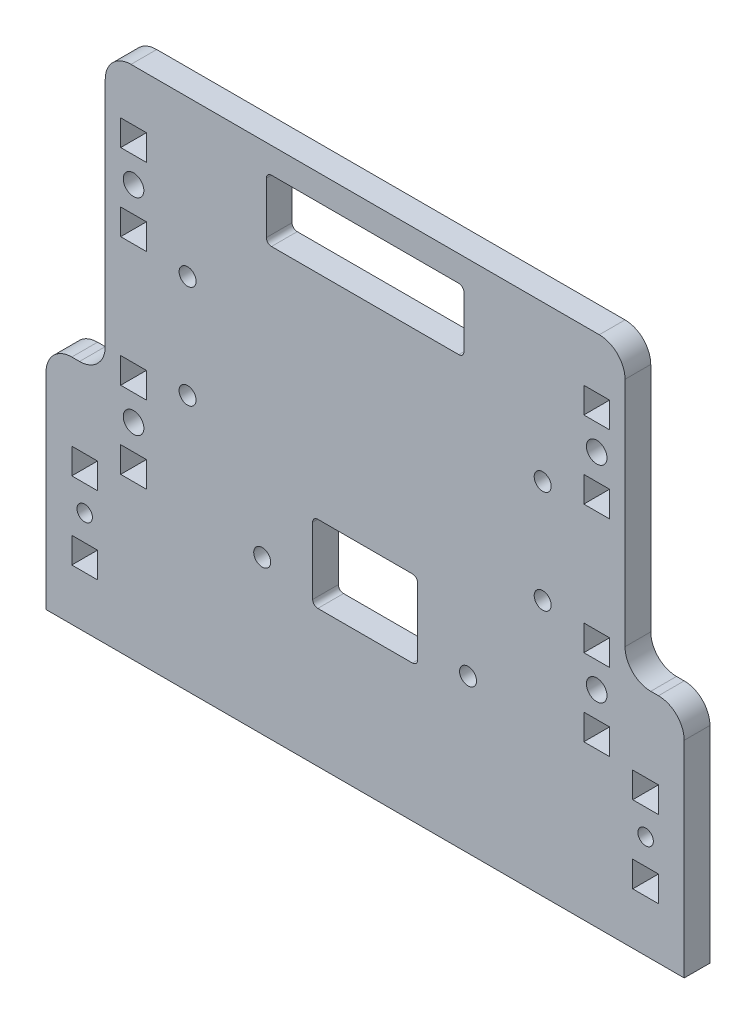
ISO-10303-21;
HEADER;
FILE_DESCRIPTION(('STEP AP214'),'2;1');
FILE_NAME('part.step','',(''),(''),'','','');
FILE_SCHEMA(('AUTOMOTIVE_DESIGN { 1 0 10303 214 1 1 1 1 }'));
ENDSEC;
DATA;
#1=APPLICATION_CONTEXT('core data for automotive mechanical design processes');
#2=APPLICATION_PROTOCOL_DEFINITION('international standard','automotive_design',2000,#1);
#3=PRODUCT_CONTEXT('',#1,'mechanical');
#4=PRODUCT('Part','Part','',(#3));
#5=PRODUCT_RELATED_PRODUCT_CATEGORY('part','',(#4));
#6=PRODUCT_DEFINITION_FORMATION('','',#4);
#7=PRODUCT_DEFINITION_CONTEXT('part definition',#1,'design');
#8=PRODUCT_DEFINITION('design','',#6,#7);
#9=PRODUCT_DEFINITION_SHAPE('','',#8);
#10=(LENGTH_UNIT() NAMED_UNIT(*) SI_UNIT(.MILLI.,.METRE.));
#11=(NAMED_UNIT(*) PLANE_ANGLE_UNIT() SI_UNIT($,.RADIAN.));
#12=(NAMED_UNIT(*) SI_UNIT($,.STERADIAN.) SOLID_ANGLE_UNIT());
#13=UNCERTAINTY_MEASURE_WITH_UNIT(LENGTH_MEASURE(1.E-05),#10,'distance_accuracy_value','');
#14=(GEOMETRIC_REPRESENTATION_CONTEXT(3) GLOBAL_UNCERTAINTY_ASSIGNED_CONTEXT((#13)) GLOBAL_UNIT_ASSIGNED_CONTEXT((#10,
#11,#12)) REPRESENTATION_CONTEXT('',''));
#15=CARTESIAN_POINT('',(0.,0.,0.));
#16=DIRECTION('',(0.,0.,1.));
#17=DIRECTION('',(1.,0.,0.));
#18=AXIS2_PLACEMENT_3D('',#15,#16,#17);
#19=CARTESIAN_POINT('',(-1.09949074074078,-38.592125,22.1286465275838));
#20=DIRECTION('',(0.,0.,1.));
#21=DIRECTION('',(1.,0.,0.));
#22=AXIS2_PLACEMENT_3D('',#19,#20,#21);
#23=PLANE('',#22);
#24=DIRECTION('',(-1.,0.,0.));
#25=VECTOR('',#24,1.);
#26=CARTESIAN_POINT('',(-71.4864030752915,-22.2700336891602,22.1286465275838));
#27=LINE('',#26,#25);
#28=CARTESIAN_POINT('',(-76.4864030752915,-22.2700336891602,22.1286465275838));
#29=VERTEX_POINT('',#28);
#30=CARTESIAN_POINT('',(-77.9864030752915,-22.2700336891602,22.1286465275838));
#31=VERTEX_POINT('',#30);
#32=EDGE_CURVE('E667',#29,#31,#27,.T.);
#33=ORIENTED_EDGE('',*,*,#32,.T.);
#34=CARTESIAN_POINT('',(-77.9864030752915,-27.2700336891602,22.1286465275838));
#35=DIRECTION('',(0.,0.,1.));
#36=DIRECTION('',(1.,0.,0.));
#37=AXIS2_PLACEMENT_3D('',#34,#35,#36);
#38=CIRCLE('',#37,5.);
#39=CARTESIAN_POINT('',(-82.9864030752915,-27.2700336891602,22.1286465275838));
#40=VERTEX_POINT('',#39);
#41=EDGE_CURVE('E1182',#31,#40,#38,.T.);
#42=ORIENTED_EDGE('',*,*,#41,.T.);
#43=DIRECTION('',(0.,-1.,0.));
#44=VECTOR('',#43,1.);
#45=CARTESIAN_POINT('',(-82.9864030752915,-22.2700336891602,22.1286465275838));
#46=LINE('',#45,#44);
#47=CARTESIAN_POINT('',(-82.9864030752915,-67.2700336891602,22.1286465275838));
#48=VERTEX_POINT('',#47);
#49=EDGE_CURVE('E690',#40,#48,#46,.T.);
#50=ORIENTED_EDGE('',*,*,#49,.T.);
#51=DIRECTION('',(1.,0.,0.));
#52=VECTOR('',#51,1.);
#53=CARTESIAN_POINT('',(-82.9864030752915,-67.2700336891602,22.1286465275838));
#54=LINE('',#53,#52);
#55=CARTESIAN_POINT('',(41.0135969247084,-67.2700336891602,22.1286465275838));
#56=VERTEX_POINT('',#55);
#57=EDGE_CURVE('E692',#48,#56,#54,.T.);
#58=ORIENTED_EDGE('',*,*,#57,.T.);
#59=DIRECTION('',(0.,1.,0.));
#60=VECTOR('',#59,1.);
#61=CARTESIAN_POINT('',(41.0135969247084,-67.2700336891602,22.1286465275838));
#62=LINE('',#61,#60);
#63=CARTESIAN_POINT('',(41.0135969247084,-27.2700336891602,22.1286465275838));
#64=VERTEX_POINT('',#63);
#65=EDGE_CURVE('E695',#56,#64,#62,.T.);
#66=ORIENTED_EDGE('',*,*,#65,.T.);
#67=CARTESIAN_POINT('',(36.0135969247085,-27.2700336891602,22.1286465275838));
#68=DIRECTION('',(0.,0.,1.));
#69=DIRECTION('',(1.,0.,0.));
#70=AXIS2_PLACEMENT_3D('',#67,#68,#69);
#71=CIRCLE('',#70,5.);
#72=CARTESIAN_POINT('',(36.0135969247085,-22.2700336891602,22.1286465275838));
#73=VERTEX_POINT('',#72);
#74=EDGE_CURVE('E1180',#64,#73,#71,.T.);
#75=ORIENTED_EDGE('',*,*,#74,.T.);
#76=DIRECTION('',(-1.,0.,0.));
#77=VECTOR('',#76,1.);
#78=CARTESIAN_POINT('',(41.0135969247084,-22.2700336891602,22.1286465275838));
#79=LINE('',#78,#77);
#80=CARTESIAN_POINT('',(34.5135969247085,-22.2700336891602,22.1286465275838));
#81=VERTEX_POINT('',#80);
#82=EDGE_CURVE('E678',#73,#81,#79,.T.);
#83=ORIENTED_EDGE('',*,*,#82,.T.);
#84=CARTESIAN_POINT('',(34.5135969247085,-17.2700336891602,22.1286465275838));
#85=DIRECTION('',(0.,0.,1.));
#86=DIRECTION('',(1.,0.,0.));
#87=AXIS2_PLACEMENT_3D('',#84,#85,#86);
#88=CIRCLE('',#87,5.);
#89=CARTESIAN_POINT('',(29.5135969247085,-17.2700336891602,22.1286465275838));
#90=VERTEX_POINT('',#89);
#91=EDGE_CURVE('E47',#81,#90,#88,.F.);
#92=ORIENTED_EDGE('',*,*,#91,.T.);
#93=DIRECTION('',(0.,1.,0.));
#94=VECTOR('',#93,1.);
#95=CARTESIAN_POINT('',(29.5135969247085,32.7299663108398,22.1286465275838));
#96=LINE('',#95,#94);
#97=CARTESIAN_POINT('',(29.5135969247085,27.7299663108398,22.1286465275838));
#98=VERTEX_POINT('',#97);
#99=EDGE_CURVE('E705',#90,#98,#96,.T.);
#100=ORIENTED_EDGE('',*,*,#99,.T.);
#101=CARTESIAN_POINT('',(24.5135969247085,27.7299663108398,22.1286465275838));
#102=DIRECTION('',(0.,0.,1.));
#103=DIRECTION('',(1.,0.,0.));
#104=AXIS2_PLACEMENT_3D('',#101,#102,#103);
#105=CIRCLE('',#104,5.);
#106=CARTESIAN_POINT('',(24.5135969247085,32.7299663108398,22.1286465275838));
#107=VERTEX_POINT('',#106);
#108=EDGE_CURVE('E1160',#98,#107,#105,.T.);
#109=ORIENTED_EDGE('',*,*,#108,.T.);
#110=DIRECTION('',(-1.,0.,0.));
#111=VECTOR('',#110,1.);
#112=CARTESIAN_POINT('',(-60.4864030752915,32.7299663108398,22.1286465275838));
#113=LINE('',#112,#111);
#114=CARTESIAN_POINT('',(-66.4864030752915,32.7299663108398,22.1286465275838));
#115=VERTEX_POINT('',#114);
#116=EDGE_CURVE('E1079',#107,#115,#113,.T.);
#117=ORIENTED_EDGE('',*,*,#116,.T.);
#118=CARTESIAN_POINT('',(-66.4864030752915,27.7299663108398,22.1286465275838));
#119=DIRECTION('',(0.,0.,1.));
#120=DIRECTION('',(1.,0.,0.));
#121=AXIS2_PLACEMENT_3D('',#118,#119,#120);
#122=CIRCLE('',#121,5.);
#123=CARTESIAN_POINT('',(-71.4864030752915,27.7299663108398,22.1286465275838));
#124=VERTEX_POINT('',#123);
#125=EDGE_CURVE('E1158',#115,#124,#122,.T.);
#126=ORIENTED_EDGE('',*,*,#125,.T.);
#127=DIRECTION('',(0.,-1.,0.));
#128=VECTOR('',#127,1.);
#129=CARTESIAN_POINT('',(-71.4864030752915,32.7299663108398,22.1286465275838));
#130=LINE('',#129,#128);
#131=CARTESIAN_POINT('',(-71.4864030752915,-17.2700336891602,22.1286465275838));
#132=VERTEX_POINT('',#131);
#133=EDGE_CURVE('E982',#124,#132,#130,.T.);
#134=ORIENTED_EDGE('',*,*,#133,.T.);
#135=CARTESIAN_POINT('',(-76.4864030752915,-17.2700336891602,22.1286465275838));
#136=DIRECTION('',(0.,0.,1.));
#137=DIRECTION('',(1.,0.,0.));
#138=AXIS2_PLACEMENT_3D('',#135,#136,#137);
#139=CIRCLE('',#138,5.);
#140=EDGE_CURVE('E1202',#132,#29,#139,.F.);
#141=ORIENTED_EDGE('',*,*,#140,.T.);
#142=EDGE_LOOP('',(#33,#42,#50,#58,#66,#75,#83,#92,#100,#109,#117,#126,#134,#141));
#143=FACE_BOUND('',#142,.T.);
#144=CARTESIAN_POINT('',(13.5135969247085,-17.4700336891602,22.1286465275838));
#145=DIRECTION('',(0.,0.,1.));
#146=DIRECTION('',(1.,0.,0.));
#147=AXIS2_PLACEMENT_3D('',#144,#145,#146);
#148=CIRCLE('',#147,1.65);
#149=CARTESIAN_POINT('',(15.1635969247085,-17.4700336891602,22.1286465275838));
#150=VERTEX_POINT('',#149);
#151=EDGE_CURVE('E1001',#150,#150,#148,.T.);
#152=ORIENTED_EDGE('',*,*,#151,.F.);
#153=EDGE_LOOP('',(#152));
#154=FACE_BOUND('',#153,.T.);
#155=CARTESIAN_POINT('',(-40.9864030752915,-37.4700336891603,22.1286465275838));
#156=DIRECTION('',(0.,0.,1.));
#157=DIRECTION('',(1.,0.,0.));
#158=AXIS2_PLACEMENT_3D('',#155,#156,#157);
#159=CIRCLE('',#158,1.65);
#160=CARTESIAN_POINT('',(-39.3364030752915,-37.4700336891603,22.1286465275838));
#161=VERTEX_POINT('',#160);
#162=EDGE_CURVE('E1013',#161,#161,#159,.T.);
#163=ORIENTED_EDGE('',*,*,#162,.F.);
#164=EDGE_LOOP('',(#163));
#165=FACE_BOUND('',#164,.T.);
#166=CARTESIAN_POINT('',(-55.4864030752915,2.52996631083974,22.1286465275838));
#167=DIRECTION('',(0.,0.,1.));
#168=DIRECTION('',(1.,0.,0.));
#169=AXIS2_PLACEMENT_3D('',#166,#167,#168);
#170=CIRCLE('',#169,1.65);
#171=CARTESIAN_POINT('',(-53.8364030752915,2.52996631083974,22.1286465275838));
#172=VERTEX_POINT('',#171);
#173=EDGE_CURVE('E1025',#172,#172,#170,.T.);
#174=ORIENTED_EDGE('',*,*,#173,.F.);
#175=EDGE_LOOP('',(#174));
#176=FACE_BOUND('',#175,.T.);
#177=DIRECTION('',(1.,0.,0.));
#178=VECTOR('',#177,1.);
#179=CARTESIAN_POINT('',(-31.1864030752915,-40.6700336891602,22.1286465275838));
#180=LINE('',#179,#178);
#181=CARTESIAN_POINT('',(-30.1864030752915,-40.6700336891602,22.1286465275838));
#182=VERTEX_POINT('',#181);
#183=CARTESIAN_POINT('',(-11.7864030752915,-40.6700336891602,22.1286465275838));
#184=VERTEX_POINT('',#183);
#185=EDGE_CURVE('E1058',#182,#184,#180,.T.);
#186=ORIENTED_EDGE('',*,*,#185,.F.);
#187=CARTESIAN_POINT('',(-30.1864030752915,-39.6700336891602,22.1286465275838));
#188=DIRECTION('',(0.,0.,1.));
#189=DIRECTION('',(1.,0.,0.));
#190=AXIS2_PLACEMENT_3D('',#187,#188,#189);
#191=CIRCLE('',#190,1.);
#192=CARTESIAN_POINT('',(-31.1864030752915,-39.6700336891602,22.1286465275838));
#193=VERTEX_POINT('',#192);
#194=EDGE_CURVE('E1126',#182,#193,#191,.F.);
#195=ORIENTED_EDGE('',*,*,#194,.T.);
#196=DIRECTION('',(0.,-1.,0.));
#197=VECTOR('',#196,1.);
#198=CARTESIAN_POINT('',(-31.1864030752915,-25.6700336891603,22.1286465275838));
#199=LINE('',#198,#197);
#200=CARTESIAN_POINT('',(-31.1864030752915,-26.6700336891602,22.1286465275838));
#201=VERTEX_POINT('',#200);
#202=EDGE_CURVE('E1055',#201,#193,#199,.T.);
#203=ORIENTED_EDGE('',*,*,#202,.F.);
#204=CARTESIAN_POINT('',(-30.1864030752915,-26.6700336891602,22.1286465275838));
#205=DIRECTION('',(0.,0.,1.));
#206=DIRECTION('',(1.,0.,0.));
#207=AXIS2_PLACEMENT_3D('',#204,#205,#206);
#208=CIRCLE('',#207,1.);
#209=CARTESIAN_POINT('',(-30.1864030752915,-25.6700336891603,22.1286465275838));
#210=VERTEX_POINT('',#209);
#211=EDGE_CURVE('E1138',#201,#210,#208,.F.);
#212=ORIENTED_EDGE('',*,*,#211,.T.);
#213=DIRECTION('',(-1.,0.,0.));
#214=VECTOR('',#213,1.);
#215=CARTESIAN_POINT('',(-31.1864030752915,-25.6700336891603,22.1286465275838));
#216=LINE('',#215,#214);
#217=CARTESIAN_POINT('',(-11.7864030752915,-25.6700336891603,22.1286465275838));
#218=VERTEX_POINT('',#217);
#219=EDGE_CURVE('E1065',#218,#210,#216,.T.);
#220=ORIENTED_EDGE('',*,*,#219,.F.);
#221=CARTESIAN_POINT('',(-11.7864030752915,-26.6700336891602,22.1286465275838));
#222=DIRECTION('',(0.,0.,1.));
#223=DIRECTION('',(1.,0.,0.));
#224=AXIS2_PLACEMENT_3D('',#221,#222,#223);
#225=CIRCLE('',#224,1.);
#226=CARTESIAN_POINT('',(-10.7864030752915,-26.6700336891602,22.1286465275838));
#227=VERTEX_POINT('',#226);
#228=EDGE_CURVE('E1134',#218,#227,#225,.F.);
#229=ORIENTED_EDGE('',*,*,#228,.T.);
#230=DIRECTION('',(0.,1.,0.));
#231=VECTOR('',#230,1.);
#232=CARTESIAN_POINT('',(-10.7864030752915,-25.6700336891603,22.1286465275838));
#233=LINE('',#232,#231);
#234=CARTESIAN_POINT('',(-10.7864030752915,-39.6700336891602,22.1286465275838));
#235=VERTEX_POINT('',#234);
#236=EDGE_CURVE('E1062',#235,#227,#233,.T.);
#237=ORIENTED_EDGE('',*,*,#236,.F.);
#238=CARTESIAN_POINT('',(-11.7864030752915,-39.6700336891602,22.1286465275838));
#239=DIRECTION('',(0.,0.,1.));
#240=DIRECTION('',(1.,0.,0.));
#241=AXIS2_PLACEMENT_3D('',#238,#239,#240);
#242=CIRCLE('',#241,1.);
#243=EDGE_CURVE('E1130',#235,#184,#242,.F.);
#244=ORIENTED_EDGE('',*,*,#243,.T.);
#245=EDGE_LOOP('',(#186,#195,#203,#212,#220,#229,#237,#244));
#246=FACE_BOUND('',#245,.T.);
#247=DIRECTION('',(1.,0.,0.));
#248=VECTOR('',#247,1.);
#249=CARTESIAN_POINT('',(-40.1864030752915,15.7299663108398,22.1286465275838));
#250=LINE('',#249,#248);
#251=CARTESIAN_POINT('',(-39.1864030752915,15.7299663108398,22.1286465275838));
#252=VERTEX_POINT('',#251);
#253=CARTESIAN_POINT('',(-2.78640307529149,15.7299663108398,22.1286465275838));
#254=VERTEX_POINT('',#253);
#255=EDGE_CURVE('E1034',#252,#254,#250,.T.);
#256=ORIENTED_EDGE('',*,*,#255,.F.);
#257=CARTESIAN_POINT('',(-39.1864030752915,16.7299663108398,22.1286465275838));
#258=DIRECTION('',(0.,0.,1.));
#259=DIRECTION('',(1.,0.,0.));
#260=AXIS2_PLACEMENT_3D('',#257,#258,#259);
#261=CIRCLE('',#260,1.);
#262=CARTESIAN_POINT('',(-40.1864030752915,16.7299663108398,22.1286465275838));
#263=VERTEX_POINT('',#262);
#264=EDGE_CURVE('E1146',#252,#263,#261,.F.);
#265=ORIENTED_EDGE('',*,*,#264,.T.);
#266=DIRECTION('',(0.,-1.,0.));
#267=VECTOR('',#266,1.);
#268=CARTESIAN_POINT('',(-40.1864030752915,27.7299663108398,22.1286465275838));
#269=LINE('',#268,#267);
#270=CARTESIAN_POINT('',(-40.1864030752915,26.7299663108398,22.1286465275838));
#271=VERTEX_POINT('',#270);
#272=EDGE_CURVE('E1031',#271,#263,#269,.T.);
#273=ORIENTED_EDGE('',*,*,#272,.F.);
#274=CARTESIAN_POINT('',(-39.1864030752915,26.7299663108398,22.1286465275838));
#275=DIRECTION('',(0.,0.,1.));
#276=DIRECTION('',(1.,0.,0.));
#277=AXIS2_PLACEMENT_3D('',#274,#275,#276);
#278=CIRCLE('',#277,1.);
#279=CARTESIAN_POINT('',(-39.1864030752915,27.7299663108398,22.1286465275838));
#280=VERTEX_POINT('',#279);
#281=EDGE_CURVE('E1142',#271,#280,#278,.F.);
#282=ORIENTED_EDGE('',*,*,#281,.T.);
#283=DIRECTION('',(-1.,0.,0.));
#284=VECTOR('',#283,1.);
#285=CARTESIAN_POINT('',(-40.1864030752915,27.7299663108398,22.1286465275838));
#286=LINE('',#285,#284);
#287=CARTESIAN_POINT('',(-2.7864030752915,27.7299663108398,22.1286465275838));
#288=VERTEX_POINT('',#287);
#289=EDGE_CURVE('E1041',#288,#280,#286,.T.);
#290=ORIENTED_EDGE('',*,*,#289,.F.);
#291=CARTESIAN_POINT('',(-2.7864030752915,26.7299663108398,22.1286465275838));
#292=DIRECTION('',(0.,0.,1.));
#293=DIRECTION('',(1.,0.,0.));
#294=AXIS2_PLACEMENT_3D('',#291,#292,#293);
#295=CIRCLE('',#294,1.);
#296=CARTESIAN_POINT('',(-1.7864030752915,26.7299663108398,22.1286465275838));
#297=VERTEX_POINT('',#296);
#298=EDGE_CURVE('E1154',#288,#297,#295,.F.);
#299=ORIENTED_EDGE('',*,*,#298,.T.);
#300=DIRECTION('',(0.,1.,0.));
#301=VECTOR('',#300,1.);
#302=CARTESIAN_POINT('',(-1.7864030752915,27.7299663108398,22.1286465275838));
#303=LINE('',#302,#301);
#304=CARTESIAN_POINT('',(-1.78640307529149,16.7299663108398,22.1286465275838));
#305=VERTEX_POINT('',#304);
#306=EDGE_CURVE('E1038',#305,#297,#303,.T.);
#307=ORIENTED_EDGE('',*,*,#306,.F.);
#308=CARTESIAN_POINT('',(-2.78640307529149,16.7299663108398,22.1286465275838));
#309=DIRECTION('',(0.,0.,1.));
#310=DIRECTION('',(1.,0.,0.));
#311=AXIS2_PLACEMENT_3D('',#308,#309,#310);
#312=CIRCLE('',#311,1.);
#313=EDGE_CURVE('E1150',#305,#254,#312,.F.);
#314=ORIENTED_EDGE('',*,*,#313,.T.);
#315=EDGE_LOOP('',(#256,#265,#273,#282,#290,#299,#307,#314));
#316=FACE_BOUND('',#315,.T.);
#317=CARTESIAN_POINT('',(-55.4864030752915,-17.4700336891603,22.1286465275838));
#318=DIRECTION('',(0.,0.,1.));
#319=DIRECTION('',(1.,0.,0.));
#320=AXIS2_PLACEMENT_3D('',#317,#318,#319);
#321=CIRCLE('',#320,1.65);
#322=CARTESIAN_POINT('',(-53.8364030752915,-17.4700336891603,22.1286465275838));
#323=VERTEX_POINT('',#322);
#324=EDGE_CURVE('E1019',#323,#323,#321,.T.);
#325=ORIENTED_EDGE('',*,*,#324,.F.);
#326=EDGE_LOOP('',(#325));
#327=FACE_BOUND('',#326,.T.);
#328=CARTESIAN_POINT('',(-0.986403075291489,-37.4700336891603,22.1286465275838));
#329=DIRECTION('',(0.,0.,1.));
#330=DIRECTION('',(1.,0.,0.));
#331=AXIS2_PLACEMENT_3D('',#328,#329,#330);
#332=CIRCLE('',#331,1.65);
#333=CARTESIAN_POINT('',(0.663596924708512,-37.4700336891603,22.1286465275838));
#334=VERTEX_POINT('',#333);
#335=EDGE_CURVE('E1007',#334,#334,#332,.T.);
#336=ORIENTED_EDGE('',*,*,#335,.F.);
#337=EDGE_LOOP('',(#336));
#338=FACE_BOUND('',#337,.T.);
#339=CARTESIAN_POINT('',(13.5135969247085,2.52996631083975,22.1286465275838));
#340=DIRECTION('',(0.,0.,1.));
#341=DIRECTION('',(1.,0.,0.));
#342=AXIS2_PLACEMENT_3D('',#339,#340,#341);
#343=CIRCLE('',#342,1.65);
#344=CARTESIAN_POINT('',(15.1635969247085,2.52996631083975,22.1286465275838));
#345=VERTEX_POINT('',#344);
#346=EDGE_CURVE('E995',#345,#345,#343,.T.);
#347=ORIENTED_EDGE('',*,*,#346,.F.);
#348=EDGE_LOOP('',(#347));
#349=FACE_BOUND('',#348,.T.);
#350=CARTESIAN_POINT('',(-65.9864030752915,-27.2700336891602,22.1286465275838));
#351=DIRECTION('',(0.,0.,1.));
#352=DIRECTION('',(1.,0.,0.));
#353=AXIS2_PLACEMENT_3D('',#350,#351,#352);
#354=CIRCLE('',#353,2.);
#355=CARTESIAN_POINT('',(-63.9864030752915,-27.2700336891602,22.1286465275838));
#356=VERTEX_POINT('',#355);
#357=EDGE_CURVE('E846',#356,#356,#354,.T.);
#358=ORIENTED_EDGE('',*,*,#357,.F.);
#359=EDGE_LOOP('',(#358));
#360=FACE_BOUND('',#359,.T.);
#361=DIRECTION('',(0.,-1.,0.));
#362=VECTOR('',#361,1.);
#363=CARTESIAN_POINT('',(-68.4864030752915,-32.2700336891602,22.1286465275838));
#364=LINE('',#363,#362);
#365=CARTESIAN_POINT('',(-68.4864030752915,-32.2700336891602,22.1286465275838));
#366=VERTEX_POINT('',#365);
#367=CARTESIAN_POINT('',(-68.4864030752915,-37.2700336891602,22.1286465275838));
#368=VERTEX_POINT('',#367);
#369=EDGE_CURVE('E870',#366,#368,#364,.T.);
#370=ORIENTED_EDGE('',*,*,#369,.F.);
#371=DIRECTION('',(-1.,0.,0.));
#372=VECTOR('',#371,1.);
#373=CARTESIAN_POINT('',(-63.4864030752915,-32.2700336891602,22.1286465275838));
#374=LINE('',#373,#372);
#375=CARTESIAN_POINT('',(-63.4864030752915,-32.2700336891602,22.1286465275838));
#376=VERTEX_POINT('',#375);
#377=EDGE_CURVE('E852',#376,#366,#374,.T.);
#378=ORIENTED_EDGE('',*,*,#377,.F.);
#379=DIRECTION('',(0.,1.,0.));
#380=VECTOR('',#379,1.);
#381=CARTESIAN_POINT('',(-63.4864030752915,-32.2700336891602,22.1286465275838));
#382=LINE('',#381,#380);
#383=CARTESIAN_POINT('',(-63.4864030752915,-37.2700336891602,22.1286465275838));
#384=VERTEX_POINT('',#383);
#385=EDGE_CURVE('E859',#384,#376,#382,.T.);
#386=ORIENTED_EDGE('',*,*,#385,.F.);
#387=DIRECTION('',(1.,0.,0.));
#388=VECTOR('',#387,1.);
#389=CARTESIAN_POINT('',(-63.4864030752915,-37.2700336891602,22.1286465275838));
#390=LINE('',#389,#388);
#391=EDGE_CURVE('E873',#368,#384,#390,.T.);
#392=ORIENTED_EDGE('',*,*,#391,.F.);
#393=EDGE_LOOP('',(#370,#378,#386,#392));
#394=FACE_BOUND('',#393,.T.);
#395=DIRECTION('',(0.,1.,0.));
#396=VECTOR('',#395,1.);
#397=CARTESIAN_POINT('',(-63.4864030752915,-22.2700336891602,22.1286465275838));
#398=LINE('',#397,#396);
#399=CARTESIAN_POINT('',(-63.4864030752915,-22.2700336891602,22.1286465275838));
#400=VERTEX_POINT('',#399);
#401=CARTESIAN_POINT('',(-63.4864030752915,-17.2700336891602,22.1286465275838));
#402=VERTEX_POINT('',#401);
#403=EDGE_CURVE('E902',#400,#402,#398,.T.);
#404=ORIENTED_EDGE('',*,*,#403,.F.);
#405=DIRECTION('',(1.,0.,0.));
#406=VECTOR('',#405,1.);
#407=CARTESIAN_POINT('',(-63.4864030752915,-22.2700336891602,22.1286465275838));
#408=LINE('',#407,#406);
#409=CARTESIAN_POINT('',(-68.4864030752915,-22.2700336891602,22.1286465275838));
#410=VERTEX_POINT('',#409);
#411=EDGE_CURVE('E880',#410,#400,#408,.T.);
#412=ORIENTED_EDGE('',*,*,#411,.F.);
#413=DIRECTION('',(0.,-1.,0.));
#414=VECTOR('',#413,1.);
#415=CARTESIAN_POINT('',(-68.4864030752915,-22.2700336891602,22.1286465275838));
#416=LINE('',#415,#414);
#417=CARTESIAN_POINT('',(-68.4864030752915,-17.2700336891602,22.1286465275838));
#418=VERTEX_POINT('',#417);
#419=EDGE_CURVE('E891',#418,#410,#416,.T.);
#420=ORIENTED_EDGE('',*,*,#419,.F.);
#421=DIRECTION('',(-1.,0.,0.));
#422=VECTOR('',#421,1.);
#423=CARTESIAN_POINT('',(-63.4864030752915,-17.2700336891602,22.1286465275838));
#424=LINE('',#423,#422);
#425=EDGE_CURVE('E905',#402,#418,#424,.T.);
#426=ORIENTED_EDGE('',*,*,#425,.F.);
#427=EDGE_LOOP('',(#404,#412,#420,#426));
#428=FACE_BOUND('',#427,.T.);
#429=CARTESIAN_POINT('',(-65.9864030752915,12.7299663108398,22.1286465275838));
#430=DIRECTION('',(0.,0.,1.));
#431=DIRECTION('',(1.,0.,0.));
#432=AXIS2_PLACEMENT_3D('',#429,#430,#431);
#433=CIRCLE('',#432,2.);
#434=CARTESIAN_POINT('',(-63.9864030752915,12.7299663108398,22.1286465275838));
#435=VERTEX_POINT('',#434);
#436=EDGE_CURVE('E912',#435,#435,#433,.T.);
#437=ORIENTED_EDGE('',*,*,#436,.F.);
#438=EDGE_LOOP('',(#437));
#439=FACE_BOUND('',#438,.T.);
#440=DIRECTION('',(0.,-1.,0.));
#441=VECTOR('',#440,1.);
#442=CARTESIAN_POINT('',(-68.4864030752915,7.72996631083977,22.1286465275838));
#443=LINE('',#442,#441);
#444=CARTESIAN_POINT('',(-68.4864030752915,7.72996631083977,22.1286465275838));
#445=VERTEX_POINT('',#444);
#446=CARTESIAN_POINT('',(-68.4864030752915,2.72996631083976,22.1286465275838));
#447=VERTEX_POINT('',#446);
#448=EDGE_CURVE('E940',#445,#447,#443,.T.);
#449=ORIENTED_EDGE('',*,*,#448,.F.);
#450=DIRECTION('',(-1.,0.,0.));
#451=VECTOR('',#450,1.);
#452=CARTESIAN_POINT('',(-63.4864030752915,7.72996631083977,22.1286465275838));
#453=LINE('',#452,#451);
#454=CARTESIAN_POINT('',(-63.4864030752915,7.72996631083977,22.1286465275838));
#455=VERTEX_POINT('',#454);
#456=EDGE_CURVE('E922',#455,#445,#453,.T.);
#457=ORIENTED_EDGE('',*,*,#456,.F.);
#458=DIRECTION('',(0.,1.,0.));
#459=VECTOR('',#458,1.);
#460=CARTESIAN_POINT('',(-63.4864030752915,7.72996631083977,22.1286465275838));
#461=LINE('',#460,#459);
#462=CARTESIAN_POINT('',(-63.4864030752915,2.72996631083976,22.1286465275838));
#463=VERTEX_POINT('',#462);
#464=EDGE_CURVE('E929',#463,#455,#461,.T.);
#465=ORIENTED_EDGE('',*,*,#464,.F.);
#466=DIRECTION('',(1.,0.,0.));
#467=VECTOR('',#466,1.);
#468=CARTESIAN_POINT('',(-63.4864030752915,2.72996631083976,22.1286465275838));
#469=LINE('',#468,#467);
#470=EDGE_CURVE('E943',#447,#463,#469,.T.);
#471=ORIENTED_EDGE('',*,*,#470,.F.);
#472=EDGE_LOOP('',(#449,#457,#465,#471));
#473=FACE_BOUND('',#472,.T.);
#474=DIRECTION('',(0.,1.,0.));
#475=VECTOR('',#474,1.);
#476=CARTESIAN_POINT('',(-63.4864030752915,17.7299663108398,22.1286465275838));
#477=LINE('',#476,#475);
#478=CARTESIAN_POINT('',(-63.4864030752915,17.7299663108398,22.1286465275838));
#479=VERTEX_POINT('',#478);
#480=CARTESIAN_POINT('',(-63.4864030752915,22.7299663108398,22.1286465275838));
#481=VERTEX_POINT('',#480);
#482=EDGE_CURVE('E972',#479,#481,#477,.T.);
#483=ORIENTED_EDGE('',*,*,#482,.F.);
#484=DIRECTION('',(1.,0.,0.));
#485=VECTOR('',#484,1.);
#486=CARTESIAN_POINT('',(-63.4864030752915,17.7299663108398,22.1286465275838));
#487=LINE('',#486,#485);
#488=CARTESIAN_POINT('',(-68.4864030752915,17.7299663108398,22.1286465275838));
#489=VERTEX_POINT('',#488);
#490=EDGE_CURVE('E950',#489,#479,#487,.T.);
#491=ORIENTED_EDGE('',*,*,#490,.F.);
#492=DIRECTION('',(0.,-1.,0.));
#493=VECTOR('',#492,1.);
#494=CARTESIAN_POINT('',(-68.4864030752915,17.7299663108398,22.1286465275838));
#495=LINE('',#494,#493);
#496=CARTESIAN_POINT('',(-68.4864030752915,22.7299663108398,22.1286465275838));
#497=VERTEX_POINT('',#496);
#498=EDGE_CURVE('E961',#497,#489,#495,.T.);
#499=ORIENTED_EDGE('',*,*,#498,.F.);
#500=DIRECTION('',(-1.,0.,0.));
#501=VECTOR('',#500,1.);
#502=CARTESIAN_POINT('',(-63.4864030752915,22.7299663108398,22.1286465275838));
#503=LINE('',#502,#501);
#504=EDGE_CURVE('E975',#481,#497,#503,.T.);
#505=ORIENTED_EDGE('',*,*,#504,.F.);
#506=EDGE_LOOP('',(#483,#491,#499,#505));
#507=FACE_BOUND('',#506,.T.);
#508=CARTESIAN_POINT('',(24.0135969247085,12.7299663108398,22.1286465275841));
#509=DIRECTION('',(0.,0.,1.));
#510=DIRECTION('',(-1.,0.,0.));
#511=AXIS2_PLACEMENT_3D('',#508,#509,#510);
#512=CIRCLE('',#511,2.);
#513=CARTESIAN_POINT('',(22.0135969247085,12.7299663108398,22.1286465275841));
#514=VERTEX_POINT('',#513);
#515=EDGE_CURVE('E843',#514,#514,#512,.T.);
#516=ORIENTED_EDGE('',*,*,#515,.F.);
#517=EDGE_LOOP('',(#516));
#518=FACE_BOUND('',#517,.T.);
#519=DIRECTION('',(-1.,0.,0.));
#520=VECTOR('',#519,1.);
#521=CARTESIAN_POINT('',(21.5135969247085,7.72996631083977,22.1286465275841));
#522=LINE('',#521,#520);
#523=CARTESIAN_POINT('',(26.5135969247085,7.72996631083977,22.1286465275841));
#524=VERTEX_POINT('',#523);
#525=CARTESIAN_POINT('',(21.5135969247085,7.72996631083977,22.1286465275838));
#526=VERTEX_POINT('',#525);
#527=EDGE_CURVE('E830',#524,#526,#522,.T.);
#528=ORIENTED_EDGE('',*,*,#527,.F.);
#529=DIRECTION('',(0.,1.,0.));
#530=VECTOR('',#529,1.);
#531=CARTESIAN_POINT('',(26.5135969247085,7.72996631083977,22.1286465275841));
#532=LINE('',#531,#530);
#533=CARTESIAN_POINT('',(26.5135969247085,2.72996631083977,22.1286465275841));
#534=VERTEX_POINT('',#533);
#535=EDGE_CURVE('E820',#534,#524,#532,.T.);
#536=ORIENTED_EDGE('',*,*,#535,.F.);
#537=DIRECTION('',(1.,0.,0.));
#538=VECTOR('',#537,1.);
#539=CARTESIAN_POINT('',(21.5135969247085,2.72996631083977,22.1286465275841));
#540=LINE('',#539,#538);
#541=CARTESIAN_POINT('',(21.5135969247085,2.72996631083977,22.1286465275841));
#542=VERTEX_POINT('',#541);
#543=EDGE_CURVE('E823',#542,#534,#540,.T.);
#544=ORIENTED_EDGE('',*,*,#543,.F.);
#545=DIRECTION('',(0.,-1.,0.));
#546=VECTOR('',#545,1.);
#547=CARTESIAN_POINT('',(21.5135969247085,7.72996631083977,22.1286465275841));
#548=LINE('',#547,#546);
#549=EDGE_CURVE('E827',#526,#542,#548,.T.);
#550=ORIENTED_EDGE('',*,*,#549,.F.);
#551=EDGE_LOOP('',(#528,#536,#544,#550));
#552=FACE_BOUND('',#551,.T.);
#553=DIRECTION('',(1.,0.,0.));
#554=VECTOR('',#553,1.);
#555=CARTESIAN_POINT('',(21.5135969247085,17.7299663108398,22.1286465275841));
#556=LINE('',#555,#554);
#557=CARTESIAN_POINT('',(21.5135969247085,17.7299663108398,22.1286465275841));
#558=VERTEX_POINT('',#557);
#559=CARTESIAN_POINT('',(26.5135969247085,17.7299663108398,22.1286465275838));
#560=VERTEX_POINT('',#559);
#561=EDGE_CURVE('E798',#558,#560,#556,.T.);
#562=ORIENTED_EDGE('',*,*,#561,.F.);
#563=DIRECTION('',(0.,-1.,0.));
#564=VECTOR('',#563,1.);
#565=CARTESIAN_POINT('',(21.5135969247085,17.7299663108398,22.1286465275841));
#566=LINE('',#565,#564);
#567=CARTESIAN_POINT('',(21.5135969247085,22.7299663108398,22.1286465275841));
#568=VERTEX_POINT('',#567);
#569=EDGE_CURVE('E788',#568,#558,#566,.T.);
#570=ORIENTED_EDGE('',*,*,#569,.F.);
#571=DIRECTION('',(-1.,0.,0.));
#572=VECTOR('',#571,1.);
#573=CARTESIAN_POINT('',(21.5135969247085,22.7299663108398,22.1286465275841));
#574=LINE('',#573,#572);
#575=CARTESIAN_POINT('',(26.5135969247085,22.7299663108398,22.1286465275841));
#576=VERTEX_POINT('',#575);
#577=EDGE_CURVE('E791',#576,#568,#574,.T.);
#578=ORIENTED_EDGE('',*,*,#577,.F.);
#579=DIRECTION('',(0.,1.,0.));
#580=VECTOR('',#579,1.);
#581=CARTESIAN_POINT('',(26.5135969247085,17.7299663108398,22.1286465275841));
#582=LINE('',#581,#580);
#583=EDGE_CURVE('E795',#560,#576,#582,.T.);
#584=ORIENTED_EDGE('',*,*,#583,.F.);
#585=EDGE_LOOP('',(#562,#570,#578,#584));
#586=FACE_BOUND('',#585,.T.);
#587=CARTESIAN_POINT('',(24.0135969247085,-27.2700336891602,22.1286465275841));
#588=DIRECTION('',(0.,0.,1.));
#589=DIRECTION('',(-1.,0.,0.));
#590=AXIS2_PLACEMENT_3D('',#587,#588,#589);
#591=CIRCLE('',#590,2.);
#592=CARTESIAN_POINT('',(22.0135969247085,-27.2700336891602,22.1286465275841));
#593=VERTEX_POINT('',#592);
#594=EDGE_CURVE('E773',#593,#593,#591,.T.);
#595=ORIENTED_EDGE('',*,*,#594,.F.);
#596=EDGE_LOOP('',(#595));
#597=FACE_BOUND('',#596,.T.);
#598=DIRECTION('',(-1.,0.,0.));
#599=VECTOR('',#598,1.);
#600=CARTESIAN_POINT('',(21.5135969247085,-32.2700336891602,22.1286465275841));
#601=LINE('',#600,#599);
#602=CARTESIAN_POINT('',(26.5135969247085,-32.2700336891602,22.1286465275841));
#603=VERTEX_POINT('',#602);
#604=CARTESIAN_POINT('',(21.5135969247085,-32.2700336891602,22.1286465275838));
#605=VERTEX_POINT('',#604);
#606=EDGE_CURVE('E760',#603,#605,#601,.T.);
#607=ORIENTED_EDGE('',*,*,#606,.F.);
#608=DIRECTION('',(0.,1.,0.));
#609=VECTOR('',#608,1.);
#610=CARTESIAN_POINT('',(26.5135969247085,-32.2700336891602,22.1286465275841));
#611=LINE('',#610,#609);
#612=CARTESIAN_POINT('',(26.5135969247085,-37.2700336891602,22.1286465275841));
#613=VERTEX_POINT('',#612);
#614=EDGE_CURVE('E750',#613,#603,#611,.T.);
#615=ORIENTED_EDGE('',*,*,#614,.F.);
#616=DIRECTION('',(1.,0.,0.));
#617=VECTOR('',#616,1.);
#618=CARTESIAN_POINT('',(21.5135969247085,-37.2700336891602,22.1286465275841));
#619=LINE('',#618,#617);
#620=CARTESIAN_POINT('',(21.5135969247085,-37.2700336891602,22.1286465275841));
#621=VERTEX_POINT('',#620);
#622=EDGE_CURVE('E753',#621,#613,#619,.T.);
#623=ORIENTED_EDGE('',*,*,#622,.F.);
#624=DIRECTION('',(0.,-1.,0.));
#625=VECTOR('',#624,1.);
#626=CARTESIAN_POINT('',(21.5135969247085,-32.2700336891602,22.1286465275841));
#627=LINE('',#626,#625);
#628=EDGE_CURVE('E757',#605,#621,#627,.T.);
#629=ORIENTED_EDGE('',*,*,#628,.F.);
#630=EDGE_LOOP('',(#607,#615,#623,#629));
#631=FACE_BOUND('',#630,.T.);
#632=DIRECTION('',(1.,0.,0.));
#633=VECTOR('',#632,1.);
#634=CARTESIAN_POINT('',(21.5135969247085,-22.2700336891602,22.1286465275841));
#635=LINE('',#634,#633);
#636=CARTESIAN_POINT('',(21.5135969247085,-22.2700336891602,22.1286465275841));
#637=VERTEX_POINT('',#636);
#638=CARTESIAN_POINT('',(26.5135969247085,-22.2700336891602,22.1286465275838));
#639=VERTEX_POINT('',#638);
#640=EDGE_CURVE('E728',#637,#639,#635,.T.);
#641=ORIENTED_EDGE('',*,*,#640,.F.);
#642=DIRECTION('',(0.,-1.,0.));
#643=VECTOR('',#642,1.);
#644=CARTESIAN_POINT('',(21.5135969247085,-22.2700336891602,22.1286465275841));
#645=LINE('',#644,#643);
#646=CARTESIAN_POINT('',(21.5135969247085,-17.2700336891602,22.1286465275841));
#647=VERTEX_POINT('',#646);
#648=EDGE_CURVE('E718',#647,#637,#645,.T.);
#649=ORIENTED_EDGE('',*,*,#648,.F.);
#650=DIRECTION('',(-1.,0.,0.));
#651=VECTOR('',#650,1.);
#652=CARTESIAN_POINT('',(21.5135969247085,-17.2700336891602,22.1286465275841));
#653=LINE('',#652,#651);
#654=CARTESIAN_POINT('',(26.5135969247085,-17.2700336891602,22.1286465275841));
#655=VERTEX_POINT('',#654);
#656=EDGE_CURVE('E721',#655,#647,#653,.T.);
#657=ORIENTED_EDGE('',*,*,#656,.F.);
#658=DIRECTION('',(0.,1.,0.));
#659=VECTOR('',#658,1.);
#660=CARTESIAN_POINT('',(26.5135969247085,-22.2700336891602,22.1286465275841));
#661=LINE('',#660,#659);
#662=EDGE_CURVE('E725',#639,#655,#661,.T.);
#663=ORIENTED_EDGE('',*,*,#662,.F.);
#664=EDGE_LOOP('',(#641,#649,#657,#663));
#665=FACE_BOUND('',#664,.T.);
#666=CARTESIAN_POINT('',(-75.4864030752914,-47.2700336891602,22.1286465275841));
#667=DIRECTION('',(0.,0.,1.));
#668=DIRECTION('',(-1.,0.,0.));
#669=AXIS2_PLACEMENT_3D('',#666,#667,#668);
#670=CIRCLE('',#669,1.5);
#671=CARTESIAN_POINT('',(-76.9864030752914,-47.2700336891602,22.1286465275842));
#672=VERTEX_POINT('',#671);
#673=EDGE_CURVE('E555',#672,#672,#670,.T.);
#674=ORIENTED_EDGE('',*,*,#673,.F.);
#675=EDGE_LOOP('',(#674));
#676=FACE_BOUND('',#675,.T.);
#677=DIRECTION('',(-1.,0.,0.));
#678=VECTOR('',#677,1.);
#679=CARTESIAN_POINT('',(-77.9864030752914,-52.2700336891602,22.1286465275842));
#680=LINE('',#679,#678);
#681=CARTESIAN_POINT('',(-72.9864030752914,-52.2700336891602,22.1286465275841));
#682=VERTEX_POINT('',#681);
#683=CARTESIAN_POINT('',(-77.9864030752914,-52.2700336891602,22.1286465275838));
#684=VERTEX_POINT('',#683);
#685=EDGE_CURVE('E531',#682,#684,#680,.T.);
#686=ORIENTED_EDGE('',*,*,#685,.F.);
#687=DIRECTION('',(0.,1.,0.));
#688=VECTOR('',#687,1.);
#689=CARTESIAN_POINT('',(-72.9864030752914,-52.2700336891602,22.1286465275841));
#690=LINE('',#689,#688);
#691=CARTESIAN_POINT('',(-72.9864030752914,-57.2700336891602,22.1286465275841));
#692=VERTEX_POINT('',#691);
#693=EDGE_CURVE('E549',#692,#682,#690,.T.);
#694=ORIENTED_EDGE('',*,*,#693,.F.);
#695=DIRECTION('',(1.,0.,0.));
#696=VECTOR('',#695,1.);
#697=CARTESIAN_POINT('',(-77.9864030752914,-57.2700336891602,22.1286465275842));
#698=LINE('',#697,#696);
#699=CARTESIAN_POINT('',(-77.9864030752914,-57.2700336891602,22.1286465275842));
#700=VERTEX_POINT('',#699);
#701=EDGE_CURVE('E552',#700,#692,#698,.T.);
#702=ORIENTED_EDGE('',*,*,#701,.F.);
#703=DIRECTION('',(0.,-1.,0.));
#704=VECTOR('',#703,1.);
#705=CARTESIAN_POINT('',(-77.9864030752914,-52.2700336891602,22.1286465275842));
#706=LINE('',#705,#704);
#707=EDGE_CURVE('E561',#684,#700,#706,.T.);
#708=ORIENTED_EDGE('',*,*,#707,.F.);
#709=EDGE_LOOP('',(#686,#694,#702,#708));
#710=FACE_BOUND('',#709,.T.);
#711=DIRECTION('',(1.,0.,0.));
#712=VECTOR('',#711,1.);
#713=CARTESIAN_POINT('',(-77.9864030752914,-42.2700336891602,22.1286465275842));
#714=LINE('',#713,#712);
#715=CARTESIAN_POINT('',(-77.9864030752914,-42.2700336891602,22.1286465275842));
#716=VERTEX_POINT('',#715);
#717=CARTESIAN_POINT('',(-72.9864030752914,-42.2700336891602,22.1286465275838));
#718=VERTEX_POINT('',#717);
#719=EDGE_CURVE('E568',#716,#718,#714,.T.);
#720=ORIENTED_EDGE('',*,*,#719,.F.);
#721=DIRECTION('',(0.,-1.,0.));
#722=VECTOR('',#721,1.);
#723=CARTESIAN_POINT('',(-77.9864030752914,-42.2700336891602,22.1286465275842));
#724=LINE('',#723,#722);
#725=CARTESIAN_POINT('',(-77.9864030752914,-37.2700336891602,22.1286465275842));
#726=VERTEX_POINT('',#725);
#727=EDGE_CURVE('E576',#726,#716,#724,.T.);
#728=ORIENTED_EDGE('',*,*,#727,.F.);
#729=DIRECTION('',(-1.,0.,0.));
#730=VECTOR('',#729,1.);
#731=CARTESIAN_POINT('',(-77.9864030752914,-37.2700336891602,22.1286465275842));
#732=LINE('',#731,#730);
#733=CARTESIAN_POINT('',(-72.9864030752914,-37.2700336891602,22.1286465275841));
#734=VERTEX_POINT('',#733);
#735=EDGE_CURVE('E590',#734,#726,#732,.T.);
#736=ORIENTED_EDGE('',*,*,#735,.F.);
#737=DIRECTION('',(0.,1.,0.));
#738=VECTOR('',#737,1.);
#739=CARTESIAN_POINT('',(-72.9864030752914,-42.2700336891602,22.1286465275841));
#740=LINE('',#739,#738);
#741=EDGE_CURVE('E587',#718,#734,#740,.T.);
#742=ORIENTED_EDGE('',*,*,#741,.F.);
#743=EDGE_LOOP('',(#720,#728,#736,#742));
#744=FACE_BOUND('',#743,.T.);
#745=CARTESIAN_POINT('',(33.5135969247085,-47.2700336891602,22.1286465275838));
#746=DIRECTION('',(0.,0.,1.));
#747=DIRECTION('',(1.,0.,0.));
#748=AXIS2_PLACEMENT_3D('',#745,#746,#747);
#749=CIRCLE('',#748,1.5);
#750=CARTESIAN_POINT('',(35.0135969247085,-47.2700336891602,22.1286465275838));
#751=VERTEX_POINT('',#750);
#752=EDGE_CURVE('E597',#751,#751,#749,.T.);
#753=ORIENTED_EDGE('',*,*,#752,.F.);
#754=EDGE_LOOP('',(#753));
#755=FACE_BOUND('',#754,.T.);
#756=DIRECTION('',(-1.,0.,0.));
#757=VECTOR('',#756,1.);
#758=CARTESIAN_POINT('',(36.0135969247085,-52.2700336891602,22.1286465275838));
#759=LINE('',#758,#757);
#760=CARTESIAN_POINT('',(36.0135969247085,-52.2700336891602,22.1286465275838));
#761=VERTEX_POINT('',#760);
#762=CARTESIAN_POINT('',(31.0135969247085,-52.2700336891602,22.1286465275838));
#763=VERTEX_POINT('',#762);
#764=EDGE_CURVE('E607',#761,#763,#759,.T.);
#765=ORIENTED_EDGE('',*,*,#764,.F.);
#766=DIRECTION('',(0.,1.,0.));
#767=VECTOR('',#766,1.);
#768=CARTESIAN_POINT('',(36.0135969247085,-52.2700336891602,22.1286465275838));
#769=LINE('',#768,#767);
#770=CARTESIAN_POINT('',(36.0135969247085,-57.2700336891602,22.1286465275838));
#771=VERTEX_POINT('',#770);
#772=EDGE_CURVE('E614',#771,#761,#769,.T.);
#773=ORIENTED_EDGE('',*,*,#772,.F.);
#774=DIRECTION('',(1.,0.,0.));
#775=VECTOR('',#774,1.);
#776=CARTESIAN_POINT('',(36.0135969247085,-57.2700336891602,22.1286465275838));
#777=LINE('',#776,#775);
#778=CARTESIAN_POINT('',(31.0135969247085,-57.2700336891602,22.1286465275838));
#779=VERTEX_POINT('',#778);
#780=EDGE_CURVE('E628',#779,#771,#777,.T.);
#781=ORIENTED_EDGE('',*,*,#780,.F.);
#782=DIRECTION('',(0.,-1.,0.));
#783=VECTOR('',#782,1.);
#784=CARTESIAN_POINT('',(31.0135969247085,-52.2700336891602,22.1286465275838));
#785=LINE('',#784,#783);
#786=EDGE_CURVE('E625',#763,#779,#785,.T.);
#787=ORIENTED_EDGE('',*,*,#786,.F.);
#788=EDGE_LOOP('',(#765,#773,#781,#787));
#789=FACE_BOUND('',#788,.T.);
#790=DIRECTION('',(1.,0.,0.));
#791=VECTOR('',#790,1.);
#792=CARTESIAN_POINT('',(36.0135969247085,-42.2700336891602,22.1286465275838));
#793=LINE('',#792,#791);
#794=CARTESIAN_POINT('',(31.0135969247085,-42.2700336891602,22.1286465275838));
#795=VERTEX_POINT('',#794);
#796=CARTESIAN_POINT('',(36.0135969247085,-42.2700336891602,22.1286465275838));
#797=VERTEX_POINT('',#796);
#798=EDGE_CURVE('E635',#795,#797,#793,.T.);
#799=ORIENTED_EDGE('',*,*,#798,.F.);
#800=DIRECTION('',(0.,-1.,0.));
#801=VECTOR('',#800,1.);
#802=CARTESIAN_POINT('',(31.0135969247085,-42.2700336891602,22.1286465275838));
#803=LINE('',#802,#801);
#804=CARTESIAN_POINT('',(31.0135969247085,-37.2700336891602,22.1286465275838));
#805=VERTEX_POINT('',#804);
#806=EDGE_CURVE('E646',#805,#795,#803,.T.);
#807=ORIENTED_EDGE('',*,*,#806,.F.);
#808=DIRECTION('',(-1.,0.,0.));
#809=VECTOR('',#808,1.);
#810=CARTESIAN_POINT('',(36.0135969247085,-37.2700336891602,22.1286465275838));
#811=LINE('',#810,#809);
#812=CARTESIAN_POINT('',(36.0135969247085,-37.2700336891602,22.1286465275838));
#813=VERTEX_POINT('',#812);
#814=EDGE_CURVE('E660',#813,#805,#811,.T.);
#815=ORIENTED_EDGE('',*,*,#814,.F.);
#816=DIRECTION('',(0.,1.,0.));
#817=VECTOR('',#816,1.);
#818=CARTESIAN_POINT('',(36.0135969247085,-42.2700336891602,22.1286465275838));
#819=LINE('',#818,#817);
#820=EDGE_CURVE('E657',#797,#813,#819,.T.);
#821=ORIENTED_EDGE('',*,*,#820,.F.);
#822=EDGE_LOOP('',(#799,#807,#815,#821));
#823=FACE_BOUND('',#822,.T.);
#824=ADVANCED_FACE('F39',(#143,#154,#165,#176,#246,#316,#327,#338,#349,#360,#394,#428,#439,#473,
#507,#518,#552,#586,#597,#631,#665,#676,#710,#744,#755,#789,#823),#23,.T.);
#825=CARTESIAN_POINT('',(-1.09949074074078,-38.592125,17.1286465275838));
#826=DIRECTION('',(0.,0.,1.));
#827=DIRECTION('',(1.,0.,0.));
#828=AXIS2_PLACEMENT_3D('',#825,#826,#827);
#829=PLANE('',#828);
#830=DIRECTION('',(0.,-1.,0.));
#831=VECTOR('',#830,1.);
#832=CARTESIAN_POINT('',(-82.9864030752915,-22.2700336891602,17.1286465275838));
#833=LINE('',#832,#831);
#834=CARTESIAN_POINT('',(-82.9864030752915,-27.2700336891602,17.1286465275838));
#835=VERTEX_POINT('',#834);
#836=CARTESIAN_POINT('',(-82.9864030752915,-67.2700336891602,17.1286465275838));
#837=VERTEX_POINT('',#836);
#838=EDGE_CURVE('E677',#835,#837,#833,.T.);
#839=ORIENTED_EDGE('',*,*,#838,.F.);
#840=CARTESIAN_POINT('',(-77.9864030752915,-27.2700336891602,17.1286465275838));
#841=DIRECTION('',(0.,0.,1.));
#842=DIRECTION('',(1.,0.,0.));
#843=AXIS2_PLACEMENT_3D('',#840,#841,#842);
#844=CIRCLE('',#843,5.);
#845=CARTESIAN_POINT('',(-77.9864030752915,-22.2700336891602,17.1286465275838));
#846=VERTEX_POINT('',#845);
#847=EDGE_CURVE('E1187',#835,#846,#844,.F.);
#848=ORIENTED_EDGE('',*,*,#847,.T.);
#849=DIRECTION('',(-1.,0.,0.));
#850=VECTOR('',#849,1.);
#851=CARTESIAN_POINT('',(-71.4864030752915,-22.2700336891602,17.1286465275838));
#852=LINE('',#851,#850);
#853=CARTESIAN_POINT('',(-76.4864030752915,-22.2700336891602,17.1286465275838));
#854=VERTEX_POINT('',#853);
#855=EDGE_CURVE('E674',#854,#846,#852,.T.);
#856=ORIENTED_EDGE('',*,*,#855,.F.);
#857=CARTESIAN_POINT('',(-76.4864030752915,-17.2700336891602,17.1286465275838));
#858=DIRECTION('',(0.,0.,1.));
#859=DIRECTION('',(1.,0.,0.));
#860=AXIS2_PLACEMENT_3D('',#857,#858,#859);
#861=CIRCLE('',#860,5.);
#862=CARTESIAN_POINT('',(-71.4864030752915,-17.2700336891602,17.1286465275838));
#863=VERTEX_POINT('',#862);
#864=EDGE_CURVE('E1204',#854,#863,#861,.T.);
#865=ORIENTED_EDGE('',*,*,#864,.T.);
#866=DIRECTION('',(0.,-1.,0.));
#867=VECTOR('',#866,1.);
#868=CARTESIAN_POINT('',(-71.4864030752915,32.7299663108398,17.1286465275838));
#869=LINE('',#868,#867);
#870=CARTESIAN_POINT('',(-71.4864030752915,27.7299663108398,17.1286465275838));
#871=VERTEX_POINT('',#870);
#872=EDGE_CURVE('E989',#871,#863,#869,.T.);
#873=ORIENTED_EDGE('',*,*,#872,.F.);
#874=CARTESIAN_POINT('',(-66.4864030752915,27.7299663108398,17.1286465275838));
#875=DIRECTION('',(0.,0.,1.));
#876=DIRECTION('',(1.,0.,0.));
#877=AXIS2_PLACEMENT_3D('',#874,#875,#876);
#878=CIRCLE('',#877,5.);
#879=CARTESIAN_POINT('',(-66.4864030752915,32.7299663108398,17.1286465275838));
#880=VERTEX_POINT('',#879);
#881=EDGE_CURVE('E1162',#871,#880,#878,.F.);
#882=ORIENTED_EDGE('',*,*,#881,.T.);
#883=DIRECTION('',(-1.,0.,0.));
#884=VECTOR('',#883,1.);
#885=CARTESIAN_POINT('',(-60.4864030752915,32.7299663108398,17.1286465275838));
#886=LINE('',#885,#884);
#887=CARTESIAN_POINT('',(24.5135969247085,32.7299663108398,17.1286465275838));
#888=VERTEX_POINT('',#887);
#889=EDGE_CURVE('E1068',#888,#880,#886,.T.);
#890=ORIENTED_EDGE('',*,*,#889,.F.);
#891=CARTESIAN_POINT('',(24.5135969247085,27.7299663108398,17.1286465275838));
#892=DIRECTION('',(0.,0.,1.));
#893=DIRECTION('',(1.,0.,0.));
#894=AXIS2_PLACEMENT_3D('',#891,#892,#893);
#895=CIRCLE('',#894,5.);
#896=CARTESIAN_POINT('',(29.5135969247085,27.7299663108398,17.1286465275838));
#897=VERTEX_POINT('',#896);
#898=EDGE_CURVE('E1164',#888,#897,#895,.F.);
#899=ORIENTED_EDGE('',*,*,#898,.T.);
#900=DIRECTION('',(0.,1.,0.));
#901=VECTOR('',#900,1.);
#902=CARTESIAN_POINT('',(29.5135969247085,32.7299663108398,17.1286465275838));
#903=LINE('',#902,#901);
#904=CARTESIAN_POINT('',(29.5135969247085,-17.2700336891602,17.1286465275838));
#905=VERTEX_POINT('',#904);
#906=EDGE_CURVE('E702',#905,#897,#903,.T.);
#907=ORIENTED_EDGE('',*,*,#906,.F.);
#908=CARTESIAN_POINT('',(34.5135969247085,-17.2700336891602,17.1286465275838));
#909=DIRECTION('',(0.,0.,1.));
#910=DIRECTION('',(1.,0.,0.));
#911=AXIS2_PLACEMENT_3D('',#908,#909,#910);
#912=CIRCLE('',#911,5.);
#913=CARTESIAN_POINT('',(34.5135969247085,-22.2700336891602,17.1286465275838));
#914=VERTEX_POINT('',#913);
#915=EDGE_CURVE('E11',#905,#914,#912,.T.);
#916=ORIENTED_EDGE('',*,*,#915,.T.);
#917=DIRECTION('',(-1.,0.,0.));
#918=VECTOR('',#917,1.);
#919=CARTESIAN_POINT('',(41.0135969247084,-22.2700336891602,17.1286465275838));
#920=LINE('',#919,#918);
#921=CARTESIAN_POINT('',(36.0135969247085,-22.2700336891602,17.1286465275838));
#922=VERTEX_POINT('',#921);
#923=EDGE_CURVE('E685',#922,#914,#920,.T.);
#924=ORIENTED_EDGE('',*,*,#923,.F.);
#925=CARTESIAN_POINT('',(36.0135969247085,-27.2700336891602,17.1286465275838));
#926=DIRECTION('',(0.,0.,1.));
#927=DIRECTION('',(1.,0.,0.));
#928=AXIS2_PLACEMENT_3D('',#925,#926,#927);
#929=CIRCLE('',#928,5.);
#930=CARTESIAN_POINT('',(41.0135969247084,-27.2700336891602,17.1286465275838));
#931=VERTEX_POINT('',#930);
#932=EDGE_CURVE('E54',#922,#931,#929,.F.);
#933=ORIENTED_EDGE('',*,*,#932,.T.);
#934=DIRECTION('',(0.,1.,0.));
#935=VECTOR('',#934,1.);
#936=CARTESIAN_POINT('',(41.0135969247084,-67.2700336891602,17.1286465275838));
#937=LINE('',#936,#935);
#938=CARTESIAN_POINT('',(41.0135969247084,-67.2700336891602,17.1286465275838));
#939=VERTEX_POINT('',#938);
#940=EDGE_CURVE('E683',#939,#931,#937,.T.);
#941=ORIENTED_EDGE('',*,*,#940,.F.);
#942=DIRECTION('',(1.,0.,0.));
#943=VECTOR('',#942,1.);
#944=CARTESIAN_POINT('',(-82.9864030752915,-67.2700336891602,17.1286465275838));
#945=LINE('',#944,#943);
#946=EDGE_CURVE('E680',#837,#939,#945,.T.);
#947=ORIENTED_EDGE('',*,*,#946,.F.);
#948=EDGE_LOOP('',(#839,#848,#856,#865,#873,#882,#890,#899,#907,#916,#924,#933,#941,#947));
#949=FACE_BOUND('',#948,.T.);
#950=DIRECTION('',(-1.,0.,0.));
#951=VECTOR('',#950,1.);
#952=CARTESIAN_POINT('',(-31.1864030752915,-25.6700336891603,17.1286465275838));
#953=LINE('',#952,#951);
#954=CARTESIAN_POINT('',(-11.7864030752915,-25.6700336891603,17.1286465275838));
#955=VERTEX_POINT('',#954);
#956=CARTESIAN_POINT('',(-30.1864030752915,-25.6700336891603,17.1286465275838));
#957=VERTEX_POINT('',#956);
#958=EDGE_CURVE('E1059',#955,#957,#953,.T.);
#959=ORIENTED_EDGE('',*,*,#958,.T.);
#960=CARTESIAN_POINT('',(-30.1864030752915,-26.6700336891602,17.1286465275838));
#961=DIRECTION('',(0.,0.,1.));
#962=DIRECTION('',(1.,0.,0.));
#963=AXIS2_PLACEMENT_3D('',#960,#961,#962);
#964=CIRCLE('',#963,1.);
#965=CARTESIAN_POINT('',(-31.1864030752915,-26.6700336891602,17.1286465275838));
#966=VERTEX_POINT('',#965);
#967=EDGE_CURVE('E1136',#957,#966,#964,.T.);
#968=ORIENTED_EDGE('',*,*,#967,.T.);
#969=DIRECTION('',(0.,-1.,0.));
#970=VECTOR('',#969,1.);
#971=CARTESIAN_POINT('',(-31.1864030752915,-25.6700336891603,17.1286465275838));
#972=LINE('',#971,#970);
#973=CARTESIAN_POINT('',(-31.1864030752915,-39.6700336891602,17.1286465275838));
#974=VERTEX_POINT('',#973);
#975=EDGE_CURVE('E1044',#966,#974,#972,.T.);
#976=ORIENTED_EDGE('',*,*,#975,.T.);
#977=CARTESIAN_POINT('',(-30.1864030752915,-39.6700336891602,17.1286465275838));
#978=DIRECTION('',(0.,0.,1.));
#979=DIRECTION('',(1.,0.,0.));
#980=AXIS2_PLACEMENT_3D('',#977,#978,#979);
#981=CIRCLE('',#980,1.);
#982=CARTESIAN_POINT('',(-30.1864030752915,-40.6700336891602,17.1286465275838));
#983=VERTEX_POINT('',#982);
#984=EDGE_CURVE('E1124',#974,#983,#981,.T.);
#985=ORIENTED_EDGE('',*,*,#984,.T.);
#986=DIRECTION('',(1.,0.,0.));
#987=VECTOR('',#986,1.);
#988=CARTESIAN_POINT('',(-31.1864030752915,-40.6700336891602,17.1286465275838));
#989=LINE('',#988,#987);
#990=CARTESIAN_POINT('',(-11.7864030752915,-40.6700336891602,17.1286465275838));
#991=VERTEX_POINT('',#990);
#992=EDGE_CURVE('E1071',#983,#991,#989,.T.);
#993=ORIENTED_EDGE('',*,*,#992,.T.);
#994=CARTESIAN_POINT('',(-11.7864030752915,-39.6700336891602,17.1286465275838));
#995=DIRECTION('',(0.,0.,1.));
#996=DIRECTION('',(1.,0.,0.));
#997=AXIS2_PLACEMENT_3D('',#994,#995,#996);
#998=CIRCLE('',#997,1.);
#999=CARTESIAN_POINT('',(-10.7864030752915,-39.6700336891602,17.1286465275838));
#1000=VERTEX_POINT('',#999);
#1001=EDGE_CURVE('E1128',#991,#1000,#998,.T.);
#1002=ORIENTED_EDGE('',*,*,#1001,.T.);
#1003=DIRECTION('',(0.,1.,0.));
#1004=VECTOR('',#1003,1.);
#1005=CARTESIAN_POINT('',(-10.7864030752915,-25.6700336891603,17.1286465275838));
#1006=LINE('',#1005,#1004);
#1007=CARTESIAN_POINT('',(-10.7864030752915,-26.6700336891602,17.1286465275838));
#1008=VERTEX_POINT('',#1007);
#1009=EDGE_CURVE('E1074',#1000,#1008,#1006,.T.);
#1010=ORIENTED_EDGE('',*,*,#1009,.T.);
#1011=CARTESIAN_POINT('',(-11.7864030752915,-26.6700336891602,17.1286465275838));
#1012=DIRECTION('',(0.,0.,1.));
#1013=DIRECTION('',(1.,0.,0.));
#1014=AXIS2_PLACEMENT_3D('',#1011,#1012,#1013);
#1015=CIRCLE('',#1014,1.);
#1016=EDGE_CURVE('E1132',#1008,#955,#1015,.T.);
#1017=ORIENTED_EDGE('',*,*,#1016,.T.);
#1018=EDGE_LOOP('',(#959,#968,#976,#985,#993,#1002,#1010,#1017));
#1019=FACE_BOUND('',#1018,.T.);
#1020=DIRECTION('',(-1.,0.,0.));
#1021=VECTOR('',#1020,1.);
#1022=CARTESIAN_POINT('',(-40.1864030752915,27.7299663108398,17.1286465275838));
#1023=LINE('',#1022,#1021);
#1024=CARTESIAN_POINT('',(-2.7864030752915,27.7299663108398,17.1286465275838));
#1025=VERTEX_POINT('',#1024);
#1026=CARTESIAN_POINT('',(-39.1864030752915,27.7299663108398,17.1286465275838));
#1027=VERTEX_POINT('',#1026);
#1028=EDGE_CURVE('E1035',#1025,#1027,#1023,.T.);
#1029=ORIENTED_EDGE('',*,*,#1028,.T.);
#1030=CARTESIAN_POINT('',(-39.1864030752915,26.7299663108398,17.1286465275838));
#1031=DIRECTION('',(0.,0.,1.));
#1032=DIRECTION('',(1.,0.,0.));
#1033=AXIS2_PLACEMENT_3D('',#1030,#1031,#1032);
#1034=CIRCLE('',#1033,1.);
#1035=CARTESIAN_POINT('',(-40.1864030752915,26.7299663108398,17.1286465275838));
#1036=VERTEX_POINT('',#1035);
#1037=EDGE_CURVE('E1140',#1027,#1036,#1034,.T.);
#1038=ORIENTED_EDGE('',*,*,#1037,.T.);
#1039=DIRECTION('',(0.,-1.,0.));
#1040=VECTOR('',#1039,1.);
#1041=CARTESIAN_POINT('',(-40.1864030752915,27.7299663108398,17.1286465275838));
#1042=LINE('',#1041,#1040);
#1043=CARTESIAN_POINT('',(-40.1864030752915,16.7299663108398,17.1286465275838));
#1044=VERTEX_POINT('',#1043);
#1045=EDGE_CURVE('E1028',#1036,#1044,#1042,.T.);
#1046=ORIENTED_EDGE('',*,*,#1045,.T.);
#1047=CARTESIAN_POINT('',(-39.1864030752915,16.7299663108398,17.1286465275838));
#1048=DIRECTION('',(0.,0.,1.));
#1049=DIRECTION('',(1.,0.,0.));
#1050=AXIS2_PLACEMENT_3D('',#1047,#1048,#1049);
#1051=CIRCLE('',#1050,1.);
#1052=CARTESIAN_POINT('',(-39.1864030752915,15.7299663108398,17.1286465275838));
#1053=VERTEX_POINT('',#1052);
#1054=EDGE_CURVE('E1144',#1044,#1053,#1051,.T.);
#1055=ORIENTED_EDGE('',*,*,#1054,.T.);
#1056=DIRECTION('',(1.,0.,0.));
#1057=VECTOR('',#1056,1.);
#1058=CARTESIAN_POINT('',(-40.1864030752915,15.7299663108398,17.1286465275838));
#1059=LINE('',#1058,#1057);
#1060=CARTESIAN_POINT('',(-2.78640307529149,15.7299663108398,17.1286465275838));
#1061=VERTEX_POINT('',#1060);
#1062=EDGE_CURVE('E1047',#1053,#1061,#1059,.T.);
#1063=ORIENTED_EDGE('',*,*,#1062,.T.);
#1064=CARTESIAN_POINT('',(-2.78640307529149,16.7299663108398,17.1286465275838));
#1065=DIRECTION('',(0.,0.,1.));
#1066=DIRECTION('',(1.,0.,0.));
#1067=AXIS2_PLACEMENT_3D('',#1064,#1065,#1066);
#1068=CIRCLE('',#1067,1.);
#1069=CARTESIAN_POINT('',(-1.78640307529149,16.7299663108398,17.1286465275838));
#1070=VERTEX_POINT('',#1069);
#1071=EDGE_CURVE('E1148',#1061,#1070,#1068,.T.);
#1072=ORIENTED_EDGE('',*,*,#1071,.T.);
#1073=DIRECTION('',(0.,1.,0.));
#1074=VECTOR('',#1073,1.);
#1075=CARTESIAN_POINT('',(-1.7864030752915,27.7299663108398,17.1286465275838));
#1076=LINE('',#1075,#1074);
#1077=CARTESIAN_POINT('',(-1.7864030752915,26.7299663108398,17.1286465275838));
#1078=VERTEX_POINT('',#1077);
#1079=EDGE_CURVE('E1050',#1070,#1078,#1076,.T.);
#1080=ORIENTED_EDGE('',*,*,#1079,.T.);
#1081=CARTESIAN_POINT('',(-2.7864030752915,26.7299663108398,17.1286465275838));
#1082=DIRECTION('',(0.,0.,1.));
#1083=DIRECTION('',(1.,0.,0.));
#1084=AXIS2_PLACEMENT_3D('',#1081,#1082,#1083);
#1085=CIRCLE('',#1084,1.);
#1086=EDGE_CURVE('E1152',#1078,#1025,#1085,.T.);
#1087=ORIENTED_EDGE('',*,*,#1086,.T.);
#1088=EDGE_LOOP('',(#1029,#1038,#1046,#1055,#1063,#1072,#1080,#1087));
#1089=FACE_BOUND('',#1088,.T.);
#1090=CARTESIAN_POINT('',(-55.4864030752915,2.52996631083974,17.1286465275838));
#1091=DIRECTION('',(0.,0.,1.));
#1092=DIRECTION('',(1.,0.,0.));
#1093=AXIS2_PLACEMENT_3D('',#1090,#1091,#1092);
#1094=CIRCLE('',#1093,1.65);
#1095=CARTESIAN_POINT('',(-53.8364030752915,2.52996631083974,17.1286465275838));
#1096=VERTEX_POINT('',#1095);
#1097=EDGE_CURVE('E1022',#1096,#1096,#1094,.T.);
#1098=ORIENTED_EDGE('',*,*,#1097,.T.);
#1099=EDGE_LOOP('',(#1098));
#1100=FACE_BOUND('',#1099,.T.);
#1101=CARTESIAN_POINT('',(-55.4864030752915,-17.4700336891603,17.1286465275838));
#1102=DIRECTION('',(0.,0.,1.));
#1103=DIRECTION('',(1.,0.,0.));
#1104=AXIS2_PLACEMENT_3D('',#1101,#1102,#1103);
#1105=CIRCLE('',#1104,1.65);
#1106=CARTESIAN_POINT('',(-53.8364030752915,-17.4700336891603,17.1286465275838));
#1107=VERTEX_POINT('',#1106);
#1108=EDGE_CURVE('E1016',#1107,#1107,#1105,.T.);
#1109=ORIENTED_EDGE('',*,*,#1108,.T.);
#1110=EDGE_LOOP('',(#1109));
#1111=FACE_BOUND('',#1110,.T.);
#1112=CARTESIAN_POINT('',(-40.9864030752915,-37.4700336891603,17.1286465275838));
#1113=DIRECTION('',(0.,0.,1.));
#1114=DIRECTION('',(1.,0.,0.));
#1115=AXIS2_PLACEMENT_3D('',#1112,#1113,#1114);
#1116=CIRCLE('',#1115,1.65);
#1117=CARTESIAN_POINT('',(-39.3364030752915,-37.4700336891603,17.1286465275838));
#1118=VERTEX_POINT('',#1117);
#1119=EDGE_CURVE('E1010',#1118,#1118,#1116,.T.);
#1120=ORIENTED_EDGE('',*,*,#1119,.T.);
#1121=EDGE_LOOP('',(#1120));
#1122=FACE_BOUND('',#1121,.T.);
#1123=CARTESIAN_POINT('',(-0.986403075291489,-37.4700336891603,17.1286465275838));
#1124=DIRECTION('',(0.,0.,1.));
#1125=DIRECTION('',(1.,0.,0.));
#1126=AXIS2_PLACEMENT_3D('',#1123,#1124,#1125);
#1127=CIRCLE('',#1126,1.65);
#1128=CARTESIAN_POINT('',(0.663596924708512,-37.4700336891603,17.1286465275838));
#1129=VERTEX_POINT('',#1128);
#1130=EDGE_CURVE('E1004',#1129,#1129,#1127,.T.);
#1131=ORIENTED_EDGE('',*,*,#1130,.T.);
#1132=EDGE_LOOP('',(#1131));
#1133=FACE_BOUND('',#1132,.T.);
#1134=CARTESIAN_POINT('',(13.5135969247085,-17.4700336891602,17.1286465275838));
#1135=DIRECTION('',(0.,0.,1.));
#1136=DIRECTION('',(1.,0.,0.));
#1137=AXIS2_PLACEMENT_3D('',#1134,#1135,#1136);
#1138=CIRCLE('',#1137,1.65);
#1139=CARTESIAN_POINT('',(15.1635969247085,-17.4700336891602,17.1286465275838));
#1140=VERTEX_POINT('',#1139);
#1141=EDGE_CURVE('E998',#1140,#1140,#1138,.T.);
#1142=ORIENTED_EDGE('',*,*,#1141,.T.);
#1143=EDGE_LOOP('',(#1142));
#1144=FACE_BOUND('',#1143,.T.);
#1145=CARTESIAN_POINT('',(13.5135969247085,2.52996631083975,17.1286465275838));
#1146=DIRECTION('',(0.,0.,1.));
#1147=DIRECTION('',(1.,0.,0.));
#1148=AXIS2_PLACEMENT_3D('',#1145,#1146,#1147);
#1149=CIRCLE('',#1148,1.65);
#1150=CARTESIAN_POINT('',(15.1635969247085,2.52996631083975,17.1286465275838));
#1151=VERTEX_POINT('',#1150);
#1152=EDGE_CURVE('E992',#1151,#1151,#1149,.T.);
#1153=ORIENTED_EDGE('',*,*,#1152,.T.);
#1154=EDGE_LOOP('',(#1153));
#1155=FACE_BOUND('',#1154,.T.);
#1156=CARTESIAN_POINT('',(-65.9864030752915,-27.2700336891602,17.1286465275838));
#1157=DIRECTION('',(0.,0.,1.));
#1158=DIRECTION('',(1.,0.,0.));
#1159=AXIS2_PLACEMENT_3D('',#1156,#1157,#1158);
#1160=CIRCLE('',#1159,2.);
#1161=CARTESIAN_POINT('',(-63.9864030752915,-27.2700336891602,17.1286465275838));
#1162=VERTEX_POINT('',#1161);
#1163=EDGE_CURVE('E849',#1162,#1162,#1160,.T.);
#1164=ORIENTED_EDGE('',*,*,#1163,.T.);
#1165=EDGE_LOOP('',(#1164));
#1166=FACE_BOUND('',#1165,.T.);
#1167=DIRECTION('',(-1.,0.,0.));
#1168=VECTOR('',#1167,1.);
#1169=CARTESIAN_POINT('',(-63.4864030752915,-32.2700336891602,17.1286465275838));
#1170=LINE('',#1169,#1168);
#1171=CARTESIAN_POINT('',(-63.4864030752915,-32.2700336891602,17.1286465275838));
#1172=VERTEX_POINT('',#1171);
#1173=CARTESIAN_POINT('',(-68.4864030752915,-32.2700336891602,17.1286465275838));
#1174=VERTEX_POINT('',#1173);
#1175=EDGE_CURVE('E855',#1172,#1174,#1170,.T.);
#1176=ORIENTED_EDGE('',*,*,#1175,.T.);
#1177=DIRECTION('',(0.,-1.,0.));
#1178=VECTOR('',#1177,1.);
#1179=CARTESIAN_POINT('',(-68.4864030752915,-32.2700336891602,17.1286465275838));
#1180=LINE('',#1179,#1178);
#1181=CARTESIAN_POINT('',(-68.4864030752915,-37.2700336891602,17.1286465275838));
#1182=VERTEX_POINT('',#1181);
#1183=EDGE_CURVE('E858',#1174,#1182,#1180,.T.);
#1184=ORIENTED_EDGE('',*,*,#1183,.T.);
#1185=DIRECTION('',(1.,0.,0.));
#1186=VECTOR('',#1185,1.);
#1187=CARTESIAN_POINT('',(-63.4864030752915,-37.2700336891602,17.1286465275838));
#1188=LINE('',#1187,#1186);
#1189=CARTESIAN_POINT('',(-63.4864030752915,-37.2700336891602,17.1286465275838));
#1190=VERTEX_POINT('',#1189);
#1191=EDGE_CURVE('E862',#1182,#1190,#1188,.T.);
#1192=ORIENTED_EDGE('',*,*,#1191,.T.);
#1193=DIRECTION('',(0.,1.,0.));
#1194=VECTOR('',#1193,1.);
#1195=CARTESIAN_POINT('',(-63.4864030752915,-32.2700336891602,17.1286465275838));
#1196=LINE('',#1195,#1194);
#1197=EDGE_CURVE('E865',#1190,#1172,#1196,.T.);
#1198=ORIENTED_EDGE('',*,*,#1197,.T.);
#1199=EDGE_LOOP('',(#1176,#1184,#1192,#1198));
#1200=FACE_BOUND('',#1199,.T.);
#1201=DIRECTION('',(1.,0.,0.));
#1202=VECTOR('',#1201,1.);
#1203=CARTESIAN_POINT('',(-63.4864030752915,-22.2700336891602,17.1286465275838));
#1204=LINE('',#1203,#1202);
#1205=CARTESIAN_POINT('',(-68.4864030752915,-22.2700336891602,17.1286465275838));
#1206=VERTEX_POINT('',#1205);
#1207=CARTESIAN_POINT('',(-63.4864030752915,-22.2700336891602,17.1286465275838));
#1208=VERTEX_POINT('',#1207);
#1209=EDGE_CURVE('E887',#1206,#1208,#1204,.T.);
#1210=ORIENTED_EDGE('',*,*,#1209,.T.);
#1211=DIRECTION('',(0.,1.,0.));
#1212=VECTOR('',#1211,1.);
#1213=CARTESIAN_POINT('',(-63.4864030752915,-22.2700336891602,17.1286465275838));
#1214=LINE('',#1213,#1212);
#1215=CARTESIAN_POINT('',(-63.4864030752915,-17.2700336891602,17.1286465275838));
#1216=VERTEX_POINT('',#1215);
#1217=EDGE_CURVE('E890',#1208,#1216,#1214,.T.);
#1218=ORIENTED_EDGE('',*,*,#1217,.T.);
#1219=DIRECTION('',(-1.,0.,0.));
#1220=VECTOR('',#1219,1.);
#1221=CARTESIAN_POINT('',(-63.4864030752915,-17.2700336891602,17.1286465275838));
#1222=LINE('',#1221,#1220);
#1223=CARTESIAN_POINT('',(-68.4864030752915,-17.2700336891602,17.1286465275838));
#1224=VERTEX_POINT('',#1223);
#1225=EDGE_CURVE('E894',#1216,#1224,#1222,.T.);
#1226=ORIENTED_EDGE('',*,*,#1225,.T.);
#1227=DIRECTION('',(0.,-1.,0.));
#1228=VECTOR('',#1227,1.);
#1229=CARTESIAN_POINT('',(-68.4864030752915,-22.2700336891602,17.1286465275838));
#1230=LINE('',#1229,#1228);
#1231=EDGE_CURVE('E897',#1224,#1206,#1230,.T.);
#1232=ORIENTED_EDGE('',*,*,#1231,.T.);
#1233=EDGE_LOOP('',(#1210,#1218,#1226,#1232));
#1234=FACE_BOUND('',#1233,.T.);
#1235=CARTESIAN_POINT('',(-65.9864030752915,12.7299663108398,17.1286465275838));
#1236=DIRECTION('',(0.,0.,1.));
#1237=DIRECTION('',(1.,0.,0.));
#1238=AXIS2_PLACEMENT_3D('',#1235,#1236,#1237);
#1239=CIRCLE('',#1238,2.);
#1240=CARTESIAN_POINT('',(-63.9864030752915,12.7299663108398,17.1286465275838));
#1241=VERTEX_POINT('',#1240);
#1242=EDGE_CURVE('E919',#1241,#1241,#1239,.T.);
#1243=ORIENTED_EDGE('',*,*,#1242,.T.);
#1244=EDGE_LOOP('',(#1243));
#1245=FACE_BOUND('',#1244,.T.);
#1246=DIRECTION('',(-1.,0.,0.));
#1247=VECTOR('',#1246,1.);
#1248=CARTESIAN_POINT('',(-63.4864030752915,7.72996631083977,17.1286465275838));
#1249=LINE('',#1248,#1247);
#1250=CARTESIAN_POINT('',(-63.4864030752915,7.72996631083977,17.1286465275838));
#1251=VERTEX_POINT('',#1250);
#1252=CARTESIAN_POINT('',(-68.4864030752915,7.72996631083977,17.1286465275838));
#1253=VERTEX_POINT('',#1252);
#1254=EDGE_CURVE('E925',#1251,#1253,#1249,.T.);
#1255=ORIENTED_EDGE('',*,*,#1254,.T.);
#1256=DIRECTION('',(0.,-1.,0.));
#1257=VECTOR('',#1256,1.);
#1258=CARTESIAN_POINT('',(-68.4864030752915,7.72996631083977,17.1286465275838));
#1259=LINE('',#1258,#1257);
#1260=CARTESIAN_POINT('',(-68.4864030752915,2.72996631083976,17.1286465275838));
#1261=VERTEX_POINT('',#1260);
#1262=EDGE_CURVE('E928',#1253,#1261,#1259,.T.);
#1263=ORIENTED_EDGE('',*,*,#1262,.T.);
#1264=DIRECTION('',(1.,0.,0.));
#1265=VECTOR('',#1264,1.);
#1266=CARTESIAN_POINT('',(-63.4864030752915,2.72996631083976,17.1286465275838));
#1267=LINE('',#1266,#1265);
#1268=CARTESIAN_POINT('',(-63.4864030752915,2.72996631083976,17.1286465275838));
#1269=VERTEX_POINT('',#1268);
#1270=EDGE_CURVE('E932',#1261,#1269,#1267,.T.);
#1271=ORIENTED_EDGE('',*,*,#1270,.T.);
#1272=DIRECTION('',(0.,1.,0.));
#1273=VECTOR('',#1272,1.);
#1274=CARTESIAN_POINT('',(-63.4864030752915,7.72996631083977,17.1286465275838));
#1275=LINE('',#1274,#1273);
#1276=EDGE_CURVE('E935',#1269,#1251,#1275,.T.);
#1277=ORIENTED_EDGE('',*,*,#1276,.T.);
#1278=EDGE_LOOP('',(#1255,#1263,#1271,#1277));
#1279=FACE_BOUND('',#1278,.T.);
#1280=DIRECTION('',(1.,0.,0.));
#1281=VECTOR('',#1280,1.);
#1282=CARTESIAN_POINT('',(-63.4864030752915,17.7299663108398,17.1286465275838));
#1283=LINE('',#1282,#1281);
#1284=CARTESIAN_POINT('',(-68.4864030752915,17.7299663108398,17.1286465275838));
#1285=VERTEX_POINT('',#1284);
#1286=CARTESIAN_POINT('',(-63.4864030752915,17.7299663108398,17.1286465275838));
#1287=VERTEX_POINT('',#1286);
#1288=EDGE_CURVE('E957',#1285,#1287,#1283,.T.);
#1289=ORIENTED_EDGE('',*,*,#1288,.T.);
#1290=DIRECTION('',(0.,1.,0.));
#1291=VECTOR('',#1290,1.);
#1292=CARTESIAN_POINT('',(-63.4864030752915,17.7299663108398,17.1286465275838));
#1293=LINE('',#1292,#1291);
#1294=CARTESIAN_POINT('',(-63.4864030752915,22.7299663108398,17.1286465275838));
#1295=VERTEX_POINT('',#1294);
#1296=EDGE_CURVE('E960',#1287,#1295,#1293,.T.);
#1297=ORIENTED_EDGE('',*,*,#1296,.T.);
#1298=DIRECTION('',(-1.,0.,0.));
#1299=VECTOR('',#1298,1.);
#1300=CARTESIAN_POINT('',(-63.4864030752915,22.7299663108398,17.1286465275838));
#1301=LINE('',#1300,#1299);
#1302=CARTESIAN_POINT('',(-68.4864030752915,22.7299663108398,17.1286465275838));
#1303=VERTEX_POINT('',#1302);
#1304=EDGE_CURVE('E964',#1295,#1303,#1301,.T.);
#1305=ORIENTED_EDGE('',*,*,#1304,.T.);
#1306=DIRECTION('',(0.,-1.,0.));
#1307=VECTOR('',#1306,1.);
#1308=CARTESIAN_POINT('',(-68.4864030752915,17.7299663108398,17.1286465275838));
#1309=LINE('',#1308,#1307);
#1310=EDGE_CURVE('E967',#1303,#1285,#1309,.T.);
#1311=ORIENTED_EDGE('',*,*,#1310,.T.);
#1312=EDGE_LOOP('',(#1289,#1297,#1305,#1311));
#1313=FACE_BOUND('',#1312,.T.);
#1314=CARTESIAN_POINT('',(24.0135969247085,12.7299663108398,17.1286465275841));
#1315=DIRECTION('',(0.,0.,1.));
#1316=DIRECTION('',(-1.,0.,0.));
#1317=AXIS2_PLACEMENT_3D('',#1314,#1315,#1316);
#1318=CIRCLE('',#1317,2.);
#1319=CARTESIAN_POINT('',(22.0135969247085,12.7299663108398,17.1286465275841));
#1320=VERTEX_POINT('',#1319);
#1321=EDGE_CURVE('E832',#1320,#1320,#1318,.T.);
#1322=ORIENTED_EDGE('',*,*,#1321,.T.);
#1323=EDGE_LOOP('',(#1322));
#1324=FACE_BOUND('',#1323,.T.);
#1325=DIRECTION('',(0.,1.,0.));
#1326=VECTOR('',#1325,1.);
#1327=CARTESIAN_POINT('',(26.5135969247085,7.72996631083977,17.1286465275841));
#1328=LINE('',#1327,#1326);
#1329=CARTESIAN_POINT('',(26.5135969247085,2.72996631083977,17.1286465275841));
#1330=VERTEX_POINT('',#1329);
#1331=CARTESIAN_POINT('',(26.5135969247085,7.72996631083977,17.1286465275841));
#1332=VERTEX_POINT('',#1331);
#1333=EDGE_CURVE('E814',#1330,#1332,#1328,.T.);
#1334=ORIENTED_EDGE('',*,*,#1333,.T.);
#1335=DIRECTION('',(-1.,0.,0.));
#1336=VECTOR('',#1335,1.);
#1337=CARTESIAN_POINT('',(21.5135969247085,7.72996631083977,17.1286465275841));
#1338=LINE('',#1337,#1336);
#1339=CARTESIAN_POINT('',(21.5135969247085,7.72996631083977,17.1286465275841));
#1340=VERTEX_POINT('',#1339);
#1341=EDGE_CURVE('E824',#1332,#1340,#1338,.T.);
#1342=ORIENTED_EDGE('',*,*,#1341,.T.);
#1343=DIRECTION('',(0.,-1.,0.));
#1344=VECTOR('',#1343,1.);
#1345=CARTESIAN_POINT('',(21.5135969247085,7.72996631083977,17.1286465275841));
#1346=LINE('',#1345,#1344);
#1347=CARTESIAN_POINT('',(21.5135969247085,2.72996631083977,17.1286465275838));
#1348=VERTEX_POINT('',#1347);
#1349=EDGE_CURVE('E838',#1340,#1348,#1346,.T.);
#1350=ORIENTED_EDGE('',*,*,#1349,.T.);
#1351=DIRECTION('',(1.,0.,0.));
#1352=VECTOR('',#1351,1.);
#1353=CARTESIAN_POINT('',(21.5135969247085,2.72996631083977,17.1286465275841));
#1354=LINE('',#1353,#1352);
#1355=EDGE_CURVE('E835',#1348,#1330,#1354,.T.);
#1356=ORIENTED_EDGE('',*,*,#1355,.T.);
#1357=EDGE_LOOP('',(#1334,#1342,#1350,#1356));
#1358=FACE_BOUND('',#1357,.T.);
#1359=DIRECTION('',(0.,-1.,0.));
#1360=VECTOR('',#1359,1.);
#1361=CARTESIAN_POINT('',(21.5135969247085,17.7299663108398,17.1286465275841));
#1362=LINE('',#1361,#1360);
#1363=CARTESIAN_POINT('',(21.5135969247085,22.7299663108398,17.1286465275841));
#1364=VERTEX_POINT('',#1363);
#1365=CARTESIAN_POINT('',(21.5135969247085,17.7299663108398,17.1286465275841));
#1366=VERTEX_POINT('',#1365);
#1367=EDGE_CURVE('E782',#1364,#1366,#1362,.T.);
#1368=ORIENTED_EDGE('',*,*,#1367,.T.);
#1369=DIRECTION('',(1.,0.,0.));
#1370=VECTOR('',#1369,1.);
#1371=CARTESIAN_POINT('',(21.5135969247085,17.7299663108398,17.1286465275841));
#1372=LINE('',#1371,#1370);
#1373=CARTESIAN_POINT('',(26.5135969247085,17.7299663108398,17.1286465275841));
#1374=VERTEX_POINT('',#1373);
#1375=EDGE_CURVE('E792',#1366,#1374,#1372,.T.);
#1376=ORIENTED_EDGE('',*,*,#1375,.T.);
#1377=DIRECTION('',(0.,1.,0.));
#1378=VECTOR('',#1377,1.);
#1379=CARTESIAN_POINT('',(26.5135969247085,17.7299663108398,17.1286465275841));
#1380=LINE('',#1379,#1378);
#1381=CARTESIAN_POINT('',(26.5135969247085,22.7299663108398,17.1286465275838));
#1382=VERTEX_POINT('',#1381);
#1383=EDGE_CURVE('E806',#1374,#1382,#1380,.T.);
#1384=ORIENTED_EDGE('',*,*,#1383,.T.);
#1385=DIRECTION('',(-1.,0.,0.));
#1386=VECTOR('',#1385,1.);
#1387=CARTESIAN_POINT('',(21.5135969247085,22.7299663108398,17.1286465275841));
#1388=LINE('',#1387,#1386);
#1389=EDGE_CURVE('E803',#1382,#1364,#1388,.T.);
#1390=ORIENTED_EDGE('',*,*,#1389,.T.);
#1391=EDGE_LOOP('',(#1368,#1376,#1384,#1390));
#1392=FACE_BOUND('',#1391,.T.);
#1393=CARTESIAN_POINT('',(24.0135969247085,-27.2700336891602,17.1286465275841));
#1394=DIRECTION('',(0.,0.,1.));
#1395=DIRECTION('',(-1.,0.,0.));
#1396=AXIS2_PLACEMENT_3D('',#1393,#1394,#1395);
#1397=CIRCLE('',#1396,2.);
#1398=CARTESIAN_POINT('',(22.0135969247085,-27.2700336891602,17.1286465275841));
#1399=VERTEX_POINT('',#1398);
#1400=EDGE_CURVE('E762',#1399,#1399,#1397,.T.);
#1401=ORIENTED_EDGE('',*,*,#1400,.T.);
#1402=EDGE_LOOP('',(#1401));
#1403=FACE_BOUND('',#1402,.T.);
#1404=DIRECTION('',(0.,1.,0.));
#1405=VECTOR('',#1404,1.);
#1406=CARTESIAN_POINT('',(26.5135969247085,-32.2700336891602,17.1286465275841));
#1407=LINE('',#1406,#1405);
#1408=CARTESIAN_POINT('',(26.5135969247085,-37.2700336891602,17.1286465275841));
#1409=VERTEX_POINT('',#1408);
#1410=CARTESIAN_POINT('',(26.5135969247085,-32.2700336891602,17.1286465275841));
#1411=VERTEX_POINT('',#1410);
#1412=EDGE_CURVE('E744',#1409,#1411,#1407,.T.);
#1413=ORIENTED_EDGE('',*,*,#1412,.T.);
#1414=DIRECTION('',(-1.,0.,0.));
#1415=VECTOR('',#1414,1.);
#1416=CARTESIAN_POINT('',(21.5135969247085,-32.2700336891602,17.1286465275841));
#1417=LINE('',#1416,#1415);
#1418=CARTESIAN_POINT('',(21.5135969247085,-32.2700336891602,17.1286465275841));
#1419=VERTEX_POINT('',#1418);
#1420=EDGE_CURVE('E754',#1411,#1419,#1417,.T.);
#1421=ORIENTED_EDGE('',*,*,#1420,.T.);
#1422=DIRECTION('',(0.,-1.,0.));
#1423=VECTOR('',#1422,1.);
#1424=CARTESIAN_POINT('',(21.5135969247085,-32.2700336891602,17.1286465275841));
#1425=LINE('',#1424,#1423);
#1426=CARTESIAN_POINT('',(21.5135969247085,-37.2700336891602,17.1286465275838));
#1427=VERTEX_POINT('',#1426);
#1428=EDGE_CURVE('E768',#1419,#1427,#1425,.T.);
#1429=ORIENTED_EDGE('',*,*,#1428,.T.);
#1430=DIRECTION('',(1.,0.,0.));
#1431=VECTOR('',#1430,1.);
#1432=CARTESIAN_POINT('',(21.5135969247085,-37.2700336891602,17.1286465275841));
#1433=LINE('',#1432,#1431);
#1434=EDGE_CURVE('E765',#1427,#1409,#1433,.T.);
#1435=ORIENTED_EDGE('',*,*,#1434,.T.);
#1436=EDGE_LOOP('',(#1413,#1421,#1429,#1435));
#1437=FACE_BOUND('',#1436,.T.);
#1438=DIRECTION('',(0.,-1.,0.));
#1439=VECTOR('',#1438,1.);
#1440=CARTESIAN_POINT('',(21.5135969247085,-22.2700336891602,17.1286465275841));
#1441=LINE('',#1440,#1439);
#1442=CARTESIAN_POINT('',(21.5135969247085,-17.2700336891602,17.1286465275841));
#1443=VERTEX_POINT('',#1442);
#1444=CARTESIAN_POINT('',(21.5135969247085,-22.2700336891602,17.1286465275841));
#1445=VERTEX_POINT('',#1444);
#1446=EDGE_CURVE('E712',#1443,#1445,#1441,.T.);
#1447=ORIENTED_EDGE('',*,*,#1446,.T.);
#1448=DIRECTION('',(1.,0.,0.));
#1449=VECTOR('',#1448,1.);
#1450=CARTESIAN_POINT('',(21.5135969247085,-22.2700336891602,17.1286465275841));
#1451=LINE('',#1450,#1449);
#1452=CARTESIAN_POINT('',(26.5135969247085,-22.2700336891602,17.1286465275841));
#1453=VERTEX_POINT('',#1452);
#1454=EDGE_CURVE('E722',#1445,#1453,#1451,.T.);
#1455=ORIENTED_EDGE('',*,*,#1454,.T.);
#1456=DIRECTION('',(0.,1.,0.));
#1457=VECTOR('',#1456,1.);
#1458=CARTESIAN_POINT('',(26.5135969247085,-22.2700336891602,17.1286465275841));
#1459=LINE('',#1458,#1457);
#1460=CARTESIAN_POINT('',(26.5135969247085,-17.2700336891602,17.1286465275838));
#1461=VERTEX_POINT('',#1460);
#1462=EDGE_CURVE('E736',#1453,#1461,#1459,.T.);
#1463=ORIENTED_EDGE('',*,*,#1462,.T.);
#1464=DIRECTION('',(-1.,0.,0.));
#1465=VECTOR('',#1464,1.);
#1466=CARTESIAN_POINT('',(21.5135969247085,-17.2700336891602,17.1286465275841));
#1467=LINE('',#1466,#1465);
#1468=EDGE_CURVE('E733',#1461,#1443,#1467,.T.);
#1469=ORIENTED_EDGE('',*,*,#1468,.T.);
#1470=EDGE_LOOP('',(#1447,#1455,#1463,#1469));
#1471=FACE_BOUND('',#1470,.T.);
#1472=CARTESIAN_POINT('',(-75.4864030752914,-47.2700336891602,17.1286465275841));
#1473=DIRECTION('',(0.,0.,1.));
#1474=DIRECTION('',(-1.,0.,0.));
#1475=AXIS2_PLACEMENT_3D('',#1472,#1473,#1474);
#1476=CIRCLE('',#1475,1.5);
#1477=CARTESIAN_POINT('',(-76.9864030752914,-47.2700336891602,17.1286465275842));
#1478=VERTEX_POINT('',#1477);
#1479=EDGE_CURVE('E562',#1478,#1478,#1476,.T.);
#1480=ORIENTED_EDGE('',*,*,#1479,.T.);
#1481=EDGE_LOOP('',(#1480));
#1482=FACE_BOUND('',#1481,.T.);
#1483=DIRECTION('',(0.,1.,0.));
#1484=VECTOR('',#1483,1.);
#1485=CARTESIAN_POINT('',(-72.9864030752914,-52.2700336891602,17.1286465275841));
#1486=LINE('',#1485,#1484);
#1487=CARTESIAN_POINT('',(-72.9864030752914,-57.2700336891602,17.1286465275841));
#1488=VERTEX_POINT('',#1487);
#1489=CARTESIAN_POINT('',(-72.9864030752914,-52.2700336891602,17.1286465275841));
#1490=VERTEX_POINT('',#1489);
#1491=EDGE_CURVE('E536',#1488,#1490,#1486,.T.);
#1492=ORIENTED_EDGE('',*,*,#1491,.T.);
#1493=DIRECTION('',(-1.,0.,0.));
#1494=VECTOR('',#1493,1.);
#1495=CARTESIAN_POINT('',(-77.9864030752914,-52.2700336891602,17.1286465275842));
#1496=LINE('',#1495,#1494);
#1497=CARTESIAN_POINT('',(-77.9864030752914,-52.2700336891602,17.1286465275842));
#1498=VERTEX_POINT('',#1497);
#1499=EDGE_CURVE('E528',#1490,#1498,#1496,.T.);
#1500=ORIENTED_EDGE('',*,*,#1499,.T.);
#1501=DIRECTION('',(0.,-1.,0.));
#1502=VECTOR('',#1501,1.);
#1503=CARTESIAN_POINT('',(-77.9864030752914,-52.2700336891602,17.1286465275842));
#1504=LINE('',#1503,#1502);
#1505=CARTESIAN_POINT('',(-77.9864030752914,-57.2700336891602,17.1286465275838));
#1506=VERTEX_POINT('',#1505);
#1507=EDGE_CURVE('E540',#1498,#1506,#1504,.T.);
#1508=ORIENTED_EDGE('',*,*,#1507,.T.);
#1509=DIRECTION('',(1.,0.,0.));
#1510=VECTOR('',#1509,1.);
#1511=CARTESIAN_POINT('',(-77.9864030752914,-57.2700336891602,17.1286465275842));
#1512=LINE('',#1511,#1510);
#1513=EDGE_CURVE('E544',#1506,#1488,#1512,.T.);
#1514=ORIENTED_EDGE('',*,*,#1513,.T.);
#1515=EDGE_LOOP('',(#1492,#1500,#1508,#1514));
#1516=FACE_BOUND('',#1515,.T.);
#1517=DIRECTION('',(0.,-1.,0.));
#1518=VECTOR('',#1517,1.);
#1519=CARTESIAN_POINT('',(-77.9864030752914,-42.2700336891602,17.1286465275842));
#1520=LINE('',#1519,#1518);
#1521=CARTESIAN_POINT('',(-77.9864030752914,-37.2700336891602,17.1286465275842));
#1522=VERTEX_POINT('',#1521);
#1523=CARTESIAN_POINT('',(-77.9864030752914,-42.2700336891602,17.1286465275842));
#1524=VERTEX_POINT('',#1523);
#1525=EDGE_CURVE('E582',#1522,#1524,#1520,.T.);
#1526=ORIENTED_EDGE('',*,*,#1525,.T.);
#1527=DIRECTION('',(1.,0.,0.));
#1528=VECTOR('',#1527,1.);
#1529=CARTESIAN_POINT('',(-77.9864030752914,-42.2700336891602,17.1286465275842));
#1530=LINE('',#1529,#1528);
#1531=CARTESIAN_POINT('',(-72.9864030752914,-42.2700336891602,17.1286465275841));
#1532=VERTEX_POINT('',#1531);
#1533=EDGE_CURVE('E572',#1524,#1532,#1530,.T.);
#1534=ORIENTED_EDGE('',*,*,#1533,.T.);
#1535=DIRECTION('',(0.,1.,0.));
#1536=VECTOR('',#1535,1.);
#1537=CARTESIAN_POINT('',(-72.9864030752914,-42.2700336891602,17.1286465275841));
#1538=LINE('',#1537,#1536);
#1539=CARTESIAN_POINT('',(-72.9864030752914,-37.2700336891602,17.1286465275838));
#1540=VERTEX_POINT('',#1539);
#1541=EDGE_CURVE('E575',#1532,#1540,#1538,.T.);
#1542=ORIENTED_EDGE('',*,*,#1541,.T.);
#1543=DIRECTION('',(-1.,0.,0.));
#1544=VECTOR('',#1543,1.);
#1545=CARTESIAN_POINT('',(-77.9864030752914,-37.2700336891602,17.1286465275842));
#1546=LINE('',#1545,#1544);
#1547=EDGE_CURVE('E579',#1540,#1522,#1546,.T.);
#1548=ORIENTED_EDGE('',*,*,#1547,.T.);
#1549=EDGE_LOOP('',(#1526,#1534,#1542,#1548));
#1550=FACE_BOUND('',#1549,.T.);
#1551=CARTESIAN_POINT('',(33.5135969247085,-47.2700336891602,17.1286465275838));
#1552=DIRECTION('',(0.,0.,1.));
#1553=DIRECTION('',(1.,0.,0.));
#1554=AXIS2_PLACEMENT_3D('',#1551,#1552,#1553);
#1555=CIRCLE('',#1554,1.5);
#1556=CARTESIAN_POINT('',(35.0135969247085,-47.2700336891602,17.1286465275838));
#1557=VERTEX_POINT('',#1556);
#1558=EDGE_CURVE('E604',#1557,#1557,#1555,.T.);
#1559=ORIENTED_EDGE('',*,*,#1558,.T.);
#1560=EDGE_LOOP('',(#1559));
#1561=FACE_BOUND('',#1560,.T.);
#1562=DIRECTION('',(0.,1.,0.));
#1563=VECTOR('',#1562,1.);
#1564=CARTESIAN_POINT('',(36.0135969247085,-52.2700336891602,17.1286465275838));
#1565=LINE('',#1564,#1563);
#1566=CARTESIAN_POINT('',(36.0135969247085,-57.2700336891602,17.1286465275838));
#1567=VERTEX_POINT('',#1566);
#1568=CARTESIAN_POINT('',(36.0135969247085,-52.2700336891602,17.1286465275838));
#1569=VERTEX_POINT('',#1568);
#1570=EDGE_CURVE('E620',#1567,#1569,#1565,.T.);
#1571=ORIENTED_EDGE('',*,*,#1570,.T.);
#1572=DIRECTION('',(-1.,0.,0.));
#1573=VECTOR('',#1572,1.);
#1574=CARTESIAN_POINT('',(36.0135969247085,-52.2700336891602,17.1286465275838));
#1575=LINE('',#1574,#1573);
#1576=CARTESIAN_POINT('',(31.0135969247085,-52.2700336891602,17.1286465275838));
#1577=VERTEX_POINT('',#1576);
#1578=EDGE_CURVE('E610',#1569,#1577,#1575,.T.);
#1579=ORIENTED_EDGE('',*,*,#1578,.T.);
#1580=DIRECTION('',(0.,-1.,0.));
#1581=VECTOR('',#1580,1.);
#1582=CARTESIAN_POINT('',(31.0135969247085,-52.2700336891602,17.1286465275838));
#1583=LINE('',#1582,#1581);
#1584=CARTESIAN_POINT('',(31.0135969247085,-57.2700336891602,17.1286465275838));
#1585=VERTEX_POINT('',#1584);
#1586=EDGE_CURVE('E613',#1577,#1585,#1583,.T.);
#1587=ORIENTED_EDGE('',*,*,#1586,.T.);
#1588=DIRECTION('',(1.,0.,0.));
#1589=VECTOR('',#1588,1.);
#1590=CARTESIAN_POINT('',(36.0135969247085,-57.2700336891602,17.1286465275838));
#1591=LINE('',#1590,#1589);
#1592=EDGE_CURVE('E617',#1585,#1567,#1591,.T.);
#1593=ORIENTED_EDGE('',*,*,#1592,.T.);
#1594=EDGE_LOOP('',(#1571,#1579,#1587,#1593));
#1595=FACE_BOUND('',#1594,.T.);
#1596=DIRECTION('',(0.,-1.,0.));
#1597=VECTOR('',#1596,1.);
#1598=CARTESIAN_POINT('',(31.0135969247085,-42.2700336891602,17.1286465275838));
#1599=LINE('',#1598,#1597);
#1600=CARTESIAN_POINT('',(31.0135969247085,-37.2700336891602,17.1286465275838));
#1601=VERTEX_POINT('',#1600);
#1602=CARTESIAN_POINT('',(31.0135969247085,-42.2700336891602,17.1286465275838));
#1603=VERTEX_POINT('',#1602);
#1604=EDGE_CURVE('E652',#1601,#1603,#1599,.T.);
#1605=ORIENTED_EDGE('',*,*,#1604,.T.);
#1606=DIRECTION('',(1.,0.,0.));
#1607=VECTOR('',#1606,1.);
#1608=CARTESIAN_POINT('',(36.0135969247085,-42.2700336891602,17.1286465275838));
#1609=LINE('',#1608,#1607);
#1610=CARTESIAN_POINT('',(36.0135969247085,-42.2700336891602,17.1286465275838));
#1611=VERTEX_POINT('',#1610);
#1612=EDGE_CURVE('E642',#1603,#1611,#1609,.T.);
#1613=ORIENTED_EDGE('',*,*,#1612,.T.);
#1614=DIRECTION('',(0.,1.,0.));
#1615=VECTOR('',#1614,1.);
#1616=CARTESIAN_POINT('',(36.0135969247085,-42.2700336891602,17.1286465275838));
#1617=LINE('',#1616,#1615);
#1618=CARTESIAN_POINT('',(36.0135969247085,-37.2700336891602,17.1286465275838));
#1619=VERTEX_POINT('',#1618);
#1620=EDGE_CURVE('E645',#1611,#1619,#1617,.T.);
#1621=ORIENTED_EDGE('',*,*,#1620,.T.);
#1622=DIRECTION('',(-1.,0.,0.));
#1623=VECTOR('',#1622,1.);
#1624=CARTESIAN_POINT('',(36.0135969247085,-37.2700336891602,17.1286465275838));
#1625=LINE('',#1624,#1623);
#1626=EDGE_CURVE('E649',#1619,#1601,#1625,.T.);
#1627=ORIENTED_EDGE('',*,*,#1626,.T.);
#1628=EDGE_LOOP('',(#1605,#1613,#1621,#1627));
#1629=FACE_BOUND('',#1628,.T.);
#1630=ADVANCED_FACE('F546',(#949,#1019,#1089,#1100,#1111,#1122,#1133,#1144,#1155,#1166,#1200,
#1234,#1245,#1279,#1313,#1324,#1358,#1392,#1403,#1437,#1471,#1482,#1516,#1550,#1561,#1595,
#1629),#829,.F.);
#1631=CARTESIAN_POINT('',(-60.4864030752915,32.7299663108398,22.1286465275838));
#1632=DIRECTION('',(0.,-1.,0.));
#1633=DIRECTION('',(0.,0.,-1.));
#1634=AXIS2_PLACEMENT_3D('',#1631,#1632,#1633);
#1635=PLANE('',#1634);
#1636=ORIENTED_EDGE('',*,*,#116,.F.);
#1637=DIRECTION('',(0.,0.,1.));
#1638=VECTOR('',#1637,1.);
#1639=CARTESIAN_POINT('',(24.5135969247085,32.7299663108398,17.1286465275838));
#1640=LINE('',#1639,#1638);
#1641=EDGE_CURVE('E1173',#107,#888,#1640,.F.);
#1642=ORIENTED_EDGE('',*,*,#1641,.T.);
#1643=ORIENTED_EDGE('',*,*,#889,.T.);
#1644=DIRECTION('',(0.,0.,1.));
#1645=VECTOR('',#1644,1.);
#1646=CARTESIAN_POINT('',(-66.4864030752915,32.7299663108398,22.1286465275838));
#1647=LINE('',#1646,#1645);
#1648=EDGE_CURVE('E1170',#880,#115,#1647,.T.);
#1649=ORIENTED_EDGE('',*,*,#1648,.T.);
#1650=EDGE_LOOP('',(#1636,#1642,#1643,#1649));
#1651=FACE_BOUND('',#1650,.T.);
#1652=ADVANCED_FACE('F1260',(#1651),#1635,.F.);
#1653=CARTESIAN_POINT('',(-31.1864030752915,-25.6700336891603,22.1286465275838));
#1654=DIRECTION('',(1.,0.,0.));
#1655=DIRECTION('',(0.,0.,-1.));
#1656=AXIS2_PLACEMENT_3D('',#1653,#1654,#1655);
#1657=PLANE('',#1656);
#1658=ORIENTED_EDGE('',*,*,#202,.T.);
#1659=DIRECTION('',(0.,0.,-1.));
#1660=VECTOR('',#1659,1.);
#1661=CARTESIAN_POINT('',(-31.1864030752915,-39.6700336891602,17.1286465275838));
#1662=LINE('',#1661,#1660);
#1663=EDGE_CURVE('E1086',#193,#974,#1662,.T.);
#1664=ORIENTED_EDGE('',*,*,#1663,.T.);
#1665=ORIENTED_EDGE('',*,*,#975,.F.);
#1666=DIRECTION('',(0.,0.,-1.));
#1667=VECTOR('',#1666,1.);
#1668=CARTESIAN_POINT('',(-31.1864030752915,-26.6700336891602,22.1286465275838));
#1669=LINE('',#1668,#1667);
#1670=EDGE_CURVE('E1082',#966,#201,#1669,.F.);
#1671=ORIENTED_EDGE('',*,*,#1670,.T.);
#1672=EDGE_LOOP('',(#1658,#1664,#1665,#1671));
#1673=FACE_BOUND('',#1672,.T.);
#1674=ADVANCED_FACE('F1285',(#1673),#1657,.T.);
#1675=CARTESIAN_POINT('',(-31.1864030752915,-40.6700336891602,22.1286465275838));
#1676=DIRECTION('',(0.,1.,0.));
#1677=DIRECTION('',(0.,0.,1.));
#1678=AXIS2_PLACEMENT_3D('',#1675,#1676,#1677);
#1679=PLANE('',#1678);
#1680=ORIENTED_EDGE('',*,*,#992,.F.);
#1681=DIRECTION('',(0.,0.,-1.));
#1682=VECTOR('',#1681,1.);
#1683=CARTESIAN_POINT('',(-30.1864030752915,-40.6700336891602,22.1286465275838));
#1684=LINE('',#1683,#1682);
#1685=EDGE_CURVE('E1092',#983,#182,#1684,.F.);
#1686=ORIENTED_EDGE('',*,*,#1685,.T.);
#1687=ORIENTED_EDGE('',*,*,#185,.T.);
#1688=DIRECTION('',(0.,0.,-1.));
#1689=VECTOR('',#1688,1.);
#1690=CARTESIAN_POINT('',(-11.7864030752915,-40.6700336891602,17.1286465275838));
#1691=LINE('',#1690,#1689);
#1692=EDGE_CURVE('E1089',#184,#991,#1691,.T.);
#1693=ORIENTED_EDGE('',*,*,#1692,.T.);
#1694=EDGE_LOOP('',(#1680,#1686,#1687,#1693));
#1695=FACE_BOUND('',#1694,.T.);
#1696=ADVANCED_FACE('F1632',(#1695),#1679,.T.);
#1697=CARTESIAN_POINT('',(-10.7864030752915,-25.6700336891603,22.1286465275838));
#1698=DIRECTION('',(-1.,0.,0.));
#1699=DIRECTION('',(0.,0.,1.));
#1700=AXIS2_PLACEMENT_3D('',#1697,#1698,#1699);
#1701=PLANE('',#1700);
#1702=ORIENTED_EDGE('',*,*,#1009,.F.);
#1703=DIRECTION('',(0.,0.,-1.));
#1704=VECTOR('',#1703,1.);
#1705=CARTESIAN_POINT('',(-10.7864030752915,-39.6700336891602,22.1286465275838));
#1706=LINE('',#1705,#1704);
#1707=EDGE_CURVE('E1097',#1000,#235,#1706,.F.);
#1708=ORIENTED_EDGE('',*,*,#1707,.T.);
#1709=ORIENTED_EDGE('',*,*,#236,.T.);
#1710=DIRECTION('',(0.,0.,-1.));
#1711=VECTOR('',#1710,1.);
#1712=CARTESIAN_POINT('',(-10.7864030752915,-26.6700336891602,17.1286465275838));
#1713=LINE('',#1712,#1711);
#1714=EDGE_CURVE('E1094',#227,#1008,#1713,.T.);
#1715=ORIENTED_EDGE('',*,*,#1714,.T.);
#1716=EDGE_LOOP('',(#1702,#1708,#1709,#1715));
#1717=FACE_BOUND('',#1716,.T.);
#1718=ADVANCED_FACE('F1629',(#1717),#1701,.T.);
#1719=CARTESIAN_POINT('',(-31.1864030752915,-25.6700336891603,22.1286465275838));
#1720=DIRECTION('',(0.,-1.,0.));
#1721=DIRECTION('',(0.,0.,-1.));
#1722=AXIS2_PLACEMENT_3D('',#1719,#1720,#1721);
#1723=PLANE('',#1722);
#1724=ORIENTED_EDGE('',*,*,#958,.F.);
#1725=DIRECTION('',(0.,0.,-1.));
#1726=VECTOR('',#1725,1.);
#1727=CARTESIAN_POINT('',(-11.7864030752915,-25.6700336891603,22.1286465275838));
#1728=LINE('',#1727,#1726);
#1729=EDGE_CURVE('E1102',#955,#218,#1728,.F.);
#1730=ORIENTED_EDGE('',*,*,#1729,.T.);
#1731=ORIENTED_EDGE('',*,*,#219,.T.);
#1732=DIRECTION('',(0.,0.,-1.));
#1733=VECTOR('',#1732,1.);
#1734=CARTESIAN_POINT('',(-30.1864030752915,-25.6700336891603,17.1286465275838));
#1735=LINE('',#1734,#1733);
#1736=EDGE_CURVE('E1099',#210,#957,#1735,.T.);
#1737=ORIENTED_EDGE('',*,*,#1736,.T.);
#1738=EDGE_LOOP('',(#1724,#1730,#1731,#1737));
#1739=FACE_BOUND('',#1738,.T.);
#1740=ADVANCED_FACE('F1626',(#1739),#1723,.T.);
#1741=CARTESIAN_POINT('',(-40.1864030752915,27.7299663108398,22.1286465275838));
#1742=DIRECTION('',(1.,0.,0.));
#1743=DIRECTION('',(0.,0.,-1.));
#1744=AXIS2_PLACEMENT_3D('',#1741,#1742,#1743);
#1745=PLANE('',#1744);
#1746=ORIENTED_EDGE('',*,*,#1045,.F.);
#1747=DIRECTION('',(0.,0.,-1.));
#1748=VECTOR('',#1747,1.);
#1749=CARTESIAN_POINT('',(-40.1864030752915,26.7299663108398,22.1286465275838));
#1750=LINE('',#1749,#1748);
#1751=EDGE_CURVE('E1112',#1036,#271,#1750,.F.);
#1752=ORIENTED_EDGE('',*,*,#1751,.T.);
#1753=ORIENTED_EDGE('',*,*,#272,.T.);
#1754=DIRECTION('',(0.,0.,-1.));
#1755=VECTOR('',#1754,1.);
#1756=CARTESIAN_POINT('',(-40.1864030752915,16.7299663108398,17.1286465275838));
#1757=LINE('',#1756,#1755);
#1758=EDGE_CURVE('E1109',#263,#1044,#1757,.T.);
#1759=ORIENTED_EDGE('',*,*,#1758,.T.);
#1760=EDGE_LOOP('',(#1746,#1752,#1753,#1759));
#1761=FACE_BOUND('',#1760,.T.);
#1762=ADVANCED_FACE('F1349',(#1761),#1745,.T.);
#1763=CARTESIAN_POINT('',(-40.1864030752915,15.7299663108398,22.1286465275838));
#1764=DIRECTION('',(0.,1.,0.));
#1765=DIRECTION('',(-1.,0.,0.));
#1766=AXIS2_PLACEMENT_3D('',#1763,#1764,#1765);
#1767=PLANE('',#1766);
#1768=ORIENTED_EDGE('',*,*,#1062,.F.);
#1769=DIRECTION('',(0.,0.,-1.));
#1770=VECTOR('',#1769,1.);
#1771=CARTESIAN_POINT('',(-39.1864030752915,15.7299663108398,22.1286465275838));
#1772=LINE('',#1771,#1770);
#1773=EDGE_CURVE('E1117',#1053,#252,#1772,.F.);
#1774=ORIENTED_EDGE('',*,*,#1773,.T.);
#1775=ORIENTED_EDGE('',*,*,#255,.T.);
#1776=DIRECTION('',(0.,0.,-1.));
#1777=VECTOR('',#1776,1.);
#1778=CARTESIAN_POINT('',(-2.78640307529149,15.7299663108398,17.1286465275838));
#1779=LINE('',#1778,#1777);
#1780=EDGE_CURVE('E1114',#254,#1061,#1779,.T.);
#1781=ORIENTED_EDGE('',*,*,#1780,.T.);
#1782=EDGE_LOOP('',(#1768,#1774,#1775,#1781));
#1783=FACE_BOUND('',#1782,.T.);
#1784=ADVANCED_FACE('F1342',(#1783),#1767,.T.);
#1785=CARTESIAN_POINT('',(-1.7864030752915,27.7299663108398,22.1286465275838));
#1786=DIRECTION('',(-1.,0.,0.));
#1787=DIRECTION('',(0.,-1.,0.));
#1788=AXIS2_PLACEMENT_3D('',#1785,#1786,#1787);
#1789=PLANE('',#1788);
#1790=ORIENTED_EDGE('',*,*,#1079,.F.);
#1791=DIRECTION('',(0.,0.,-1.));
#1792=VECTOR('',#1791,1.);
#1793=CARTESIAN_POINT('',(-1.78640307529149,16.7299663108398,22.1286465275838));
#1794=LINE('',#1793,#1792);
#1795=EDGE_CURVE('E1122',#1070,#305,#1794,.F.);
#1796=ORIENTED_EDGE('',*,*,#1795,.T.);
#1797=ORIENTED_EDGE('',*,*,#306,.T.);
#1798=DIRECTION('',(0.,0.,-1.));
#1799=VECTOR('',#1798,1.);
#1800=CARTESIAN_POINT('',(-1.7864030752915,26.7299663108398,17.1286465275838));
#1801=LINE('',#1800,#1799);
#1802=EDGE_CURVE('E1119',#297,#1078,#1801,.T.);
#1803=ORIENTED_EDGE('',*,*,#1802,.T.);
#1804=EDGE_LOOP('',(#1790,#1796,#1797,#1803));
#1805=FACE_BOUND('',#1804,.T.);
#1806=ADVANCED_FACE('F1336',(#1805),#1789,.T.);
#1807=CARTESIAN_POINT('',(-40.1864030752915,27.7299663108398,22.1286465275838));
#1808=DIRECTION('',(0.,-1.,0.));
#1809=DIRECTION('',(1.,0.,0.));
#1810=AXIS2_PLACEMENT_3D('',#1807,#1808,#1809);
#1811=PLANE('',#1810);
#1812=ORIENTED_EDGE('',*,*,#289,.T.);
#1813=DIRECTION('',(0.,0.,-1.));
#1814=VECTOR('',#1813,1.);
#1815=CARTESIAN_POINT('',(-39.1864030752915,27.7299663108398,17.1286465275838));
#1816=LINE('',#1815,#1814);
#1817=EDGE_CURVE('E1106',#280,#1027,#1816,.T.);
#1818=ORIENTED_EDGE('',*,*,#1817,.T.);
#1819=ORIENTED_EDGE('',*,*,#1028,.F.);
#1820=DIRECTION('',(0.,0.,-1.));
#1821=VECTOR('',#1820,1.);
#1822=CARTESIAN_POINT('',(-2.7864030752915,27.7299663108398,22.1286465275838));
#1823=LINE('',#1822,#1821);
#1824=EDGE_CURVE('E1104',#1025,#288,#1823,.F.);
#1825=ORIENTED_EDGE('',*,*,#1824,.T.);
#1826=EDGE_LOOP('',(#1812,#1818,#1819,#1825));
#1827=FACE_BOUND('',#1826,.T.);
#1828=ADVANCED_FACE('F1353',(#1827),#1811,.T.);
#1829=CARTESIAN_POINT('',(-55.4864030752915,2.52996631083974,22.1286465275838));
#1830=DIRECTION('',(0.,0.,-1.));
#1831=DIRECTION('',(-1.,0.,0.));
#1832=AXIS2_PLACEMENT_3D('',#1829,#1830,#1831);
#1833=CYLINDRICAL_SURFACE('',#1832,1.65);
#1834=ORIENTED_EDGE('',*,*,#173,.T.);
#1835=EDGE_LOOP('',(#1834));
#1836=FACE_BOUND('',#1835,.T.);
#1837=ORIENTED_EDGE('',*,*,#1097,.F.);
#1838=EDGE_LOOP('',(#1837));
#1839=FACE_BOUND('',#1838,.T.);
#1840=ADVANCED_FACE('F1613',(#1836,#1839),#1833,.F.);
#1841=CARTESIAN_POINT('',(-55.4864030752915,-17.4700336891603,22.1286465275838));
#1842=DIRECTION('',(0.,0.,-1.));
#1843=DIRECTION('',(-1.,0.,0.));
#1844=AXIS2_PLACEMENT_3D('',#1841,#1842,#1843);
#1845=CYLINDRICAL_SURFACE('',#1844,1.65);
#1846=ORIENTED_EDGE('',*,*,#324,.T.);
#1847=EDGE_LOOP('',(#1846));
#1848=FACE_BOUND('',#1847,.T.);
#1849=ORIENTED_EDGE('',*,*,#1108,.F.);
#1850=EDGE_LOOP('',(#1849));
#1851=FACE_BOUND('',#1850,.T.);
#1852=ADVANCED_FACE('F1609',(#1848,#1851),#1845,.F.);
#1853=CARTESIAN_POINT('',(-40.9864030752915,-37.4700336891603,22.1286465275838));
#1854=DIRECTION('',(0.,0.,-1.));
#1855=DIRECTION('',(-1.,0.,0.));
#1856=AXIS2_PLACEMENT_3D('',#1853,#1854,#1855);
#1857=CYLINDRICAL_SURFACE('',#1856,1.65);
#1858=ORIENTED_EDGE('',*,*,#162,.T.);
#1859=EDGE_LOOP('',(#1858));
#1860=FACE_BOUND('',#1859,.T.);
#1861=ORIENTED_EDGE('',*,*,#1119,.F.);
#1862=EDGE_LOOP('',(#1861));
#1863=FACE_BOUND('',#1862,.T.);
#1864=ADVANCED_FACE('F1605',(#1860,#1863),#1857,.F.);
#1865=CARTESIAN_POINT('',(-0.986403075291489,-37.4700336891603,22.1286465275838));
#1866=DIRECTION('',(0.,0.,-1.));
#1867=DIRECTION('',(-1.,0.,0.));
#1868=AXIS2_PLACEMENT_3D('',#1865,#1866,#1867);
#1869=CYLINDRICAL_SURFACE('',#1868,1.65);
#1870=ORIENTED_EDGE('',*,*,#335,.T.);
#1871=EDGE_LOOP('',(#1870));
#1872=FACE_BOUND('',#1871,.T.);
#1873=ORIENTED_EDGE('',*,*,#1130,.F.);
#1874=EDGE_LOOP('',(#1873));
#1875=FACE_BOUND('',#1874,.T.);
#1876=ADVANCED_FACE('F1601',(#1872,#1875),#1869,.F.);
#1877=CARTESIAN_POINT('',(13.5135969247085,-17.4700336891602,22.1286465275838));
#1878=DIRECTION('',(0.,0.,-1.));
#1879=DIRECTION('',(-1.,0.,0.));
#1880=AXIS2_PLACEMENT_3D('',#1877,#1878,#1879);
#1881=CYLINDRICAL_SURFACE('',#1880,1.65);
#1882=ORIENTED_EDGE('',*,*,#151,.T.);
#1883=EDGE_LOOP('',(#1882));
#1884=FACE_BOUND('',#1883,.T.);
#1885=ORIENTED_EDGE('',*,*,#1141,.F.);
#1886=EDGE_LOOP('',(#1885));
#1887=FACE_BOUND('',#1886,.T.);
#1888=ADVANCED_FACE('F1597',(#1884,#1887),#1881,.F.);
#1889=CARTESIAN_POINT('',(13.5135969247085,2.52996631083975,22.1286465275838));
#1890=DIRECTION('',(0.,0.,-1.));
#1891=DIRECTION('',(-1.,0.,0.));
#1892=AXIS2_PLACEMENT_3D('',#1889,#1890,#1891);
#1893=CYLINDRICAL_SURFACE('',#1892,1.65);
#1894=ORIENTED_EDGE('',*,*,#346,.T.);
#1895=EDGE_LOOP('',(#1894));
#1896=FACE_BOUND('',#1895,.T.);
#1897=ORIENTED_EDGE('',*,*,#1152,.F.);
#1898=EDGE_LOOP('',(#1897));
#1899=FACE_BOUND('',#1898,.T.);
#1900=ADVANCED_FACE('F1294',(#1896,#1899),#1893,.F.);
#1901=CARTESIAN_POINT('',(-30.1864030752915,-39.6700336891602,22.1286465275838));
#1902=DIRECTION('',(0.,0.,1.));
#1903=DIRECTION('',(1.,0.,0.));
#1904=AXIS2_PLACEMENT_3D('',#1901,#1902,#1903);
#1905=CYLINDRICAL_SURFACE('',#1904,1.);
#1906=ORIENTED_EDGE('',*,*,#194,.F.);
#1907=ORIENTED_EDGE('',*,*,#1685,.F.);
#1908=ORIENTED_EDGE('',*,*,#984,.F.);
#1909=ORIENTED_EDGE('',*,*,#1663,.F.);
#1910=EDGE_LOOP('',(#1906,#1907,#1908,#1909));
#1911=FACE_BOUND('',#1910,.T.);
#1912=ADVANCED_FACE('F1290',(#1911),#1905,.F.);
#1913=CARTESIAN_POINT('',(-11.7864030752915,-39.6700336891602,22.1286465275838));
#1914=DIRECTION('',(0.,0.,1.));
#1915=DIRECTION('',(1.,0.,0.));
#1916=AXIS2_PLACEMENT_3D('',#1913,#1914,#1915);
#1917=CYLINDRICAL_SURFACE('',#1916,1.);
#1918=ORIENTED_EDGE('',*,*,#243,.F.);
#1919=ORIENTED_EDGE('',*,*,#1707,.F.);
#1920=ORIENTED_EDGE('',*,*,#1001,.F.);
#1921=ORIENTED_EDGE('',*,*,#1692,.F.);
#1922=EDGE_LOOP('',(#1918,#1919,#1920,#1921));
#1923=FACE_BOUND('',#1922,.T.);
#1924=ADVANCED_FACE('F1293',(#1923),#1917,.F.);
#1925=CARTESIAN_POINT('',(-11.7864030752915,-26.6700336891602,22.1286465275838));
#1926=DIRECTION('',(0.,0.,1.));
#1927=DIRECTION('',(1.,0.,0.));
#1928=AXIS2_PLACEMENT_3D('',#1925,#1926,#1927);
#1929=CYLINDRICAL_SURFACE('',#1928,1.);
#1930=ORIENTED_EDGE('',*,*,#228,.F.);
#1931=ORIENTED_EDGE('',*,*,#1729,.F.);
#1932=ORIENTED_EDGE('',*,*,#1016,.F.);
#1933=ORIENTED_EDGE('',*,*,#1714,.F.);
#1934=EDGE_LOOP('',(#1930,#1931,#1932,#1933));
#1935=FACE_BOUND('',#1934,.T.);
#1936=ADVANCED_FACE('F1298',(#1935),#1929,.F.);
#1937=CARTESIAN_POINT('',(-30.1864030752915,-26.6700336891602,22.1286465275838));
#1938=DIRECTION('',(0.,0.,1.));
#1939=DIRECTION('',(1.,0.,0.));
#1940=AXIS2_PLACEMENT_3D('',#1937,#1938,#1939);
#1941=CYLINDRICAL_SURFACE('',#1940,1.);
#1942=ORIENTED_EDGE('',*,*,#211,.F.);
#1943=ORIENTED_EDGE('',*,*,#1670,.F.);
#1944=ORIENTED_EDGE('',*,*,#967,.F.);
#1945=ORIENTED_EDGE('',*,*,#1736,.F.);
#1946=EDGE_LOOP('',(#1942,#1943,#1944,#1945));
#1947=FACE_BOUND('',#1946,.T.);
#1948=ADVANCED_FACE('F1302',(#1947),#1941,.F.);
#1949=CARTESIAN_POINT('',(-39.1864030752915,26.7299663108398,22.1286465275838));
#1950=DIRECTION('',(0.,0.,1.));
#1951=DIRECTION('',(1.,0.,0.));
#1952=AXIS2_PLACEMENT_3D('',#1949,#1950,#1951);
#1953=CYLINDRICAL_SURFACE('',#1952,1.);
#1954=ORIENTED_EDGE('',*,*,#281,.F.);
#1955=ORIENTED_EDGE('',*,*,#1751,.F.);
#1956=ORIENTED_EDGE('',*,*,#1037,.F.);
#1957=ORIENTED_EDGE('',*,*,#1817,.F.);
#1958=EDGE_LOOP('',(#1954,#1955,#1956,#1957));
#1959=FACE_BOUND('',#1958,.T.);
#1960=ADVANCED_FACE('F1306',(#1959),#1953,.F.);
#1961=CARTESIAN_POINT('',(-39.1864030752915,16.7299663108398,22.1286465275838));
#1962=DIRECTION('',(0.,0.,1.));
#1963=DIRECTION('',(1.,0.,0.));
#1964=AXIS2_PLACEMENT_3D('',#1961,#1962,#1963);
#1965=CYLINDRICAL_SURFACE('',#1964,1.);
#1966=ORIENTED_EDGE('',*,*,#264,.F.);
#1967=ORIENTED_EDGE('',*,*,#1773,.F.);
#1968=ORIENTED_EDGE('',*,*,#1054,.F.);
#1969=ORIENTED_EDGE('',*,*,#1758,.F.);
#1970=EDGE_LOOP('',(#1966,#1967,#1968,#1969));
#1971=FACE_BOUND('',#1970,.T.);
#1972=ADVANCED_FACE('F1310',(#1971),#1965,.F.);
#1973=CARTESIAN_POINT('',(-2.78640307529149,16.7299663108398,22.1286465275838));
#1974=DIRECTION('',(0.,0.,1.));
#1975=DIRECTION('',(1.,0.,0.));
#1976=AXIS2_PLACEMENT_3D('',#1973,#1974,#1975);
#1977=CYLINDRICAL_SURFACE('',#1976,1.);
#1978=ORIENTED_EDGE('',*,*,#313,.F.);
#1979=ORIENTED_EDGE('',*,*,#1795,.F.);
#1980=ORIENTED_EDGE('',*,*,#1071,.F.);
#1981=ORIENTED_EDGE('',*,*,#1780,.F.);
#1982=EDGE_LOOP('',(#1978,#1979,#1980,#1981));
#1983=FACE_BOUND('',#1982,.T.);
#1984=ADVANCED_FACE('F1314',(#1983),#1977,.F.);
#1985=CARTESIAN_POINT('',(-2.7864030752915,26.7299663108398,22.1286465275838));
#1986=DIRECTION('',(0.,0.,1.));
#1987=DIRECTION('',(1.,0.,0.));
#1988=AXIS2_PLACEMENT_3D('',#1985,#1986,#1987);
#1989=CYLINDRICAL_SURFACE('',#1988,1.);
#1990=ORIENTED_EDGE('',*,*,#298,.F.);
#1991=ORIENTED_EDGE('',*,*,#1824,.F.);
#1992=ORIENTED_EDGE('',*,*,#1086,.F.);
#1993=ORIENTED_EDGE('',*,*,#1802,.F.);
#1994=EDGE_LOOP('',(#1990,#1991,#1992,#1993));
#1995=FACE_BOUND('',#1994,.T.);
#1996=ADVANCED_FACE('F1317',(#1995),#1989,.F.);
#1997=CARTESIAN_POINT('',(-71.4864030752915,32.7299663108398,17.1286465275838));
#1998=DIRECTION('',(-1.,0.,0.));
#1999=DIRECTION('',(0.,-1.,0.));
#2000=AXIS2_PLACEMENT_3D('',#1997,#1998,#1999);
#2001=PLANE('',#2000);
#2002=ORIENTED_EDGE('',*,*,#872,.T.);
#2003=DIRECTION('',(0.,0.,1.));
#2004=VECTOR('',#2003,1.);
#2005=CARTESIAN_POINT('',(-71.4864030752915,-17.2700336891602,22.1286465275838));
#2006=LINE('',#2005,#2004);
#2007=EDGE_CURVE('E1189',#863,#132,#2006,.T.);
#2008=ORIENTED_EDGE('',*,*,#2007,.T.);
#2009=ORIENTED_EDGE('',*,*,#133,.F.);
#2010=DIRECTION('',(0.,0.,1.));
#2011=VECTOR('',#2010,1.);
#2012=CARTESIAN_POINT('',(-71.4864030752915,27.7299663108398,17.1286465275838));
#2013=LINE('',#2012,#2011);
#2014=EDGE_CURVE('E1156',#124,#871,#2013,.F.);
#2015=ORIENTED_EDGE('',*,*,#2014,.T.);
#2016=EDGE_LOOP('',(#2002,#2008,#2009,#2015));
#2017=FACE_BOUND('',#2016,.T.);
#2018=ADVANCED_FACE('F1250',(#2017),#2001,.T.);
#2019=CARTESIAN_POINT('',(-63.4864030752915,17.7299663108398,17.1286465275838));
#2020=DIRECTION('',(0.,-1.,0.));
#2021=DIRECTION('',(0.,0.,-1.));
#2022=AXIS2_PLACEMENT_3D('',#2019,#2020,#2021);
#2023=PLANE('',#2022);
#2024=ORIENTED_EDGE('',*,*,#490,.T.);
#2025=DIRECTION('',(0.,0.,1.));
#2026=VECTOR('',#2025,1.);
#2027=CARTESIAN_POINT('',(-63.4864030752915,17.7299663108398,17.1286465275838));
#2028=LINE('',#2027,#2026);
#2029=EDGE_CURVE('E970',#1287,#479,#2028,.T.);
#2030=ORIENTED_EDGE('',*,*,#2029,.F.);
#2031=ORIENTED_EDGE('',*,*,#1288,.F.);
#2032=DIRECTION('',(0.,0.,1.));
#2033=VECTOR('',#2032,1.);
#2034=CARTESIAN_POINT('',(-68.4864030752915,17.7299663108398,17.1286465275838));
#2035=LINE('',#2034,#2033);
#2036=EDGE_CURVE('E980',#1285,#489,#2035,.T.);
#2037=ORIENTED_EDGE('',*,*,#2036,.T.);
#2038=EDGE_LOOP('',(#2024,#2030,#2031,#2037));
#2039=FACE_BOUND('',#2038,.T.);
#2040=ADVANCED_FACE('F1323',(#2039),#2023,.F.);
#2041=CARTESIAN_POINT('',(-68.4864030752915,17.7299663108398,17.1286465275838));
#2042=DIRECTION('',(-1.,0.,0.));
#2043=DIRECTION('',(0.,0.,1.));
#2044=AXIS2_PLACEMENT_3D('',#2041,#2042,#2043);
#2045=PLANE('',#2044);
#2046=ORIENTED_EDGE('',*,*,#498,.T.);
#2047=ORIENTED_EDGE('',*,*,#2036,.F.);
#2048=ORIENTED_EDGE('',*,*,#1310,.F.);
#2049=DIRECTION('',(0.,0.,1.));
#2050=VECTOR('',#2049,1.);
#2051=CARTESIAN_POINT('',(-68.4864030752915,22.7299663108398,17.1286465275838));
#2052=LINE('',#2051,#2050);
#2053=EDGE_CURVE('E983',#1303,#497,#2052,.T.);
#2054=ORIENTED_EDGE('',*,*,#2053,.T.);
#2055=EDGE_LOOP('',(#2046,#2047,#2048,#2054));
#2056=FACE_BOUND('',#2055,.T.);
#2057=ADVANCED_FACE('F1581',(#2056),#2045,.F.);
#2058=CARTESIAN_POINT('',(-63.4864030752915,22.7299663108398,17.1286465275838));
#2059=DIRECTION('',(0.,1.,0.));
#2060=DIRECTION('',(0.,0.,1.));
#2061=AXIS2_PLACEMENT_3D('',#2058,#2059,#2060);
#2062=PLANE('',#2061);
#2063=ORIENTED_EDGE('',*,*,#504,.T.);
#2064=ORIENTED_EDGE('',*,*,#2053,.F.);
#2065=ORIENTED_EDGE('',*,*,#1304,.F.);
#2066=DIRECTION('',(0.,0.,1.));
#2067=VECTOR('',#2066,1.);
#2068=CARTESIAN_POINT('',(-63.4864030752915,22.7299663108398,17.1286465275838));
#2069=LINE('',#2068,#2067);
#2070=EDGE_CURVE('E985',#1295,#481,#2069,.T.);
#2071=ORIENTED_EDGE('',*,*,#2070,.T.);
#2072=EDGE_LOOP('',(#2063,#2064,#2065,#2071));
#2073=FACE_BOUND('',#2072,.T.);
#2074=ADVANCED_FACE('F1584',(#2073),#2062,.F.);
#2075=CARTESIAN_POINT('',(-63.4864030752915,17.7299663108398,17.1286465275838));
#2076=DIRECTION('',(1.,0.,0.));
#2077=DIRECTION('',(0.,0.,-1.));
#2078=AXIS2_PLACEMENT_3D('',#2075,#2076,#2077);
#2079=PLANE('',#2078);
#2080=ORIENTED_EDGE('',*,*,#482,.T.);
#2081=ORIENTED_EDGE('',*,*,#2070,.F.);
#2082=ORIENTED_EDGE('',*,*,#1296,.F.);
#2083=ORIENTED_EDGE('',*,*,#2029,.T.);
#2084=EDGE_LOOP('',(#2080,#2081,#2082,#2083));
#2085=FACE_BOUND('',#2084,.T.);
#2086=ADVANCED_FACE('F1579',(#2085),#2079,.F.);
#2087=CARTESIAN_POINT('',(-63.4864030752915,7.72996631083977,17.1286465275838));
#2088=DIRECTION('',(0.,1.,0.));
#2089=DIRECTION('',(0.,0.,1.));
#2090=AXIS2_PLACEMENT_3D('',#2087,#2088,#2089);
#2091=PLANE('',#2090);
#2092=ORIENTED_EDGE('',*,*,#456,.T.);
#2093=DIRECTION('',(0.,0.,1.));
#2094=VECTOR('',#2093,1.);
#2095=CARTESIAN_POINT('',(-68.4864030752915,7.72996631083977,17.1286465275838));
#2096=LINE('',#2095,#2094);
#2097=EDGE_CURVE('E938',#1253,#445,#2096,.T.);
#2098=ORIENTED_EDGE('',*,*,#2097,.F.);
#2099=ORIENTED_EDGE('',*,*,#1254,.F.);
#2100=DIRECTION('',(0.,0.,1.));
#2101=VECTOR('',#2100,1.);
#2102=CARTESIAN_POINT('',(-63.4864030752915,7.72996631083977,17.1286465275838));
#2103=LINE('',#2102,#2101);
#2104=EDGE_CURVE('E948',#1251,#455,#2103,.T.);
#2105=ORIENTED_EDGE('',*,*,#2104,.T.);
#2106=EDGE_LOOP('',(#2092,#2098,#2099,#2105));
#2107=FACE_BOUND('',#2106,.T.);
#2108=ADVANCED_FACE('F1569',(#2107),#2091,.F.);
#2109=CARTESIAN_POINT('',(-63.4864030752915,7.72996631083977,17.1286465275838));
#2110=DIRECTION('',(1.,0.,0.));
#2111=DIRECTION('',(0.,0.,-1.));
#2112=AXIS2_PLACEMENT_3D('',#2109,#2110,#2111);
#2113=PLANE('',#2112);
#2114=ORIENTED_EDGE('',*,*,#464,.T.);
#2115=ORIENTED_EDGE('',*,*,#2104,.F.);
#2116=ORIENTED_EDGE('',*,*,#1276,.F.);
#2117=DIRECTION('',(0.,0.,1.));
#2118=VECTOR('',#2117,1.);
#2119=CARTESIAN_POINT('',(-63.4864030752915,2.72996631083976,17.1286465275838));
#2120=LINE('',#2119,#2118);
#2121=EDGE_CURVE('E951',#1269,#463,#2120,.T.);
#2122=ORIENTED_EDGE('',*,*,#2121,.T.);
#2123=EDGE_LOOP('',(#2114,#2115,#2116,#2122));
#2124=FACE_BOUND('',#2123,.T.);
#2125=ADVANCED_FACE('F1565',(#2124),#2113,.F.);
#2126=CARTESIAN_POINT('',(-63.4864030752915,2.72996631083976,17.1286465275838));
#2127=DIRECTION('',(0.,-1.,0.));
#2128=DIRECTION('',(0.,0.,-1.));
#2129=AXIS2_PLACEMENT_3D('',#2126,#2127,#2128);
#2130=PLANE('',#2129);
#2131=ORIENTED_EDGE('',*,*,#470,.T.);
#2132=ORIENTED_EDGE('',*,*,#2121,.F.);
#2133=ORIENTED_EDGE('',*,*,#1270,.F.);
#2134=DIRECTION('',(0.,0.,1.));
#2135=VECTOR('',#2134,1.);
#2136=CARTESIAN_POINT('',(-68.4864030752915,2.72996631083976,17.1286465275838));
#2137=LINE('',#2136,#2135);
#2138=EDGE_CURVE('E953',#1261,#447,#2137,.T.);
#2139=ORIENTED_EDGE('',*,*,#2138,.T.);
#2140=EDGE_LOOP('',(#2131,#2132,#2133,#2139));
#2141=FACE_BOUND('',#2140,.T.);
#2142=ADVANCED_FACE('F1568',(#2141),#2130,.F.);
#2143=CARTESIAN_POINT('',(-68.4864030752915,7.72996631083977,17.1286465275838));
#2144=DIRECTION('',(-1.,0.,0.));
#2145=DIRECTION('',(0.,0.,1.));
#2146=AXIS2_PLACEMENT_3D('',#2143,#2144,#2145);
#2147=PLANE('',#2146);
#2148=ORIENTED_EDGE('',*,*,#448,.T.);
#2149=ORIENTED_EDGE('',*,*,#2138,.F.);
#2150=ORIENTED_EDGE('',*,*,#1262,.F.);
#2151=ORIENTED_EDGE('',*,*,#2097,.T.);
#2152=EDGE_LOOP('',(#2148,#2149,#2150,#2151));
#2153=FACE_BOUND('',#2152,.T.);
#2154=ADVANCED_FACE('F1563',(#2153),#2147,.F.);
#2155=CARTESIAN_POINT('',(-65.9864030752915,12.7299663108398,17.1286465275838));
#2156=DIRECTION('',(0.,0.,1.));
#2157=DIRECTION('',(1.,0.,0.));
#2158=AXIS2_PLACEMENT_3D('',#2155,#2156,#2157);
#2159=CYLINDRICAL_SURFACE('',#2158,2.);
#2160=ORIENTED_EDGE('',*,*,#1242,.F.);
#2161=EDGE_LOOP('',(#2160));
#2162=FACE_BOUND('',#2161,.T.);
#2163=ORIENTED_EDGE('',*,*,#436,.T.);
#2164=EDGE_LOOP('',(#2163));
#2165=FACE_BOUND('',#2164,.T.);
#2166=ADVANCED_FACE('F1559',(#2162,#2165),#2159,.F.);
#2167=CARTESIAN_POINT('',(-63.4864030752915,-22.2700336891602,17.1286465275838));
#2168=DIRECTION('',(0.,-1.,0.));
#2169=DIRECTION('',(1.,0.,0.));
#2170=AXIS2_PLACEMENT_3D('',#2167,#2168,#2169);
#2171=PLANE('',#2170);
#2172=ORIENTED_EDGE('',*,*,#411,.T.);
#2173=DIRECTION('',(0.,0.,1.));
#2174=VECTOR('',#2173,1.);
#2175=CARTESIAN_POINT('',(-63.4864030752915,-22.2700336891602,17.1286465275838));
#2176=LINE('',#2175,#2174);
#2177=EDGE_CURVE('E900',#1208,#400,#2176,.T.);
#2178=ORIENTED_EDGE('',*,*,#2177,.F.);
#2179=ORIENTED_EDGE('',*,*,#1209,.F.);
#2180=DIRECTION('',(0.,0.,1.));
#2181=VECTOR('',#2180,1.);
#2182=CARTESIAN_POINT('',(-68.4864030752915,-22.2700336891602,17.1286465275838));
#2183=LINE('',#2182,#2181);
#2184=EDGE_CURVE('E910',#1206,#410,#2183,.T.);
#2185=ORIENTED_EDGE('',*,*,#2184,.T.);
#2186=EDGE_LOOP('',(#2172,#2178,#2179,#2185));
#2187=FACE_BOUND('',#2186,.T.);
#2188=ADVANCED_FACE('F1549',(#2187),#2171,.F.);
#2189=CARTESIAN_POINT('',(-68.4864030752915,-22.2700336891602,17.1286465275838));
#2190=DIRECTION('',(-1.,0.,0.));
#2191=DIRECTION('',(0.,0.,1.));
#2192=AXIS2_PLACEMENT_3D('',#2189,#2190,#2191);
#2193=PLANE('',#2192);
#2194=ORIENTED_EDGE('',*,*,#419,.T.);
#2195=ORIENTED_EDGE('',*,*,#2184,.F.);
#2196=ORIENTED_EDGE('',*,*,#1231,.F.);
#2197=DIRECTION('',(0.,0.,1.));
#2198=VECTOR('',#2197,1.);
#2199=CARTESIAN_POINT('',(-68.4864030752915,-17.2700336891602,17.1286465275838));
#2200=LINE('',#2199,#2198);
#2201=EDGE_CURVE('E913',#1224,#418,#2200,.T.);
#2202=ORIENTED_EDGE('',*,*,#2201,.T.);
#2203=EDGE_LOOP('',(#2194,#2195,#2196,#2202));
#2204=FACE_BOUND('',#2203,.T.);
#2205=ADVANCED_FACE('F1545',(#2204),#2193,.F.);
#2206=CARTESIAN_POINT('',(-63.4864030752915,-17.2700336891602,17.1286465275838));
#2207=DIRECTION('',(0.,1.,0.));
#2208=DIRECTION('',(0.,0.,1.));
#2209=AXIS2_PLACEMENT_3D('',#2206,#2207,#2208);
#2210=PLANE('',#2209);
#2211=ORIENTED_EDGE('',*,*,#425,.T.);
#2212=ORIENTED_EDGE('',*,*,#2201,.F.);
#2213=ORIENTED_EDGE('',*,*,#1225,.F.);
#2214=DIRECTION('',(0.,0.,1.));
#2215=VECTOR('',#2214,1.);
#2216=CARTESIAN_POINT('',(-63.4864030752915,-17.2700336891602,17.1286465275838));
#2217=LINE('',#2216,#2215);
#2218=EDGE_CURVE('E915',#1216,#402,#2217,.T.);
#2219=ORIENTED_EDGE('',*,*,#2218,.T.);
#2220=EDGE_LOOP('',(#2211,#2212,#2213,#2219));
#2221=FACE_BOUND('',#2220,.T.);
#2222=ADVANCED_FACE('F1548',(#2221),#2210,.F.);
#2223=CARTESIAN_POINT('',(-63.4864030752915,-22.2700336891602,17.1286465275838));
#2224=DIRECTION('',(1.,0.,0.));
#2225=DIRECTION('',(0.,0.,-1.));
#2226=AXIS2_PLACEMENT_3D('',#2223,#2224,#2225);
#2227=PLANE('',#2226);
#2228=ORIENTED_EDGE('',*,*,#403,.T.);
#2229=ORIENTED_EDGE('',*,*,#2218,.F.);
#2230=ORIENTED_EDGE('',*,*,#1217,.F.);
#2231=ORIENTED_EDGE('',*,*,#2177,.T.);
#2232=EDGE_LOOP('',(#2228,#2229,#2230,#2231));
#2233=FACE_BOUND('',#2232,.T.);
#2234=ADVANCED_FACE('F1543',(#2233),#2227,.F.);
#2235=CARTESIAN_POINT('',(-63.4864030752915,-32.2700336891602,17.1286465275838));
#2236=DIRECTION('',(0.,1.,0.));
#2237=DIRECTION('',(0.,0.,1.));
#2238=AXIS2_PLACEMENT_3D('',#2235,#2236,#2237);
#2239=PLANE('',#2238);
#2240=ORIENTED_EDGE('',*,*,#377,.T.);
#2241=DIRECTION('',(0.,0.,1.));
#2242=VECTOR('',#2241,1.);
#2243=CARTESIAN_POINT('',(-68.4864030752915,-32.2700336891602,17.1286465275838));
#2244=LINE('',#2243,#2242);
#2245=EDGE_CURVE('E868',#1174,#366,#2244,.T.);
#2246=ORIENTED_EDGE('',*,*,#2245,.F.);
#2247=ORIENTED_EDGE('',*,*,#1175,.F.);
#2248=DIRECTION('',(0.,0.,1.));
#2249=VECTOR('',#2248,1.);
#2250=CARTESIAN_POINT('',(-63.4864030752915,-32.2700336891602,17.1286465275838));
#2251=LINE('',#2250,#2249);
#2252=EDGE_CURVE('E878',#1172,#376,#2251,.T.);
#2253=ORIENTED_EDGE('',*,*,#2252,.T.);
#2254=EDGE_LOOP('',(#2240,#2246,#2247,#2253));
#2255=FACE_BOUND('',#2254,.T.);
#2256=ADVANCED_FACE('F1533',(#2255),#2239,.F.);
#2257=CARTESIAN_POINT('',(-63.4864030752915,-32.2700336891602,17.1286465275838));
#2258=DIRECTION('',(1.,0.,0.));
#2259=DIRECTION('',(0.,0.,-1.));
#2260=AXIS2_PLACEMENT_3D('',#2257,#2258,#2259);
#2261=PLANE('',#2260);
#2262=ORIENTED_EDGE('',*,*,#385,.T.);
#2263=ORIENTED_EDGE('',*,*,#2252,.F.);
#2264=ORIENTED_EDGE('',*,*,#1197,.F.);
#2265=DIRECTION('',(0.,0.,1.));
#2266=VECTOR('',#2265,1.);
#2267=CARTESIAN_POINT('',(-63.4864030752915,-37.2700336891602,17.1286465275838));
#2268=LINE('',#2267,#2266);
#2269=EDGE_CURVE('E881',#1190,#384,#2268,.T.);
#2270=ORIENTED_EDGE('',*,*,#2269,.T.);
#2271=EDGE_LOOP('',(#2262,#2263,#2264,#2270));
#2272=FACE_BOUND('',#2271,.T.);
#2273=ADVANCED_FACE('F1529',(#2272),#2261,.F.);
#2274=CARTESIAN_POINT('',(-63.4864030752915,-37.2700336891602,17.1286465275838));
#2275=DIRECTION('',(0.,-1.,0.));
#2276=DIRECTION('',(0.,0.,-1.));
#2277=AXIS2_PLACEMENT_3D('',#2274,#2275,#2276);
#2278=PLANE('',#2277);
#2279=ORIENTED_EDGE('',*,*,#391,.T.);
#2280=ORIENTED_EDGE('',*,*,#2269,.F.);
#2281=ORIENTED_EDGE('',*,*,#1191,.F.);
#2282=DIRECTION('',(0.,0.,1.));
#2283=VECTOR('',#2282,1.);
#2284=CARTESIAN_POINT('',(-68.4864030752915,-37.2700336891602,17.1286465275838));
#2285=LINE('',#2284,#2283);
#2286=EDGE_CURVE('E883',#1182,#368,#2285,.T.);
#2287=ORIENTED_EDGE('',*,*,#2286,.T.);
#2288=EDGE_LOOP('',(#2279,#2280,#2281,#2287));
#2289=FACE_BOUND('',#2288,.T.);
#2290=ADVANCED_FACE('F1532',(#2289),#2278,.F.);
#2291=CARTESIAN_POINT('',(-68.4864030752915,-32.2700336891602,17.1286465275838));
#2292=DIRECTION('',(-1.,0.,0.));
#2293=DIRECTION('',(0.,-1.,0.));
#2294=AXIS2_PLACEMENT_3D('',#2291,#2292,#2293);
#2295=PLANE('',#2294);
#2296=ORIENTED_EDGE('',*,*,#369,.T.);
#2297=ORIENTED_EDGE('',*,*,#2286,.F.);
#2298=ORIENTED_EDGE('',*,*,#1183,.F.);
#2299=ORIENTED_EDGE('',*,*,#2245,.T.);
#2300=EDGE_LOOP('',(#2296,#2297,#2298,#2299));
#2301=FACE_BOUND('',#2300,.T.);
#2302=ADVANCED_FACE('F1527',(#2301),#2295,.F.);
#2303=CARTESIAN_POINT('',(-65.9864030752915,-27.2700336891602,17.1286465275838));
#2304=DIRECTION('',(0.,0.,1.));
#2305=DIRECTION('',(1.,0.,0.));
#2306=AXIS2_PLACEMENT_3D('',#2303,#2304,#2305);
#2307=CYLINDRICAL_SURFACE('',#2306,2.);
#2308=ORIENTED_EDGE('',*,*,#1163,.F.);
#2309=EDGE_LOOP('',(#2308));
#2310=FACE_BOUND('',#2309,.T.);
#2311=ORIENTED_EDGE('',*,*,#357,.T.);
#2312=EDGE_LOOP('',(#2311));
#2313=FACE_BOUND('',#2312,.T.);
#2314=ADVANCED_FACE('F1458',(#2310,#2313),#2307,.F.);
#2315=CARTESIAN_POINT('',(29.5135969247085,32.7299663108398,17.1286465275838));
#2316=DIRECTION('',(1.,0.,0.));
#2317=DIRECTION('',(0.,1.,0.));
#2318=AXIS2_PLACEMENT_3D('',#2315,#2316,#2317);
#2319=PLANE('',#2318);
#2320=ORIENTED_EDGE('',*,*,#99,.F.);
#2321=DIRECTION('',(0.,0.,1.));
#2322=VECTOR('',#2321,1.);
#2323=CARTESIAN_POINT('',(29.5135969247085,-17.2700336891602,17.1286465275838));
#2324=LINE('',#2323,#2322);
#2325=EDGE_CURVE('E1200',#90,#905,#2324,.F.);
#2326=ORIENTED_EDGE('',*,*,#2325,.T.);
#2327=ORIENTED_EDGE('',*,*,#906,.T.);
#2328=DIRECTION('',(0.,0.,1.));
#2329=VECTOR('',#2328,1.);
#2330=CARTESIAN_POINT('',(29.5135969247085,27.7299663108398,22.1286465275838));
#2331=LINE('',#2330,#2329);
#2332=EDGE_CURVE('E1167',#897,#98,#2331,.T.);
#2333=ORIENTED_EDGE('',*,*,#2332,.T.);
#2334=EDGE_LOOP('',(#2320,#2326,#2327,#2333));
#2335=FACE_BOUND('',#2334,.T.);
#2336=ADVANCED_FACE('F1214',(#2335),#2319,.T.);
#2337=CARTESIAN_POINT('',(21.5135969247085,-22.2700336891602,17.1286465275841));
#2338=DIRECTION('',(0.,-1.,0.));
#2339=DIRECTION('',(1.,0.,0.));
#2340=AXIS2_PLACEMENT_3D('',#2337,#2338,#2339);
#2341=PLANE('',#2340);
#2342=ORIENTED_EDGE('',*,*,#640,.T.);
#2343=DIRECTION('',(0.,0.,1.));
#2344=VECTOR('',#2343,1.);
#2345=CARTESIAN_POINT('',(26.5135969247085,-22.2700336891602,17.1286465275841));
#2346=LINE('',#2345,#2344);
#2347=EDGE_CURVE('E709',#1453,#639,#2346,.T.);
#2348=ORIENTED_EDGE('',*,*,#2347,.F.);
#2349=ORIENTED_EDGE('',*,*,#1454,.F.);
#2350=DIRECTION('',(0.,0.,1.));
#2351=VECTOR('',#2350,1.);
#2352=CARTESIAN_POINT('',(21.5135969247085,-22.2700336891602,17.1286465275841));
#2353=LINE('',#2352,#2351);
#2354=EDGE_CURVE('E707',#1445,#637,#2353,.T.);
#2355=ORIENTED_EDGE('',*,*,#2354,.T.);
#2356=EDGE_LOOP('',(#2342,#2348,#2349,#2355));
#2357=FACE_BOUND('',#2356,.T.);
#2358=ADVANCED_FACE('F1457',(#2357),#2341,.F.);
#2359=CARTESIAN_POINT('',(21.5135969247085,-22.2700336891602,17.1286465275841));
#2360=DIRECTION('',(-1.,0.,0.));
#2361=DIRECTION('',(0.,-1.,0.));
#2362=AXIS2_PLACEMENT_3D('',#2359,#2360,#2361);
#2363=PLANE('',#2362);
#2364=ORIENTED_EDGE('',*,*,#648,.T.);
#2365=ORIENTED_EDGE('',*,*,#2354,.F.);
#2366=ORIENTED_EDGE('',*,*,#1446,.F.);
#2367=DIRECTION('',(0.,0.,1.));
#2368=VECTOR('',#2367,1.);
#2369=CARTESIAN_POINT('',(21.5135969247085,-17.2700336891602,17.1286465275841));
#2370=LINE('',#2369,#2368);
#2371=EDGE_CURVE('E715',#1443,#647,#2370,.T.);
#2372=ORIENTED_EDGE('',*,*,#2371,.T.);
#2373=EDGE_LOOP('',(#2364,#2365,#2366,#2372));
#2374=FACE_BOUND('',#2373,.T.);
#2375=ADVANCED_FACE('F1461',(#2374),#2363,.F.);
#2376=CARTESIAN_POINT('',(21.5135969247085,-17.2700336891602,17.1286465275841));
#2377=DIRECTION('',(0.,1.,0.));
#2378=DIRECTION('',(0.,0.,1.));
#2379=AXIS2_PLACEMENT_3D('',#2376,#2377,#2378);
#2380=PLANE('',#2379);
#2381=ORIENTED_EDGE('',*,*,#656,.T.);
#2382=ORIENTED_EDGE('',*,*,#2371,.F.);
#2383=ORIENTED_EDGE('',*,*,#1468,.F.);
#2384=DIRECTION('',(0.,0.,1.));
#2385=VECTOR('',#2384,1.);
#2386=CARTESIAN_POINT('',(26.5135969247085,-17.2700336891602,17.1286465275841));
#2387=LINE('',#2386,#2385);
#2388=EDGE_CURVE('E713',#1461,#655,#2387,.T.);
#2389=ORIENTED_EDGE('',*,*,#2388,.T.);
#2390=EDGE_LOOP('',(#2381,#2382,#2383,#2389));
#2391=FACE_BOUND('',#2390,.T.);
#2392=ADVANCED_FACE('F1467',(#2391),#2380,.F.);
#2393=CARTESIAN_POINT('',(26.5135969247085,-22.2700336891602,17.1286465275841));
#2394=DIRECTION('',(1.,0.,0.));
#2395=DIRECTION('',(0.,0.,-1.));
#2396=AXIS2_PLACEMENT_3D('',#2393,#2394,#2395);
#2397=PLANE('',#2396);
#2398=ORIENTED_EDGE('',*,*,#662,.T.);
#2399=ORIENTED_EDGE('',*,*,#2388,.F.);
#2400=ORIENTED_EDGE('',*,*,#1462,.F.);
#2401=ORIENTED_EDGE('',*,*,#2347,.T.);
#2402=EDGE_LOOP('',(#2398,#2399,#2400,#2401));
#2403=FACE_BOUND('',#2402,.T.);
#2404=ADVANCED_FACE('F1463',(#2403),#2397,.F.);
#2405=CARTESIAN_POINT('',(21.5135969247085,-32.2700336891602,17.1286465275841));
#2406=DIRECTION('',(0.,1.,0.));
#2407=DIRECTION('',(0.,0.,1.));
#2408=AXIS2_PLACEMENT_3D('',#2405,#2406,#2407);
#2409=PLANE('',#2408);
#2410=ORIENTED_EDGE('',*,*,#606,.T.);
#2411=DIRECTION('',(0.,0.,1.));
#2412=VECTOR('',#2411,1.);
#2413=CARTESIAN_POINT('',(21.5135969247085,-32.2700336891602,17.1286465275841));
#2414=LINE('',#2413,#2412);
#2415=EDGE_CURVE('E741',#1419,#605,#2414,.T.);
#2416=ORIENTED_EDGE('',*,*,#2415,.F.);
#2417=ORIENTED_EDGE('',*,*,#1420,.F.);
#2418=DIRECTION('',(0.,0.,1.));
#2419=VECTOR('',#2418,1.);
#2420=CARTESIAN_POINT('',(26.5135969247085,-32.2700336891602,17.1286465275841));
#2421=LINE('',#2420,#2419);
#2422=EDGE_CURVE('E730',#1411,#603,#2421,.T.);
#2423=ORIENTED_EDGE('',*,*,#2422,.T.);
#2424=EDGE_LOOP('',(#2410,#2416,#2417,#2423));
#2425=FACE_BOUND('',#2424,.T.);
#2426=ADVANCED_FACE('F1466',(#2425),#2409,.F.);
#2427=CARTESIAN_POINT('',(26.5135969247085,-32.2700336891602,17.1286465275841));
#2428=DIRECTION('',(1.,0.,0.));
#2429=DIRECTION('',(0.,1.,0.));
#2430=AXIS2_PLACEMENT_3D('',#2427,#2428,#2429);
#2431=PLANE('',#2430);
#2432=ORIENTED_EDGE('',*,*,#614,.T.);
#2433=ORIENTED_EDGE('',*,*,#2422,.F.);
#2434=ORIENTED_EDGE('',*,*,#1412,.F.);
#2435=DIRECTION('',(0.,0.,1.));
#2436=VECTOR('',#2435,1.);
#2437=CARTESIAN_POINT('',(26.5135969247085,-37.2700336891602,17.1286465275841));
#2438=LINE('',#2437,#2436);
#2439=EDGE_CURVE('E747',#1409,#613,#2438,.T.);
#2440=ORIENTED_EDGE('',*,*,#2439,.T.);
#2441=EDGE_LOOP('',(#2432,#2433,#2434,#2440));
#2442=FACE_BOUND('',#2441,.T.);
#2443=ADVANCED_FACE('F1477',(#2442),#2431,.F.);
#2444=CARTESIAN_POINT('',(21.5135969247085,-37.2700336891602,17.1286465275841));
#2445=DIRECTION('',(0.,-1.,0.));
#2446=DIRECTION('',(0.,0.,-1.));
#2447=AXIS2_PLACEMENT_3D('',#2444,#2445,#2446);
#2448=PLANE('',#2447);
#2449=ORIENTED_EDGE('',*,*,#622,.T.);
#2450=ORIENTED_EDGE('',*,*,#2439,.F.);
#2451=ORIENTED_EDGE('',*,*,#1434,.F.);
#2452=DIRECTION('',(0.,0.,1.));
#2453=VECTOR('',#2452,1.);
#2454=CARTESIAN_POINT('',(21.5135969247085,-37.2700336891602,17.1286465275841));
#2455=LINE('',#2454,#2453);
#2456=EDGE_CURVE('E745',#1427,#621,#2455,.T.);
#2457=ORIENTED_EDGE('',*,*,#2456,.T.);
#2458=EDGE_LOOP('',(#2449,#2450,#2451,#2457));
#2459=FACE_BOUND('',#2458,.T.);
#2460=ADVANCED_FACE('F1483',(#2459),#2448,.F.);
#2461=CARTESIAN_POINT('',(21.5135969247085,-32.2700336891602,17.1286465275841));
#2462=DIRECTION('',(-1.,0.,0.));
#2463=DIRECTION('',(0.,-1.,0.));
#2464=AXIS2_PLACEMENT_3D('',#2461,#2462,#2463);
#2465=PLANE('',#2464);
#2466=ORIENTED_EDGE('',*,*,#628,.T.);
#2467=ORIENTED_EDGE('',*,*,#2456,.F.);
#2468=ORIENTED_EDGE('',*,*,#1428,.F.);
#2469=ORIENTED_EDGE('',*,*,#2415,.T.);
#2470=EDGE_LOOP('',(#2466,#2467,#2468,#2469));
#2471=FACE_BOUND('',#2470,.T.);
#2472=ADVANCED_FACE('F1479',(#2471),#2465,.F.);
#2473=CARTESIAN_POINT('',(24.0135969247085,-27.2700336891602,17.1286465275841));
#2474=DIRECTION('',(0.,0.,1.));
#2475=DIRECTION('',(1.,0.,0.));
#2476=AXIS2_PLACEMENT_3D('',#2473,#2474,#2475);
#2477=CYLINDRICAL_SURFACE('',#2476,2.);
#2478=ORIENTED_EDGE('',*,*,#1400,.F.);
#2479=EDGE_LOOP('',(#2478));
#2480=FACE_BOUND('',#2479,.T.);
#2481=ORIENTED_EDGE('',*,*,#594,.T.);
#2482=EDGE_LOOP('',(#2481));
#2483=FACE_BOUND('',#2482,.T.);
#2484=ADVANCED_FACE('F1482',(#2480,#2483),#2477,.F.);
#2485=CARTESIAN_POINT('',(21.5135969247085,17.7299663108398,17.1286465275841));
#2486=DIRECTION('',(0.,-1.,0.));
#2487=DIRECTION('',(1.,0.,0.));
#2488=AXIS2_PLACEMENT_3D('',#2485,#2486,#2487);
#2489=PLANE('',#2488);
#2490=ORIENTED_EDGE('',*,*,#561,.T.);
#2491=DIRECTION('',(0.,0.,1.));
#2492=VECTOR('',#2491,1.);
#2493=CARTESIAN_POINT('',(26.5135969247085,17.7299663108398,17.1286465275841));
#2494=LINE('',#2493,#2492);
#2495=EDGE_CURVE('E779',#1374,#560,#2494,.T.);
#2496=ORIENTED_EDGE('',*,*,#2495,.F.);
#2497=ORIENTED_EDGE('',*,*,#1375,.F.);
#2498=DIRECTION('',(0.,0.,1.));
#2499=VECTOR('',#2498,1.);
#2500=CARTESIAN_POINT('',(21.5135969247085,17.7299663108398,17.1286465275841));
#2501=LINE('',#2500,#2499);
#2502=EDGE_CURVE('E776',#1366,#558,#2501,.T.);
#2503=ORIENTED_EDGE('',*,*,#2502,.T.);
#2504=EDGE_LOOP('',(#2490,#2496,#2497,#2503));
#2505=FACE_BOUND('',#2504,.T.);
#2506=ADVANCED_FACE('F1493',(#2505),#2489,.F.);
#2507=CARTESIAN_POINT('',(21.5135969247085,17.7299663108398,17.1286465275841));
#2508=DIRECTION('',(-1.,0.,0.));
#2509=DIRECTION('',(0.,-1.,0.));
#2510=AXIS2_PLACEMENT_3D('',#2507,#2508,#2509);
#2511=PLANE('',#2510);
#2512=ORIENTED_EDGE('',*,*,#569,.T.);
#2513=ORIENTED_EDGE('',*,*,#2502,.F.);
#2514=ORIENTED_EDGE('',*,*,#1367,.F.);
#2515=DIRECTION('',(0.,0.,1.));
#2516=VECTOR('',#2515,1.);
#2517=CARTESIAN_POINT('',(21.5135969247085,22.7299663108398,17.1286465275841));
#2518=LINE('',#2517,#2516);
#2519=EDGE_CURVE('E785',#1364,#568,#2518,.T.);
#2520=ORIENTED_EDGE('',*,*,#2519,.T.);
#2521=EDGE_LOOP('',(#2512,#2513,#2514,#2520));
#2522=FACE_BOUND('',#2521,.T.);
#2523=ADVANCED_FACE('F1497',(#2522),#2511,.F.);
#2524=CARTESIAN_POINT('',(21.5135969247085,22.7299663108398,17.1286465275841));
#2525=DIRECTION('',(0.,1.,0.));
#2526=DIRECTION('',(0.,0.,1.));
#2527=AXIS2_PLACEMENT_3D('',#2524,#2525,#2526);
#2528=PLANE('',#2527);
#2529=ORIENTED_EDGE('',*,*,#577,.T.);
#2530=ORIENTED_EDGE('',*,*,#2519,.F.);
#2531=ORIENTED_EDGE('',*,*,#1389,.F.);
#2532=DIRECTION('',(0.,0.,1.));
#2533=VECTOR('',#2532,1.);
#2534=CARTESIAN_POINT('',(26.5135969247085,22.7299663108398,17.1286465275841));
#2535=LINE('',#2534,#2533);
#2536=EDGE_CURVE('E783',#1382,#576,#2535,.T.);
#2537=ORIENTED_EDGE('',*,*,#2536,.T.);
#2538=EDGE_LOOP('',(#2529,#2530,#2531,#2537));
#2539=FACE_BOUND('',#2538,.T.);
#2540=ADVANCED_FACE('F1503',(#2539),#2528,.F.);
#2541=CARTESIAN_POINT('',(26.5135969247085,17.7299663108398,17.1286465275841));
#2542=DIRECTION('',(1.,0.,0.));
#2543=DIRECTION('',(0.,0.,-1.));
#2544=AXIS2_PLACEMENT_3D('',#2541,#2542,#2543);
#2545=PLANE('',#2544);
#2546=ORIENTED_EDGE('',*,*,#583,.T.);
#2547=ORIENTED_EDGE('',*,*,#2536,.F.);
#2548=ORIENTED_EDGE('',*,*,#1383,.F.);
#2549=ORIENTED_EDGE('',*,*,#2495,.T.);
#2550=EDGE_LOOP('',(#2546,#2547,#2548,#2549));
#2551=FACE_BOUND('',#2550,.T.);
#2552=ADVANCED_FACE('F1499',(#2551),#2545,.F.);
#2553=CARTESIAN_POINT('',(21.5135969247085,7.72996631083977,17.1286465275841));
#2554=DIRECTION('',(0.,1.,0.));
#2555=DIRECTION('',(-1.,0.,0.));
#2556=AXIS2_PLACEMENT_3D('',#2553,#2554,#2555);
#2557=PLANE('',#2556);
#2558=ORIENTED_EDGE('',*,*,#527,.T.);
#2559=DIRECTION('',(0.,0.,1.));
#2560=VECTOR('',#2559,1.);
#2561=CARTESIAN_POINT('',(21.5135969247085,7.72996631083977,17.1286465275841));
#2562=LINE('',#2561,#2560);
#2563=EDGE_CURVE('E811',#1340,#526,#2562,.T.);
#2564=ORIENTED_EDGE('',*,*,#2563,.F.);
#2565=ORIENTED_EDGE('',*,*,#1341,.F.);
#2566=DIRECTION('',(0.,0.,1.));
#2567=VECTOR('',#2566,1.);
#2568=CARTESIAN_POINT('',(26.5135969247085,7.72996631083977,17.1286465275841));
#2569=LINE('',#2568,#2567);
#2570=EDGE_CURVE('E800',#1332,#524,#2569,.T.);
#2571=ORIENTED_EDGE('',*,*,#2570,.T.);
#2572=EDGE_LOOP('',(#2558,#2564,#2565,#2571));
#2573=FACE_BOUND('',#2572,.T.);
#2574=ADVANCED_FACE('F1502',(#2573),#2557,.F.);
#2575=CARTESIAN_POINT('',(26.5135969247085,7.72996631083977,17.1286465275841));
#2576=DIRECTION('',(1.,0.,0.));
#2577=DIRECTION('',(0.,1.,0.));
#2578=AXIS2_PLACEMENT_3D('',#2575,#2576,#2577);
#2579=PLANE('',#2578);
#2580=ORIENTED_EDGE('',*,*,#535,.T.);
#2581=ORIENTED_EDGE('',*,*,#2570,.F.);
#2582=ORIENTED_EDGE('',*,*,#1333,.F.);
#2583=DIRECTION('',(0.,0.,1.));
#2584=VECTOR('',#2583,1.);
#2585=CARTESIAN_POINT('',(26.5135969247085,2.72996631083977,17.1286465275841));
#2586=LINE('',#2585,#2584);
#2587=EDGE_CURVE('E817',#1330,#534,#2586,.T.);
#2588=ORIENTED_EDGE('',*,*,#2587,.T.);
#2589=EDGE_LOOP('',(#2580,#2581,#2582,#2588));
#2590=FACE_BOUND('',#2589,.T.);
#2591=ADVANCED_FACE('F1513',(#2590),#2579,.F.);
#2592=CARTESIAN_POINT('',(21.5135969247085,2.72996631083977,17.1286465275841));
#2593=DIRECTION('',(0.,-1.,0.));
#2594=DIRECTION('',(0.,0.,-1.));
#2595=AXIS2_PLACEMENT_3D('',#2592,#2593,#2594);
#2596=PLANE('',#2595);
#2597=ORIENTED_EDGE('',*,*,#543,.T.);
#2598=ORIENTED_EDGE('',*,*,#2587,.F.);
#2599=ORIENTED_EDGE('',*,*,#1355,.F.);
#2600=DIRECTION('',(0.,0.,1.));
#2601=VECTOR('',#2600,1.);
#2602=CARTESIAN_POINT('',(21.5135969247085,2.72996631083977,17.1286465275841));
#2603=LINE('',#2602,#2601);
#2604=EDGE_CURVE('E815',#1348,#542,#2603,.T.);
#2605=ORIENTED_EDGE('',*,*,#2604,.T.);
#2606=EDGE_LOOP('',(#2597,#2598,#2599,#2605));
#2607=FACE_BOUND('',#2606,.T.);
#2608=ADVANCED_FACE('F1517',(#2607),#2596,.F.);
#2609=CARTESIAN_POINT('',(21.5135969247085,7.72996631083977,17.1286465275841));
#2610=DIRECTION('',(-1.,0.,0.));
#2611=DIRECTION('',(0.,0.,1.));
#2612=AXIS2_PLACEMENT_3D('',#2609,#2610,#2611);
#2613=PLANE('',#2612);
#2614=ORIENTED_EDGE('',*,*,#549,.T.);
#2615=ORIENTED_EDGE('',*,*,#2604,.F.);
#2616=ORIENTED_EDGE('',*,*,#1349,.F.);
#2617=ORIENTED_EDGE('',*,*,#2563,.T.);
#2618=EDGE_LOOP('',(#2614,#2615,#2616,#2617));
#2619=FACE_BOUND('',#2618,.T.);
#2620=ADVANCED_FACE('F1273',(#2619),#2613,.F.);
#2621=CARTESIAN_POINT('',(24.0135969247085,12.7299663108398,17.1286465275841));
#2622=DIRECTION('',(0.,0.,1.));
#2623=DIRECTION('',(1.,0.,0.));
#2624=AXIS2_PLACEMENT_3D('',#2621,#2622,#2623);
#2625=CYLINDRICAL_SURFACE('',#2624,2.);
#2626=ORIENTED_EDGE('',*,*,#1321,.F.);
#2627=EDGE_LOOP('',(#2626));
#2628=FACE_BOUND('',#2627,.T.);
#2629=ORIENTED_EDGE('',*,*,#515,.T.);
#2630=EDGE_LOOP('',(#2629));
#2631=FACE_BOUND('',#2630,.T.);
#2632=ADVANCED_FACE('F1266',(#2628,#2631),#2625,.F.);
#2633=CARTESIAN_POINT('',(24.5135969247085,27.7299663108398,17.1286465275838));
#2634=DIRECTION('',(0.,0.,-1.));
#2635=DIRECTION('',(-1.,0.,0.));
#2636=AXIS2_PLACEMENT_3D('',#2633,#2634,#2635);
#2637=CYLINDRICAL_SURFACE('',#2636,5.);
#2638=ORIENTED_EDGE('',*,*,#898,.F.);
#2639=ORIENTED_EDGE('',*,*,#1641,.F.);
#2640=ORIENTED_EDGE('',*,*,#108,.F.);
#2641=ORIENTED_EDGE('',*,*,#2332,.F.);
#2642=EDGE_LOOP('',(#2638,#2639,#2640,#2641));
#2643=FACE_BOUND('',#2642,.T.);
#2644=ADVANCED_FACE('F1264',(#2643),#2637,.T.);
#2645=CARTESIAN_POINT('',(-66.4864030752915,27.7299663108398,22.1286465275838));
#2646=DIRECTION('',(0.,0.,-1.));
#2647=DIRECTION('',(-1.,0.,0.));
#2648=AXIS2_PLACEMENT_3D('',#2645,#2646,#2647);
#2649=CYLINDRICAL_SURFACE('',#2648,5.);
#2650=ORIENTED_EDGE('',*,*,#881,.F.);
#2651=ORIENTED_EDGE('',*,*,#2014,.F.);
#2652=ORIENTED_EDGE('',*,*,#125,.F.);
#2653=ORIENTED_EDGE('',*,*,#1648,.F.);
#2654=EDGE_LOOP('',(#2650,#2651,#2652,#2653));
#2655=FACE_BOUND('',#2654,.T.);
#2656=ADVANCED_FACE('F1257',(#2655),#2649,.T.);
#2657=CARTESIAN_POINT('',(41.0135969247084,-22.2700336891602,17.1286465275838));
#2658=DIRECTION('',(0.,1.,0.));
#2659=DIRECTION('',(-1.,0.,0.));
#2660=AXIS2_PLACEMENT_3D('',#2657,#2658,#2659);
#2661=PLANE('',#2660);
#2662=ORIENTED_EDGE('',*,*,#82,.F.);
#2663=DIRECTION('',(0.,0.,1.));
#2664=VECTOR('',#2663,1.);
#2665=CARTESIAN_POINT('',(36.0135969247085,-22.2700336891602,17.1286465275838));
#2666=LINE('',#2665,#2664);
#2667=EDGE_CURVE('E1198',#73,#922,#2666,.F.);
#2668=ORIENTED_EDGE('',*,*,#2667,.T.);
#2669=ORIENTED_EDGE('',*,*,#923,.T.);
#2670=DIRECTION('',(0.,0.,1.));
#2671=VECTOR('',#2670,1.);
#2672=CARTESIAN_POINT('',(34.5135969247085,-22.2700336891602,22.1286465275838));
#2673=LINE('',#2672,#2671);
#2674=EDGE_CURVE('E1195',#914,#81,#2673,.T.);
#2675=ORIENTED_EDGE('',*,*,#2674,.T.);
#2676=EDGE_LOOP('',(#2662,#2668,#2669,#2675));
#2677=FACE_BOUND('',#2676,.T.);
#2678=ADVANCED_FACE('F1217',(#2677),#2661,.T.);
#2679=CARTESIAN_POINT('',(41.0135969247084,-67.2700336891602,17.1286465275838));
#2680=DIRECTION('',(1.,0.,0.));
#2681=DIRECTION('',(0.,0.,-1.));
#2682=AXIS2_PLACEMENT_3D('',#2679,#2680,#2681);
#2683=PLANE('',#2682);
#2684=ORIENTED_EDGE('',*,*,#940,.T.);
#2685=DIRECTION('',(0.,0.,1.));
#2686=VECTOR('',#2685,1.);
#2687=CARTESIAN_POINT('',(41.0135969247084,-27.2700336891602,17.1286465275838));
#2688=LINE('',#2687,#2686);
#2689=EDGE_CURVE('E1192',#931,#64,#2688,.T.);
#2690=ORIENTED_EDGE('',*,*,#2689,.T.);
#2691=ORIENTED_EDGE('',*,*,#65,.F.);
#2692=DIRECTION('',(0.,0.,1.));
#2693=VECTOR('',#2692,1.);
#2694=CARTESIAN_POINT('',(41.0135969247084,-67.2700336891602,17.1286465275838));
#2695=LINE('',#2694,#2693);
#2696=EDGE_CURVE('E700',#939,#56,#2695,.T.);
#2697=ORIENTED_EDGE('',*,*,#2696,.F.);
#2698=EDGE_LOOP('',(#2684,#2690,#2691,#2697));
#2699=FACE_BOUND('',#2698,.T.);
#2700=ADVANCED_FACE('F1226',(#2699),#2683,.T.);
#2701=CARTESIAN_POINT('',(-82.9864030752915,-67.2700336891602,17.1286465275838));
#2702=DIRECTION('',(0.,-1.,0.));
#2703=DIRECTION('',(1.,0.,0.));
#2704=AXIS2_PLACEMENT_3D('',#2701,#2702,#2703);
#2705=PLANE('',#2704);
#2706=ORIENTED_EDGE('',*,*,#57,.F.);
#2707=DIRECTION('',(0.,0.,1.));
#2708=VECTOR('',#2707,1.);
#2709=CARTESIAN_POINT('',(-82.9864030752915,-67.2700336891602,17.1286465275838));
#2710=LINE('',#2709,#2708);
#2711=EDGE_CURVE('E687',#837,#48,#2710,.T.);
#2712=ORIENTED_EDGE('',*,*,#2711,.F.);
#2713=ORIENTED_EDGE('',*,*,#946,.T.);
#2714=ORIENTED_EDGE('',*,*,#2696,.T.);
#2715=EDGE_LOOP('',(#2706,#2712,#2713,#2714));
#2716=FACE_BOUND('',#2715,.T.);
#2717=ADVANCED_FACE('F1231',(#2716),#2705,.T.);
#2718=CARTESIAN_POINT('',(-82.9864030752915,-22.2700336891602,17.1286465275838));
#2719=DIRECTION('',(-1.,0.,0.));
#2720=DIRECTION('',(0.,0.,1.));
#2721=AXIS2_PLACEMENT_3D('',#2718,#2719,#2720);
#2722=PLANE('',#2721);
#2723=ORIENTED_EDGE('',*,*,#49,.F.);
#2724=DIRECTION('',(0.,0.,1.));
#2725=VECTOR('',#2724,1.);
#2726=CARTESIAN_POINT('',(-82.9864030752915,-27.2700336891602,17.1286465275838));
#2727=LINE('',#2726,#2725);
#2728=EDGE_CURVE('E1184',#40,#835,#2727,.F.);
#2729=ORIENTED_EDGE('',*,*,#2728,.T.);
#2730=ORIENTED_EDGE('',*,*,#838,.T.);
#2731=ORIENTED_EDGE('',*,*,#2711,.T.);
#2732=EDGE_LOOP('',(#2723,#2729,#2730,#2731));
#2733=FACE_BOUND('',#2732,.T.);
#2734=ADVANCED_FACE('F1450',(#2733),#2722,.T.);
#2735=CARTESIAN_POINT('',(-71.4864030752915,-22.2700336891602,17.1286465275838));
#2736=DIRECTION('',(0.,1.,0.));
#2737=DIRECTION('',(0.,0.,1.));
#2738=AXIS2_PLACEMENT_3D('',#2735,#2736,#2737);
#2739=PLANE('',#2738);
#2740=ORIENTED_EDGE('',*,*,#855,.T.);
#2741=DIRECTION('',(0.,0.,1.));
#2742=VECTOR('',#2741,1.);
#2743=CARTESIAN_POINT('',(-77.9864030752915,-22.2700336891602,17.1286465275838));
#2744=LINE('',#2743,#2742);
#2745=EDGE_CURVE('E1177',#846,#31,#2744,.T.);
#2746=ORIENTED_EDGE('',*,*,#2745,.T.);
#2747=ORIENTED_EDGE('',*,*,#32,.F.);
#2748=DIRECTION('',(0.,0.,1.));
#2749=VECTOR('',#2748,1.);
#2750=CARTESIAN_POINT('',(-76.4864030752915,-22.2700336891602,17.1286465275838));
#2751=LINE('',#2750,#2749);
#2752=EDGE_CURVE('E1175',#29,#854,#2751,.F.);
#2753=ORIENTED_EDGE('',*,*,#2752,.T.);
#2754=EDGE_LOOP('',(#2740,#2746,#2747,#2753));
#2755=FACE_BOUND('',#2754,.T.);
#2756=ADVANCED_FACE('F1242',(#2755),#2739,.T.);
#2757=CARTESIAN_POINT('',(36.0135969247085,-42.2700336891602,17.1286465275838));
#2758=DIRECTION('',(0.,-1.,0.));
#2759=DIRECTION('',(1.,0.,0.));
#2760=AXIS2_PLACEMENT_3D('',#2757,#2758,#2759);
#2761=PLANE('',#2760);
#2762=ORIENTED_EDGE('',*,*,#798,.T.);
#2763=DIRECTION('',(0.,0.,1.));
#2764=VECTOR('',#2763,1.);
#2765=CARTESIAN_POINT('',(36.0135969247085,-42.2700336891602,17.1286465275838));
#2766=LINE('',#2765,#2764);
#2767=EDGE_CURVE('E655',#1611,#797,#2766,.T.);
#2768=ORIENTED_EDGE('',*,*,#2767,.F.);
#2769=ORIENTED_EDGE('',*,*,#1612,.F.);
#2770=DIRECTION('',(0.,0.,1.));
#2771=VECTOR('',#2770,1.);
#2772=CARTESIAN_POINT('',(31.0135969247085,-42.2700336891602,17.1286465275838));
#2773=LINE('',#2772,#2771);
#2774=EDGE_CURVE('E665',#1603,#795,#2773,.T.);
#2775=ORIENTED_EDGE('',*,*,#2774,.T.);
#2776=EDGE_LOOP('',(#2762,#2768,#2769,#2775));
#2777=FACE_BOUND('',#2776,.T.);
#2778=ADVANCED_FACE('F1419',(#2777),#2761,.F.);
#2779=CARTESIAN_POINT('',(31.0135969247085,-42.2700336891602,17.1286465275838));
#2780=DIRECTION('',(-1.,0.,0.));
#2781=DIRECTION('',(0.,-1.,0.));
#2782=AXIS2_PLACEMENT_3D('',#2779,#2780,#2781);
#2783=PLANE('',#2782);
#2784=ORIENTED_EDGE('',*,*,#806,.T.);
#2785=ORIENTED_EDGE('',*,*,#2774,.F.);
#2786=ORIENTED_EDGE('',*,*,#1604,.F.);
#2787=DIRECTION('',(0.,0.,1.));
#2788=VECTOR('',#2787,1.);
#2789=CARTESIAN_POINT('',(31.0135969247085,-37.2700336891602,17.1286465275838));
#2790=LINE('',#2789,#2788);
#2791=EDGE_CURVE('E668',#1601,#805,#2790,.T.);
#2792=ORIENTED_EDGE('',*,*,#2791,.T.);
#2793=EDGE_LOOP('',(#2784,#2785,#2786,#2792));
#2794=FACE_BOUND('',#2793,.T.);
#2795=ADVANCED_FACE('F1428',(#2794),#2783,.F.);
#2796=CARTESIAN_POINT('',(36.0135969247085,-37.2700336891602,17.1286465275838));
#2797=DIRECTION('',(0.,1.,0.));
#2798=DIRECTION('',(0.,0.,1.));
#2799=AXIS2_PLACEMENT_3D('',#2796,#2797,#2798);
#2800=PLANE('',#2799);
#2801=ORIENTED_EDGE('',*,*,#814,.T.);
#2802=ORIENTED_EDGE('',*,*,#2791,.F.);
#2803=ORIENTED_EDGE('',*,*,#1626,.F.);
#2804=DIRECTION('',(0.,0.,1.));
#2805=VECTOR('',#2804,1.);
#2806=CARTESIAN_POINT('',(36.0135969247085,-37.2700336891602,17.1286465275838));
#2807=LINE('',#2806,#2805);
#2808=EDGE_CURVE('E670',#1619,#813,#2807,.T.);
#2809=ORIENTED_EDGE('',*,*,#2808,.T.);
#2810=EDGE_LOOP('',(#2801,#2802,#2803,#2809));
#2811=FACE_BOUND('',#2810,.T.);
#2812=ADVANCED_FACE('F1430',(#2811),#2800,.F.);
#2813=CARTESIAN_POINT('',(36.0135969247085,-42.2700336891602,17.1286465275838));
#2814=DIRECTION('',(1.,0.,0.));
#2815=DIRECTION('',(0.,0.,-1.));
#2816=AXIS2_PLACEMENT_3D('',#2813,#2814,#2815);
#2817=PLANE('',#2816);
#2818=ORIENTED_EDGE('',*,*,#820,.T.);
#2819=ORIENTED_EDGE('',*,*,#2808,.F.);
#2820=ORIENTED_EDGE('',*,*,#1620,.F.);
#2821=ORIENTED_EDGE('',*,*,#2767,.T.);
#2822=EDGE_LOOP('',(#2818,#2819,#2820,#2821));
#2823=FACE_BOUND('',#2822,.T.);
#2824=ADVANCED_FACE('F1423',(#2823),#2817,.F.);
#2825=CARTESIAN_POINT('',(36.0135969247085,-52.2700336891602,17.1286465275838));
#2826=DIRECTION('',(0.,1.,0.));
#2827=DIRECTION('',(-1.,0.,0.));
#2828=AXIS2_PLACEMENT_3D('',#2825,#2826,#2827);
#2829=PLANE('',#2828);
#2830=ORIENTED_EDGE('',*,*,#764,.T.);
#2831=DIRECTION('',(0.,0.,1.));
#2832=VECTOR('',#2831,1.);
#2833=CARTESIAN_POINT('',(31.0135969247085,-52.2700336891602,17.1286465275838));
#2834=LINE('',#2833,#2832);
#2835=EDGE_CURVE('E623',#1577,#763,#2834,.T.);
#2836=ORIENTED_EDGE('',*,*,#2835,.F.);
#2837=ORIENTED_EDGE('',*,*,#1578,.F.);
#2838=DIRECTION('',(0.,0.,1.));
#2839=VECTOR('',#2838,1.);
#2840=CARTESIAN_POINT('',(36.0135969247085,-52.2700336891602,17.1286465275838));
#2841=LINE('',#2840,#2839);
#2842=EDGE_CURVE('E633',#1569,#761,#2841,.T.);
#2843=ORIENTED_EDGE('',*,*,#2842,.T.);
#2844=EDGE_LOOP('',(#2830,#2836,#2837,#2843));
#2845=FACE_BOUND('',#2844,.T.);
#2846=ADVANCED_FACE('F1437',(#2845),#2829,.F.);
#2847=CARTESIAN_POINT('',(36.0135969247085,-52.2700336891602,17.1286465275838));
#2848=DIRECTION('',(1.,0.,0.));
#2849=DIRECTION('',(0.,0.,-1.));
#2850=AXIS2_PLACEMENT_3D('',#2847,#2848,#2849);
#2851=PLANE('',#2850);
#2852=ORIENTED_EDGE('',*,*,#772,.T.);
#2853=ORIENTED_EDGE('',*,*,#2842,.F.);
#2854=ORIENTED_EDGE('',*,*,#1570,.F.);
#2855=DIRECTION('',(0.,0.,1.));
#2856=VECTOR('',#2855,1.);
#2857=CARTESIAN_POINT('',(36.0135969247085,-57.2700336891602,17.1286465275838));
#2858=LINE('',#2857,#2856);
#2859=EDGE_CURVE('E636',#1567,#771,#2858,.T.);
#2860=ORIENTED_EDGE('',*,*,#2859,.T.);
#2861=EDGE_LOOP('',(#2852,#2853,#2854,#2860));
#2862=FACE_BOUND('',#2861,.T.);
#2863=ADVANCED_FACE('F2106',(#2862),#2851,.F.);
#2864=CARTESIAN_POINT('',(36.0135969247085,-57.2700336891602,17.1286465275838));
#2865=DIRECTION('',(0.,-1.,0.));
#2866=DIRECTION('',(0.,0.,-1.));
#2867=AXIS2_PLACEMENT_3D('',#2864,#2865,#2866);
#2868=PLANE('',#2867);
#2869=ORIENTED_EDGE('',*,*,#780,.T.);
#2870=ORIENTED_EDGE('',*,*,#2859,.F.);
#2871=ORIENTED_EDGE('',*,*,#1592,.F.);
#2872=DIRECTION('',(0.,0.,1.));
#2873=VECTOR('',#2872,1.);
#2874=CARTESIAN_POINT('',(31.0135969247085,-57.2700336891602,17.1286465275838));
#2875=LINE('',#2874,#2873);
#2876=EDGE_CURVE('E638',#1585,#779,#2875,.T.);
#2877=ORIENTED_EDGE('',*,*,#2876,.T.);
#2878=EDGE_LOOP('',(#2869,#2870,#2871,#2877));
#2879=FACE_BOUND('',#2878,.T.);
#2880=ADVANCED_FACE('F2116',(#2879),#2868,.F.);
#2881=CARTESIAN_POINT('',(31.0135969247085,-52.2700336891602,17.1286465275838));
#2882=DIRECTION('',(-1.,0.,0.));
#2883=DIRECTION('',(0.,-1.,0.));
#2884=AXIS2_PLACEMENT_3D('',#2881,#2882,#2883);
#2885=PLANE('',#2884);
#2886=ORIENTED_EDGE('',*,*,#786,.T.);
#2887=ORIENTED_EDGE('',*,*,#2876,.F.);
#2888=ORIENTED_EDGE('',*,*,#1586,.F.);
#2889=ORIENTED_EDGE('',*,*,#2835,.T.);
#2890=EDGE_LOOP('',(#2886,#2887,#2888,#2889));
#2891=FACE_BOUND('',#2890,.T.);
#2892=ADVANCED_FACE('F2127',(#2891),#2885,.F.);
#2893=CARTESIAN_POINT('',(33.5135969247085,-47.2700336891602,17.1286465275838));
#2894=DIRECTION('',(0.,0.,1.));
#2895=DIRECTION('',(1.,0.,0.));
#2896=AXIS2_PLACEMENT_3D('',#2893,#2894,#2895);
#2897=CYLINDRICAL_SURFACE('',#2896,1.5);
#2898=ORIENTED_EDGE('',*,*,#1558,.F.);
#2899=EDGE_LOOP('',(#2898));
#2900=FACE_BOUND('',#2899,.T.);
#2901=ORIENTED_EDGE('',*,*,#752,.T.);
#2902=EDGE_LOOP('',(#2901));
#2903=FACE_BOUND('',#2902,.T.);
#2904=ADVANCED_FACE('F2138',(#2900,#2903),#2897,.F.);
#2905=CARTESIAN_POINT('',(-77.9864030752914,-42.2700336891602,17.1286465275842));
#2906=DIRECTION('',(0.,-1.,0.));
#2907=DIRECTION('',(0.,0.,-1.));
#2908=AXIS2_PLACEMENT_3D('',#2905,#2906,#2907);
#2909=PLANE('',#2908);
#2910=ORIENTED_EDGE('',*,*,#719,.T.);
#2911=DIRECTION('',(0.,0.,1.));
#2912=VECTOR('',#2911,1.);
#2913=CARTESIAN_POINT('',(-72.9864030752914,-42.2700336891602,17.1286465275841));
#2914=LINE('',#2913,#2912);
#2915=EDGE_CURVE('E585',#1532,#718,#2914,.T.);
#2916=ORIENTED_EDGE('',*,*,#2915,.F.);
#2917=ORIENTED_EDGE('',*,*,#1533,.F.);
#2918=DIRECTION('',(0.,0.,1.));
#2919=VECTOR('',#2918,1.);
#2920=CARTESIAN_POINT('',(-77.9864030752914,-42.2700336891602,17.1286465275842));
#2921=LINE('',#2920,#2919);
#2922=EDGE_CURVE('E595',#1524,#716,#2921,.T.);
#2923=ORIENTED_EDGE('',*,*,#2922,.T.);
#2924=EDGE_LOOP('',(#2910,#2916,#2917,#2923));
#2925=FACE_BOUND('',#2924,.T.);
#2926=ADVANCED_FACE('F2149',(#2925),#2909,.F.);
#2927=CARTESIAN_POINT('',(-77.9864030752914,-42.2700336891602,17.1286465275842));
#2928=DIRECTION('',(-1.,0.,0.));
#2929=DIRECTION('',(0.,0.,1.));
#2930=AXIS2_PLACEMENT_3D('',#2927,#2928,#2929);
#2931=PLANE('',#2930);
#2932=ORIENTED_EDGE('',*,*,#727,.T.);
#2933=ORIENTED_EDGE('',*,*,#2922,.F.);
#2934=ORIENTED_EDGE('',*,*,#1525,.F.);
#2935=DIRECTION('',(0.,0.,1.));
#2936=VECTOR('',#2935,1.);
#2937=CARTESIAN_POINT('',(-77.9864030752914,-37.2700336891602,17.1286465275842));
#2938=LINE('',#2937,#2936);
#2939=EDGE_CURVE('E598',#1522,#726,#2938,.T.);
#2940=ORIENTED_EDGE('',*,*,#2939,.T.);
#2941=EDGE_LOOP('',(#2932,#2933,#2934,#2940));
#2942=FACE_BOUND('',#2941,.T.);
#2943=ADVANCED_FACE('F2160',(#2942),#2931,.F.);
#2944=CARTESIAN_POINT('',(-77.9864030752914,-37.2700336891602,17.1286465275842));
#2945=DIRECTION('',(0.,1.,0.));
#2946=DIRECTION('',(0.,0.,1.));
#2947=AXIS2_PLACEMENT_3D('',#2944,#2945,#2946);
#2948=PLANE('',#2947);
#2949=ORIENTED_EDGE('',*,*,#735,.T.);
#2950=ORIENTED_EDGE('',*,*,#2939,.F.);
#2951=ORIENTED_EDGE('',*,*,#1547,.F.);
#2952=DIRECTION('',(0.,0.,1.));
#2953=VECTOR('',#2952,1.);
#2954=CARTESIAN_POINT('',(-72.9864030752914,-37.2700336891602,17.1286465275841));
#2955=LINE('',#2954,#2953);
#2956=EDGE_CURVE('E600',#1540,#734,#2955,.T.);
#2957=ORIENTED_EDGE('',*,*,#2956,.T.);
#2958=EDGE_LOOP('',(#2949,#2950,#2951,#2957));
#2959=FACE_BOUND('',#2958,.T.);
#2960=ADVANCED_FACE('F2171',(#2959),#2948,.F.);
#2961=CARTESIAN_POINT('',(-72.9864030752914,-42.2700336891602,17.1286465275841));
#2962=DIRECTION('',(1.,0.,0.));
#2963=DIRECTION('',(0.,0.,-1.));
#2964=AXIS2_PLACEMENT_3D('',#2961,#2962,#2963);
#2965=PLANE('',#2964);
#2966=ORIENTED_EDGE('',*,*,#741,.T.);
#2967=ORIENTED_EDGE('',*,*,#2956,.F.);
#2968=ORIENTED_EDGE('',*,*,#1541,.F.);
#2969=ORIENTED_EDGE('',*,*,#2915,.T.);
#2970=EDGE_LOOP('',(#2966,#2967,#2968,#2969));
#2971=FACE_BOUND('',#2970,.T.);
#2972=ADVANCED_FACE('F2182',(#2971),#2965,.F.);
#2973=CARTESIAN_POINT('',(-77.9864030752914,-52.2700336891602,17.1286465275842));
#2974=DIRECTION('',(0.,1.,0.));
#2975=DIRECTION('',(0.,0.,1.));
#2976=AXIS2_PLACEMENT_3D('',#2973,#2974,#2975);
#2977=PLANE('',#2976);
#2978=ORIENTED_EDGE('',*,*,#685,.T.);
#2979=DIRECTION('',(0.,0.,1.));
#2980=VECTOR('',#2979,1.);
#2981=CARTESIAN_POINT('',(-77.9864030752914,-52.2700336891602,17.1286465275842));
#2982=LINE('',#2981,#2980);
#2983=EDGE_CURVE('E524',#1498,#684,#2982,.T.);
#2984=ORIENTED_EDGE('',*,*,#2983,.F.);
#2985=ORIENTED_EDGE('',*,*,#1499,.F.);
#2986=DIRECTION('',(0.,0.,1.));
#2987=VECTOR('',#2986,1.);
#2988=CARTESIAN_POINT('',(-72.9864030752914,-52.2700336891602,17.1286465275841));
#2989=LINE('',#2988,#2987);
#2990=EDGE_CURVE('E566',#1490,#682,#2989,.T.);
#2991=ORIENTED_EDGE('',*,*,#2990,.T.);
#2992=EDGE_LOOP('',(#2978,#2984,#2985,#2991));
#2993=FACE_BOUND('',#2992,.T.);
#2994=ADVANCED_FACE('F526',(#2993),#2977,.F.);
#2995=CARTESIAN_POINT('',(-72.9864030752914,-52.2700336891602,17.1286465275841));
#2996=DIRECTION('',(1.,0.,0.));
#2997=DIRECTION('',(0.,1.,0.));
#2998=AXIS2_PLACEMENT_3D('',#2995,#2996,#2997);
#2999=PLANE('',#2998);
#3000=ORIENTED_EDGE('',*,*,#693,.T.);
#3001=ORIENTED_EDGE('',*,*,#2990,.F.);
#3002=ORIENTED_EDGE('',*,*,#1491,.F.);
#3003=DIRECTION('',(0.,0.,1.));
#3004=VECTOR('',#3003,1.);
#3005=CARTESIAN_POINT('',(-72.9864030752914,-57.2700336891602,17.1286465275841));
#3006=LINE('',#3005,#3004);
#3007=EDGE_CURVE('E569',#1488,#692,#3006,.T.);
#3008=ORIENTED_EDGE('',*,*,#3007,.T.);
#3009=EDGE_LOOP('',(#3000,#3001,#3002,#3008));
#3010=FACE_BOUND('',#3009,.T.);
#3011=ADVANCED_FACE('F2203',(#3010),#2999,.F.);
#3012=CARTESIAN_POINT('',(-77.9864030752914,-57.2700336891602,17.1286465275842));
#3013=DIRECTION('',(0.,-1.,0.));
#3014=DIRECTION('',(0.,0.,-1.));
#3015=AXIS2_PLACEMENT_3D('',#3012,#3013,#3014);
#3016=PLANE('',#3015);
#3017=ORIENTED_EDGE('',*,*,#701,.T.);
#3018=ORIENTED_EDGE('',*,*,#3007,.F.);
#3019=ORIENTED_EDGE('',*,*,#1513,.F.);
#3020=DIRECTION('',(0.,0.,1.));
#3021=VECTOR('',#3020,1.);
#3022=CARTESIAN_POINT('',(-77.9864030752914,-57.2700336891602,17.1286465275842));
#3023=LINE('',#3022,#3021);
#3024=EDGE_CURVE('E535',#1506,#700,#3023,.T.);
#3025=ORIENTED_EDGE('',*,*,#3024,.T.);
#3026=EDGE_LOOP('',(#3017,#3018,#3019,#3025));
#3027=FACE_BOUND('',#3026,.T.);
#3028=ADVANCED_FACE('F2213',(#3027),#3016,.F.);
#3029=CARTESIAN_POINT('',(-77.9864030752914,-52.2700336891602,17.1286465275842));
#3030=DIRECTION('',(-1.,0.,0.));
#3031=DIRECTION('',(0.,0.,1.));
#3032=AXIS2_PLACEMENT_3D('',#3029,#3030,#3031);
#3033=PLANE('',#3032);
#3034=ORIENTED_EDGE('',*,*,#707,.T.);
#3035=ORIENTED_EDGE('',*,*,#3024,.F.);
#3036=ORIENTED_EDGE('',*,*,#1507,.F.);
#3037=ORIENTED_EDGE('',*,*,#2983,.T.);
#3038=EDGE_LOOP('',(#3034,#3035,#3036,#3037));
#3039=FACE_BOUND('',#3038,.T.);
#3040=ADVANCED_FACE('F541',(#3039),#3033,.F.);
#3041=CARTESIAN_POINT('',(-75.4864030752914,-47.2700336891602,17.1286465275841));
#3042=DIRECTION('',(0.,0.,1.));
#3043=DIRECTION('',(1.,0.,0.));
#3044=AXIS2_PLACEMENT_3D('',#3041,#3042,#3043);
#3045=CYLINDRICAL_SURFACE('',#3044,1.5);
#3046=ORIENTED_EDGE('',*,*,#1479,.F.);
#3047=EDGE_LOOP('',(#3046));
#3048=FACE_BOUND('',#3047,.T.);
#3049=ORIENTED_EDGE('',*,*,#673,.T.);
#3050=EDGE_LOOP('',(#3049));
#3051=FACE_BOUND('',#3050,.T.);
#3052=ADVANCED_FACE('F1399',(#3048,#3051),#3045,.F.);
#3053=CARTESIAN_POINT('',(-77.9864030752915,-27.2700336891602,17.1286465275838));
#3054=DIRECTION('',(0.,0.,1.));
#3055=DIRECTION('',(1.,0.,0.));
#3056=AXIS2_PLACEMENT_3D('',#3053,#3054,#3055);
#3057=CYLINDRICAL_SURFACE('',#3056,5.);
#3058=ORIENTED_EDGE('',*,*,#847,.F.);
#3059=ORIENTED_EDGE('',*,*,#2728,.F.);
#3060=ORIENTED_EDGE('',*,*,#41,.F.);
#3061=ORIENTED_EDGE('',*,*,#2745,.F.);
#3062=EDGE_LOOP('',(#3058,#3059,#3060,#3061));
#3063=FACE_BOUND('',#3062,.T.);
#3064=ADVANCED_FACE('F1239',(#3063),#3057,.T.);
#3065=CARTESIAN_POINT('',(-76.4864030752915,-17.2700336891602,17.1286465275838));
#3066=DIRECTION('',(0.,0.,-1.));
#3067=DIRECTION('',(-1.,0.,0.));
#3068=AXIS2_PLACEMENT_3D('',#3065,#3066,#3067);
#3069=CYLINDRICAL_SURFACE('',#3068,5.);
#3070=ORIENTED_EDGE('',*,*,#864,.F.);
#3071=ORIENTED_EDGE('',*,*,#2752,.F.);
#3072=ORIENTED_EDGE('',*,*,#140,.F.);
#3073=ORIENTED_EDGE('',*,*,#2007,.F.);
#3074=EDGE_LOOP('',(#3070,#3071,#3072,#3073));
#3075=FACE_BOUND('',#3074,.T.);
#3076=ADVANCED_FACE('F1248',(#3075),#3069,.F.);
#3077=CARTESIAN_POINT('',(36.0135969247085,-27.2700336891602,17.1286465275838));
#3078=DIRECTION('',(0.,0.,1.));
#3079=DIRECTION('',(1.,0.,0.));
#3080=AXIS2_PLACEMENT_3D('',#3077,#3078,#3079);
#3081=CYLINDRICAL_SURFACE('',#3080,5.);
#3082=ORIENTED_EDGE('',*,*,#932,.F.);
#3083=ORIENTED_EDGE('',*,*,#2667,.F.);
#3084=ORIENTED_EDGE('',*,*,#74,.F.);
#3085=ORIENTED_EDGE('',*,*,#2689,.F.);
#3086=EDGE_LOOP('',(#3082,#3083,#3084,#3085));
#3087=FACE_BOUND('',#3086,.T.);
#3088=ADVANCED_FACE('F1223',(#3087),#3081,.T.);
#3089=CARTESIAN_POINT('',(34.5135969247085,-17.2700336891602,17.1286465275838));
#3090=DIRECTION('',(0.,0.,-1.));
#3091=DIRECTION('',(-1.,0.,0.));
#3092=AXIS2_PLACEMENT_3D('',#3089,#3090,#3091);
#3093=CYLINDRICAL_SURFACE('',#3092,5.);
#3094=ORIENTED_EDGE('',*,*,#915,.F.);
#3095=ORIENTED_EDGE('',*,*,#2325,.F.);
#3096=ORIENTED_EDGE('',*,*,#91,.F.);
#3097=ORIENTED_EDGE('',*,*,#2674,.F.);
#3098=EDGE_LOOP('',(#3094,#3095,#3096,#3097));
#3099=FACE_BOUND('',#3098,.T.);
#3100=ADVANCED_FACE('F41',(#3099),#3093,.F.);
#3101=CLOSED_SHELL('',(#824,#1630,#1652,#1674,#1696,#1718,#1740,#1762,#1784,#1806,#1828,#1840,
#1852,#1864,#1876,#1888,#1900,#1912,#1924,#1936,#1948,#1960,#1972,#1984,#1996,#2018,#2040,#2057,
#2074,#2086,#2108,#2125,#2142,#2154,#2166,#2188,#2205,#2222,#2234,#2256,#2273,#2290,#2302,#2314,
#2336,#2358,#2375,#2392,#2404,#2426,#2443,#2460,#2472,#2484,#2506,#2523,#2540,#2552,#2574,#2591,
#2608,#2620,#2632,#2644,#2656,#2678,#2700,#2717,#2734,#2756,#2778,#2795,#2812,#2824,#2846,#2863,
#2880,#2892,#2904,#2926,#2943,#2960,#2972,#2994,#3011,#3028,#3040,#3052,#3064,#3076,#3088,#3100));
#3102=MANIFOLD_SOLID_BREP('B2',#3101);
#3103=ADVANCED_BREP_SHAPE_REPRESENTATION('',(#18,#3102),#14);
#3104=SHAPE_DEFINITION_REPRESENTATION(#9,#3103);
ENDSEC;
END-ISO-10303-21;
